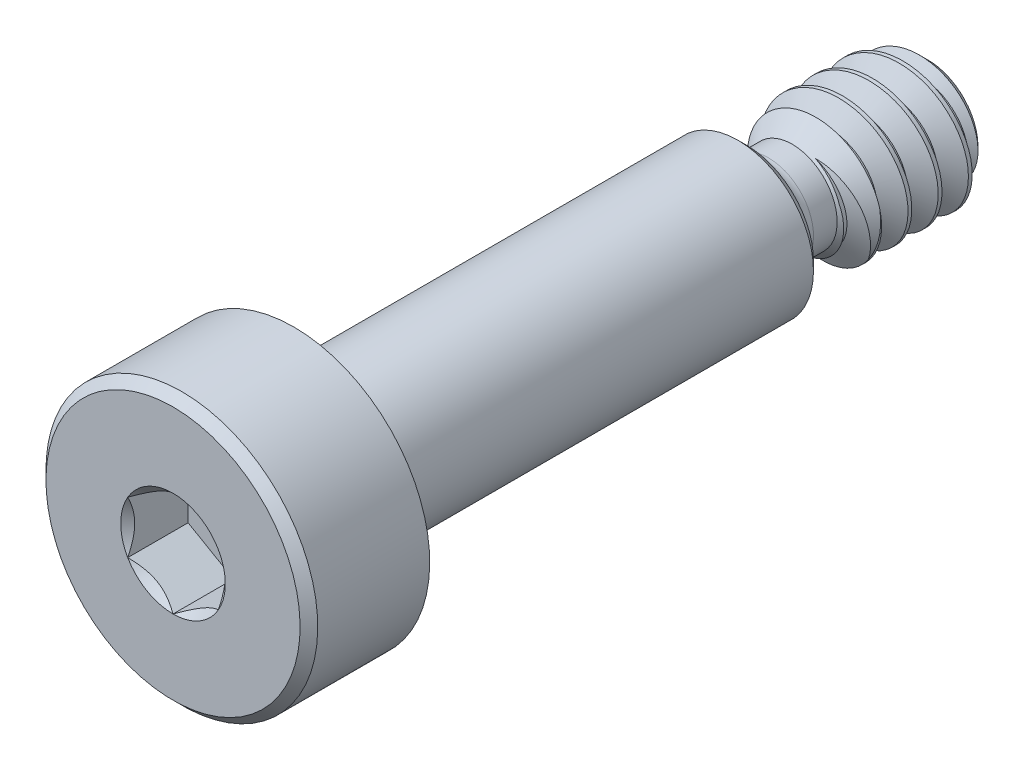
ISO-10303-21;
HEADER;
FILE_DESCRIPTION(('STEP AP214'),'2;1');
FILE_NAME('part.step','',(''),(''),'','','');
FILE_SCHEMA(('AUTOMOTIVE_DESIGN { 1 0 10303 214 1 1 1 1 }'));
ENDSEC;
DATA;
#1=APPLICATION_CONTEXT('core data for automotive mechanical design processes');
#2=APPLICATION_PROTOCOL_DEFINITION('international standard','automotive_design',2000,#1);
#3=PRODUCT_CONTEXT('',#1,'mechanical');
#4=PRODUCT('Part','Part','',(#3));
#5=PRODUCT_RELATED_PRODUCT_CATEGORY('part','',(#4));
#6=PRODUCT_DEFINITION_FORMATION('','',#4);
#7=PRODUCT_DEFINITION_CONTEXT('part definition',#1,'design');
#8=PRODUCT_DEFINITION('design','',#6,#7);
#9=PRODUCT_DEFINITION_SHAPE('','',#8);
#10=(LENGTH_UNIT() NAMED_UNIT(*) SI_UNIT(.MILLI.,.METRE.));
#11=(NAMED_UNIT(*) PLANE_ANGLE_UNIT() SI_UNIT($,.RADIAN.));
#12=(NAMED_UNIT(*) SI_UNIT($,.STERADIAN.) SOLID_ANGLE_UNIT());
#13=UNCERTAINTY_MEASURE_WITH_UNIT(LENGTH_MEASURE(1.E-05),#10,'distance_accuracy_value','');
#14=(GEOMETRIC_REPRESENTATION_CONTEXT(3) GLOBAL_UNCERTAINTY_ASSIGNED_CONTEXT((#13)) GLOBAL_UNIT_ASSIGNED_CONTEXT((#10,
#11,#12)) REPRESENTATION_CONTEXT('',''));
#15=CARTESIAN_POINT('',(0.,0.,0.));
#16=DIRECTION('',(0.,0.,1.));
#17=DIRECTION('',(1.,0.,0.));
#18=AXIS2_PLACEMENT_3D('',#15,#16,#17);
#19=CARTESIAN_POINT('',(0.,0.,-16.27505));
#20=DIRECTION('',(0.,0.,-1.));
#21=DIRECTION('',(0.,1.,0.));
#22=AXIS2_PLACEMENT_3D('',#19,#20,#21);
#23=CONICAL_SURFACE('',#22,1.1811,0.785398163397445);
#24=CARTESIAN_POINT('',(0.,0.,-16.27505));
#25=DIRECTION('',(0.,0.,-1.));
#26=DIRECTION('',(0.,1.,0.));
#27=AXIS2_PLACEMENT_3D('',#24,#25,#26);
#28=CIRCLE('',#27,1.1811);
#29=CARTESIAN_POINT('',(0.,1.1811,-16.27505));
#30=VERTEX_POINT('',#29);
#31=EDGE_CURVE('E380',#30,#30,#28,.T.);
#32=ORIENTED_EDGE('',*,*,#31,.T.);
#33=EDGE_LOOP('',(#32));
#34=FACE_BOUND('',#33,.T.);
#35=CARTESIAN_POINT('',(1.42834607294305,-1.01559551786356,-16.8465500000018));
#36=CARTESIAN_POINT('',(1.44891318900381,-0.972917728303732,-16.8385838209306));
#37=CARTESIAN_POINT('',(1.46764227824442,-0.929411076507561,-16.8305021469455));
#38=CARTESIAN_POINT('',(1.50131954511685,-0.840988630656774,-16.8141375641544));
#39=CARTESIAN_POINT('',(1.51626725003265,-0.796072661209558,-16.8058546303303));
#40=CARTESIAN_POINT('',(1.55534416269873,-0.659354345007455,-16.7807064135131));
#41=CARTESIAN_POINT('',(1.57359482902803,-0.565814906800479,-16.7635850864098));
#42=CARTESIAN_POINT('',(1.58876613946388,-0.424431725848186,-16.7377673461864));
#43=CARTESIAN_POINT('',(1.59178924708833,-0.377126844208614,-16.7291391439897));
#44=CARTESIAN_POINT('',(1.59377896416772,-0.282400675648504,-16.7118857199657));
#45=CARTESIAN_POINT('',(1.59274448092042,-0.234979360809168,-16.7032604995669));
#46=CARTESIAN_POINT('',(1.58659877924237,-0.140471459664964,-16.686074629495));
#47=CARTESIAN_POINT('',(1.58149424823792,-0.0933844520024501,-16.677513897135));
#48=CARTESIAN_POINT('',(1.57088046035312,-0.02318863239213,-16.6648293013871));
#49=CARTESIAN_POINT('',(1.56684987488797,0.000136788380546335,-16.6606273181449));
#50=CARTESIAN_POINT('',(1.55765808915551,0.0465456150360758,-16.6521293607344));
#51=CARTESIAN_POINT('',(1.55249696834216,0.0696290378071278,-16.6478333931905));
#52=CARTESIAN_POINT('',(1.5355212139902,0.137614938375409,-16.6349506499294));
#53=CARTESIAN_POINT('',(1.5220887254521,0.182100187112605,-16.6262196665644));
#54=CARTESIAN_POINT('',(1.49101305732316,0.269485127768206,-16.6084346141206));
#55=CARTESIAN_POINT('',(1.47336893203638,0.312384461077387,-16.5993804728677));
#56=CARTESIAN_POINT('',(1.41428775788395,0.438175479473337,-16.571785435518));
#57=CARTESIAN_POINT('',(1.36668520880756,0.518226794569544,-16.5527993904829));
#58=CARTESIAN_POINT('',(1.28774500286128,0.625583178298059,-16.5250458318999));
#59=CARTESIAN_POINT('',(1.26217231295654,0.657376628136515,-16.5164936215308));
#60=CARTESIAN_POINT('',(1.20838335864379,0.718648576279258,-16.4993191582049));
#61=CARTESIAN_POINT('',(1.1801670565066,0.748127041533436,-16.4906969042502));
#62=CARTESIAN_POINT('',(1.12134761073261,0.804489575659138,-16.4734574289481));
#63=CARTESIAN_POINT('',(1.09074864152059,0.831378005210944,-16.4648402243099));
#64=CARTESIAN_POINT('',(1.04320248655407,0.869661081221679,-16.45195811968));
#65=CARTESIAN_POINT('',(1.02707774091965,0.882081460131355,-16.4476710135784));
#66=CARTESIAN_POINT('',(0.994303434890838,0.906219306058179,-16.4391179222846));
#67=CARTESIAN_POINT('',(0.977653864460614,0.917936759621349,-16.4348519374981));
#68=CARTESIAN_POINT('',(0.945383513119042,0.939628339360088,-16.4267379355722));
#69=CARTESIAN_POINT('',(0.929805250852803,0.949664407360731,-16.4228868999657));
#70=CARTESIAN_POINT('',(0.898215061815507,0.968981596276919,-16.4150811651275));
#71=CARTESIAN_POINT('',(0.882203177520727,0.978262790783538,-16.4111264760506));
#72=CARTESIAN_POINT('',(0.833588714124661,1.00496851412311,-16.3991434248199));
#73=CARTESIAN_POINT('',(0.800389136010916,1.0212674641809,-16.3909915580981));
#74=CARTESIAN_POINT('',(0.732579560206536,1.05074675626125,-16.3743560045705));
#75=CARTESIAN_POINT('',(0.697965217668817,1.06391648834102,-16.3658712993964));
#76=CARTESIAN_POINT('',(0.627675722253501,1.08698385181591,-16.3486264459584));
#77=CARTESIAN_POINT('',(0.591999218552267,1.09687710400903,-16.3398659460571));
#78=CARTESIAN_POINT('',(0.555960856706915,1.1050728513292,-16.3309942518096));
#79=B_SPLINE_CURVE_WITH_KNOTS('',3,(#35,#36,#37,#38,#39,#40,#41,#42,#43,#44,#45,#46,#47,#48,#49,
#50,#51,#52,#53,#54,#55,#56,#57,#58,#59,#60,#61,#62,#63,#64,#65,#66,#67,#68,#69,#70,#71,#72,#73,
#74,#75,#76,#77,#78),.UNSPECIFIED.,.F.,.F.,(4,2,2,2,2,2,2,2,2,2,2,2,2,2,2,2,2,2,2,2,2,4),(0.,
0.14401522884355,0.288048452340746,0.576893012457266,0.721304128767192,0.865754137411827,
1.00996729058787,1.08206926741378,1.15416617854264,1.29576281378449,1.43739127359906,
1.72044195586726,1.84540411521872,1.97036805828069,2.09511778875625,2.15750303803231,
2.2198894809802,2.276653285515,2.33341154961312,2.44686110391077,2.56069000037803,
2.6746704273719),.UNSPECIFIED.);
#80=CARTESIAN_POINT('',(1.4283460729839,-1.01559551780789,-16.8465499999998));
#81=VERTEX_POINT('',#80);
#82=CARTESIAN_POINT('',(0.555960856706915,1.10507285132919,-16.3309942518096));
#83=VERTEX_POINT('',#82);
#84=EDGE_CURVE('E289',#81,#83,#79,.T.);
#85=ORIENTED_EDGE('',*,*,#84,.F.);
#86=CARTESIAN_POINT('',(0.,0.,-16.84655));
#87=DIRECTION('',(0.,0.,-1.));
#88=DIRECTION('',(0.,1.,0.));
#89=AXIS2_PLACEMENT_3D('',#86,#87,#88);
#90=CIRCLE('',#89,1.7526);
#91=CARTESIAN_POINT('',(1.72812767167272,0.291858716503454,-16.8465499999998));
#92=VERTEX_POINT('',#91);
#93=EDGE_CURVE('E135',#81,#92,#90,.F.);
#94=ORIENTED_EDGE('',*,*,#93,.T.);
#95=CARTESIAN_POINT('',(1.17452819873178,0.388280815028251,-16.3309942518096));
#96=CARTESIAN_POINT('',(1.1875611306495,0.356173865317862,-16.3332873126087));
#97=CARTESIAN_POINT('',(1.19922574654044,0.323512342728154,-16.3355636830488));
#98=CARTESIAN_POINT('',(1.21975381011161,0.257329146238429,-16.3400740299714));
#99=CARTESIAN_POINT('',(1.22861816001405,0.223807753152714,-16.3423080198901));
#100=CARTESIAN_POINT('',(1.24347569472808,0.156196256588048,-16.3467219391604));
#101=CARTESIAN_POINT('',(1.2494742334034,0.122107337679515,-16.3489019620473));
#102=CARTESIAN_POINT('',(1.25855259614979,0.0535372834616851,-16.3531678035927));
#103=CARTESIAN_POINT('',(1.26163225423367,0.0190561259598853,-16.3552536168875));
#104=CARTESIAN_POINT('',(1.26497847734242,-0.0500653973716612,-16.3594473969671));
#105=CARTESIAN_POINT('',(1.26524298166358,-0.0847058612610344,-16.3615553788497));
#106=CARTESIAN_POINT('',(1.26300246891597,-0.153886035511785,-16.3658231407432));
#107=CARTESIAN_POINT('',(1.26049741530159,-0.188425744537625,-16.3679829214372));
#108=CARTESIAN_POINT('',(1.24881884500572,-0.29159736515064,-16.3745025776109));
#109=CARTESIAN_POINT('',(1.23548295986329,-0.35980369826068,-16.3789040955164));
#110=CARTESIAN_POINT('',(1.19711683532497,-0.496548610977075,-16.3879235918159));
#111=CARTESIAN_POINT('',(1.17152853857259,-0.564929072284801,-16.3925412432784));
#112=CARTESIAN_POINT('',(1.10919078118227,-0.696436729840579,-16.4016442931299));
#113=CARTESIAN_POINT('',(1.07244400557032,-0.75956518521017,-16.4061297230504));
#114=CARTESIAN_POINT('',(1.00982298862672,-0.848872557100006,-16.4126635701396));
#115=CARTESIAN_POINT('',(0.987701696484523,-0.877741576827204,-16.4148089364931));
#116=CARTESIAN_POINT('',(0.941106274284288,-0.933521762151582,-16.4190266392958));
#117=CARTESIAN_POINT('',(0.916631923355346,-0.960432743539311,-16.4210989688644));
#118=CARTESIAN_POINT('',(0.840079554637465,-1.03810243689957,-16.427415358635));
#119=CARTESIAN_POINT('',(0.784857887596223,-1.085818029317,-16.4317601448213));
#120=CARTESIAN_POINT('',(0.665649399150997,-1.17308840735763,-16.4406555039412));
#121=CARTESIAN_POINT('',(0.601442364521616,-1.21234108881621,-16.445208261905));
#122=CARTESIAN_POINT('',(0.467451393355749,-1.27967883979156,-16.4542774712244));
#123=CARTESIAN_POINT('',(0.397670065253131,-1.30776909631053,-16.4587939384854));
#124=CARTESIAN_POINT('',(0.253172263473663,-1.35242045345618,-16.4677558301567));
#125=CARTESIAN_POINT('',(0.178391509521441,-1.36877474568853,-16.4721986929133));
#126=CARTESIAN_POINT('',(0.027110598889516,-1.38865925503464,-16.480782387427));
#127=CARTESIAN_POINT('',(-0.0493904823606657,-1.39218240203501,-16.484923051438));
#128=CARTESIAN_POINT('',(-0.202775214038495,-1.38692208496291,-16.4934981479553));
#129=CARTESIAN_POINT('',(-0.279653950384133,-1.378004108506,-16.4979352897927));
#130=CARTESIAN_POINT('',(-0.430916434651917,-1.34778338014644,-16.5068473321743));
#131=CARTESIAN_POINT('',(-0.505300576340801,-1.32648259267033,-16.5113222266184));
#132=CARTESIAN_POINT('',(-0.652183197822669,-1.2710971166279,-16.5203749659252));
#133=CARTESIAN_POINT('',(-0.724525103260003,-1.23659195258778,-16.5249509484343));
#134=CARTESIAN_POINT('',(-0.827854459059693,-1.17613158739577,-16.531667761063));
#135=CARTESIAN_POINT('',(-0.861448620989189,-1.15451515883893,-16.5338832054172));
#136=CARTESIAN_POINT('',(-0.926707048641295,-1.10852004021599,-16.5382548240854));
#137=CARTESIAN_POINT('',(-0.958371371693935,-1.08414143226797,-16.5404110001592));
#138=CARTESIAN_POINT('',(-1.01947773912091,-1.03283893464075,-16.5446415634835));
#139=CARTESIAN_POINT('',(-1.04892325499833,-1.00591917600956,-16.5467160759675));
#140=CARTESIAN_POINT('',(-1.10555941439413,-0.94980876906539,-16.5509377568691));
#141=CARTESIAN_POINT('',(-1.13274991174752,-0.920617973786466,-16.5530849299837));
#142=CARTESIAN_POINT('',(-1.18469260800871,-0.860122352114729,-16.5574125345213));
#143=CARTESIAN_POINT('',(-1.20944395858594,-0.828816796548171,-16.5595929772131));
#144=CARTESIAN_POINT('',(-1.25633485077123,-0.764322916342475,-16.5639771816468));
#145=CARTESIAN_POINT('',(-1.27847449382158,-0.731134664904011,-16.5661809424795));
#146=CARTESIAN_POINT('',(-1.3424397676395,-0.626290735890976,-16.5729830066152));
#147=CARTESIAN_POINT('',(-1.37971476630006,-0.551786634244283,-16.5775979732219));
#148=CARTESIAN_POINT('',(-1.44123447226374,-0.397609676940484,-16.5867273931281));
#149=CARTESIAN_POINT('',(-1.4654839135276,-0.317938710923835,-16.5912418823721));
#150=CARTESIAN_POINT('',(-1.49165926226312,-0.196136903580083,-16.5978717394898));
#151=CARTESIAN_POINT('',(-1.49868921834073,-0.155049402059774,-16.6000632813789));
#152=CARTESIAN_POINT('',(-1.50924258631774,-0.0724118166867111,-16.6043566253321));
#153=CARTESIAN_POINT('',(-1.51276585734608,-0.0308617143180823,-16.6064584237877));
#154=CARTESIAN_POINT('',(-1.5163890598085,0.0524042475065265,-16.6106730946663));
#155=CARTESIAN_POINT('',(-1.51648731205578,0.0941201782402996,-16.6127859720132));
#156=CARTESIAN_POINT('',(-1.51332602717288,0.177412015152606,-16.6170704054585));
#157=CARTESIAN_POINT('',(-1.51006640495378,0.218987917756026,-16.6192419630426));
#158=CARTESIAN_POINT('',(-1.49503208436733,0.344854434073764,-16.6258910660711));
#159=CARTESIAN_POINT('',(-1.4779262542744,0.428573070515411,-16.6304167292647));
#160=CARTESIAN_POINT('',(-1.43018819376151,0.59196290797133,-16.639466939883));
#161=CARTESIAN_POINT('',(-1.3995611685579,0.671635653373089,-16.6439914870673));
#162=CARTESIAN_POINT('',(-1.32478947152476,0.826522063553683,-16.6530177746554));
#163=CARTESIAN_POINT('',(-1.2803736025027,0.901606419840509,-16.6575170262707));
#164=CARTESIAN_POINT('',(-1.20481104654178,1.00778712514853,-16.6640811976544));
#165=CARTESIAN_POINT('',(-1.17811476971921,1.04212531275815,-16.666239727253));
#166=CARTESIAN_POINT('',(-1.12192138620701,1.10843512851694,-16.6704817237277));
#167=CARTESIAN_POINT('',(-1.09242404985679,1.1404065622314,-16.6725651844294));
#168=CARTESIAN_POINT('',(-0.999946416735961,1.23282893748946,-16.6789339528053));
#169=CARTESIAN_POINT('',(-0.933156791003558,1.2895433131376,-16.6833240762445));
#170=CARTESIAN_POINT('',(-0.791284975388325,1.39133942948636,-16.6921818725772));
#171=CARTESIAN_POINT('',(-0.716202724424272,1.43642108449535,-16.6966495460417));
#172=CARTESIAN_POINT('',(-0.556885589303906,1.51520247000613,-16.7057217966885));
#173=CARTESIAN_POINT('',(-0.47241867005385,1.54843462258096,-16.7103255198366));
#174=CARTESIAN_POINT('',(-0.299099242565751,1.60023087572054,-16.7193848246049));
#175=CARTESIAN_POINT('',(-0.210247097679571,1.61879618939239,-16.7238404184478));
#176=CARTESIAN_POINT('',(-0.0307913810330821,1.6406915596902,-16.73244755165));
#177=CARTESIAN_POINT('',(0.0598101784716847,1.64403818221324,-16.736599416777));
#178=CARTESIAN_POINT('',(0.240377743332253,1.63611457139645,-16.7451607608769));
#179=CARTESIAN_POINT('',(0.33034346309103,1.62483814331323,-16.7495703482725));
#180=CARTESIAN_POINT('',(0.509975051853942,1.58730613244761,-16.7585703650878));
#181=CARTESIAN_POINT('',(0.599547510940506,1.56060276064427,-16.7631621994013));
#182=CARTESIAN_POINT('',(0.772995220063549,1.49263163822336,-16.7722912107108));
#183=CARTESIAN_POINT('',(0.856872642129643,1.45136947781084,-16.7768284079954));
#184=CARTESIAN_POINT('',(0.976935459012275,1.37928520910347,-16.783512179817));
#185=CARTESIAN_POINT('',(1.01616851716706,1.35341226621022,-16.7857299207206));
#186=CARTESIAN_POINT('',(1.09232865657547,1.29844475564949,-16.7901054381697));
#187=CARTESIAN_POINT('',(1.12925575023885,1.26935020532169,-16.792263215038));
#188=CARTESIAN_POINT('',(1.20054553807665,1.20813723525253,-16.7965069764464));
#189=CARTESIAN_POINT('',(1.23490674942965,1.17601709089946,-16.7985929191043));
#190=CARTESIAN_POINT('',(1.30091928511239,1.10910916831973,-16.8028412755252));
#191=CARTESIAN_POINT('',(1.33257049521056,1.0743212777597,-16.8050036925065));
#192=CARTESIAN_POINT('',(1.39337542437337,1.00175696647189,-16.8093932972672));
#193=CARTESIAN_POINT('',(1.42248621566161,0.963944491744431,-16.8116209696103));
#194=CARTESIAN_POINT('',(1.47748671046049,0.886064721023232,-16.8161012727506));
#195=CARTESIAN_POINT('',(1.50337624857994,0.845997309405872,-16.8183539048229));
#196=CARTESIAN_POINT('',(1.57588642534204,0.722872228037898,-16.8251191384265));
#197=CARTESIAN_POINT('',(1.61747564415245,0.636739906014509,-16.8296482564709));
#198=CARTESIAN_POINT('',(1.66770721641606,0.50624450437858,-16.8362275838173));
#199=CARTESIAN_POINT('',(1.68211625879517,0.46399481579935,-16.8383167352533));
#200=CARTESIAN_POINT('',(1.70761260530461,0.378578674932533,-16.8424605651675));
#201=CARTESIAN_POINT('',(1.71870532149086,0.335413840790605,-16.844515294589));
#202=CARTESIAN_POINT('',(1.72812767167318,0.291858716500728,-16.84655));
#203=B_SPLINE_CURVE_WITH_KNOTS('',3,(#95,#96,#97,#98,#99,#100,#101,#102,#103,#104,#105,#106,
#107,#108,#109,#110,#111,#112,#113,#114,#115,#116,#117,#118,#119,#120,#121,#122,#123,#124,#125,
#126,#127,#128,#129,#130,#131,#132,#133,#134,#135,#136,#137,#138,#139,#140,#141,#142,#143,#144,
#145,#146,#147,#148,#149,#150,#151,#152,#153,#154,#155,#156,#157,#158,#159,#160,#161,#162,#163,
#164,#165,#166,#167,#168,#169,#170,#171,#172,#173,#174,#175,#176,#177,#178,#179,#180,#181,#182,
#183,#184,#185,#186,#187,#188,#189,#190,#191,#192,#193,#194,#195,#196,#197,#198,#199,#200,#201,
#202),.UNSPECIFIED.,.F.,.F.,(4,2,2,2,2,2,2,2,2,2,2,2,2,2,2,2,2,2,2,2,2,2,2,2,2,2,2,2,2,2,2,2,2,
2,2,2,2,2,2,2,2,2,2,2,2,2,2,2,2,2,2,2,2,4),(0.,0.10414723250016,0.208260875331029,
0.312179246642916,0.416103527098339,0.52010387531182,0.624105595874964,0.832043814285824,
1.05051310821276,1.26892987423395,1.37811696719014,1.48731431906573,1.70563563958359,
1.93078893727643,2.15583748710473,2.38476041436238,2.61380946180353,2.84535425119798,
3.07686231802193,3.31645538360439,3.4363677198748,3.55627649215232,3.67599358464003,
3.79571843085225,3.9154847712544,4.0352464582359,4.28429890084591,4.53326076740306,
4.65836118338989,4.78346662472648,4.90863340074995,5.03380334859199,5.28922659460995,
5.54455159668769,5.80525581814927,5.93576681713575,6.06628852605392,6.32822680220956,
6.59016700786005,6.86152636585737,7.13286327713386,7.40390476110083,7.67506110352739,
7.95451455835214,8.23386082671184,8.37486888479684,8.51587618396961,8.65696435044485,
8.79805846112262,8.94120089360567,9.08435067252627,9.37006259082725,9.50402180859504,
9.63776120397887),.UNSPECIFIED.);
#204=CARTESIAN_POINT('',(1.17452819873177,0.388280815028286,-16.3309942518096));
#205=VERTEX_POINT('',#204);
#206=EDGE_CURVE('E280',#205,#92,#203,.T.);
#207=ORIENTED_EDGE('',*,*,#206,.F.);
#208=CARTESIAN_POINT('',(0.555960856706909,1.10507285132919,-16.3309942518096));
#209=CARTESIAN_POINT('',(0.585621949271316,1.09015009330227,-16.3309942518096));
#210=CARTESIAN_POINT('',(0.614669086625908,1.07403945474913,-16.3309942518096));
#211=CARTESIAN_POINT('',(0.671413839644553,1.03951315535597,-16.3309942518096));
#212=CARTESIAN_POINT('',(0.699109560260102,1.0210943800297,-16.3309942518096));
#213=CARTESIAN_POINT('',(0.780485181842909,0.962100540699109,-16.3309942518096));
#214=CARTESIAN_POINT('',(0.831763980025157,0.918134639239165,-16.3309942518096));
#215=CARTESIAN_POINT('',(0.926530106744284,0.8224158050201,-16.3309942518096));
#216=CARTESIAN_POINT('',(0.970008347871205,0.77065391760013,-16.3309942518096));
#217=CARTESIAN_POINT('',(1.04450445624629,0.665622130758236,-16.3309942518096));
#218=CARTESIAN_POINT('',(1.07628469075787,0.612891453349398,-16.3309942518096));
#219=CARTESIAN_POINT('',(1.13168006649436,0.503354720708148,-16.3309942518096));
#220=CARTESIAN_POINT('',(1.15530138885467,0.44655179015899,-16.3309942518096));
#221=CARTESIAN_POINT('',(1.17452819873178,0.388280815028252,-16.3309942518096));
#222=B_SPLINE_CURVE_WITH_KNOTS('',3,(#208,#209,#210,#211,#212,#213,#214,#215,#216,#217,#218,
#219,#220,#221),.UNSPECIFIED.,.F.,.F.,(4,2,2,2,2,2,4),(0.,0.0995544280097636,0.199244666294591,
0.400913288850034,0.602815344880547,0.786842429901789,0.970729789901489),.UNSPECIFIED.);
#223=EDGE_CURVE('E294',#83,#205,#222,.T.);
#224=ORIENTED_EDGE('',*,*,#223,.F.);
#225=EDGE_LOOP('',(#85,#94,#207,#224));
#226=FACE_BOUND('',#225,.T.);
#227=ADVANCED_FACE('F39',(#34,#226),#23,.T.);
#228=CARTESIAN_POINT('',(0.,-1.7526,-19.84375));
#229=DIRECTION('',(0.,0.,-1.));
#230=DIRECTION('',(0.,1.,0.));
#231=AXIS2_PLACEMENT_3D('',#228,#229,#230);
#232=PLANE('',#231);
#233=CARTESIAN_POINT('',(0.,0.,-19.84375));
#234=DIRECTION('',(0.,0.,-1.));
#235=DIRECTION('',(0.,1.,0.));
#236=AXIS2_PLACEMENT_3D('',#233,#234,#235);
#237=CIRCLE('',#236,1.31445000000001);
#238=CARTESIAN_POINT('',(-1.19443132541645,-0.548737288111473,-19.84375));
#239=VERTEX_POINT('',#238);
#240=CARTESIAN_POINT('',(0.456574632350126,-1.23260634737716,-19.84375));
#241=VERTEX_POINT('',#240);
#242=EDGE_CURVE('E151',#239,#241,#237,.T.);
#243=ORIENTED_EDGE('',*,*,#242,.T.);
#244=CARTESIAN_POINT('',(1.33022340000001,-0.650716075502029,-19.84375));
#245=CARTESIAN_POINT('',(1.30662715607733,-0.684838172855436,-19.84375));
#246=CARTESIAN_POINT('',(1.28158841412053,-0.717957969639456,-19.84375));
#247=CARTESIAN_POINT('',(1.22880289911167,-0.781994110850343,-19.84375));
#248=CARTESIAN_POINT('',(1.20105469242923,-0.812909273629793,-19.84375));
#249=CARTESIAN_POINT('',(1.1429751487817,-0.872379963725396,-19.84375));
#250=CARTESIAN_POINT('',(1.11263710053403,-0.900928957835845,-19.84375));
#251=CARTESIAN_POINT('',(1.06540930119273,-0.941742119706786,-19.84375));
#252=CARTESIAN_POINT('',(1.04937854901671,-0.95501244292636,-19.84375));
#253=CARTESIAN_POINT('',(1.01678482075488,-0.98088192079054,-19.84375));
#254=CARTESIAN_POINT('',(1.0002218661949,-0.993481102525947,-19.84375));
#255=CARTESIAN_POINT('',(0.949626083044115,-1.03012494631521,-19.84375));
#256=CARTESIAN_POINT('',(0.914721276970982,-1.05298522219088,-19.84375));
#257=CARTESIAN_POINT('',(0.842909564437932,-1.0952661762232,-19.84375));
#258=CARTESIAN_POINT('',(0.806003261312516,-1.11468788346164,-19.84375));
#259=CARTESIAN_POINT('',(0.730583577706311,-1.14989627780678,-19.84375));
#260=CARTESIAN_POINT('',(0.692073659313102,-1.16569036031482,-19.84375));
#261=CARTESIAN_POINT('',(0.6136893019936,-1.19355441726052,-19.84375));
#262=CARTESIAN_POINT('',(0.573813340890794,-1.20562007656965,-19.84375));
#263=CARTESIAN_POINT('',(0.461943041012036,-1.23370030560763,-19.84375));
#264=CARTESIAN_POINT('',(0.388874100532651,-1.24559476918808,-19.84375));
#265=CARTESIAN_POINT('',(0.241804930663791,-1.25684604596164,-19.84375));
#266=CARTESIAN_POINT('',(0.167805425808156,-1.25621207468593,-19.84375));
#267=CARTESIAN_POINT('',(0.0786623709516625,-1.24788713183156,-19.84375));
#268=CARTESIAN_POINT('',(0.0628603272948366,-1.2461185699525,-19.84375));
#269=CARTESIAN_POINT('',(0.0313580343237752,-1.24200911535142,-19.84375));
#270=CARTESIAN_POINT('',(0.0156576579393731,-1.23966919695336,-19.84375));
#271=CARTESIAN_POINT('',(0.,-1.23704425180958,-19.84375));
#272=B_SPLINE_CURVE_WITH_KNOTS('',3,(#244,#245,#246,#247,#248,#249,#250,#251,#252,#253,#254,
#255,#256,#257,#258,#259,#260,#261,#262,#263,#264,#265,#266,#267,#268,#269,#270,#271),
.UNSPECIFIED.,.F.,.F.,(4,2,2,2,2,2,2,2,2,2,2,2,2,4),(0.,0.124414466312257,0.248895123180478,
0.373708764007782,0.436125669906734,0.498540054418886,0.623507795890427,0.748438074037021,
0.873111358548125,0.997928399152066,1.21891457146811,1.43973819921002,1.48743480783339,
1.53505064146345),.UNSPECIFIED.);
#273=CARTESIAN_POINT('',(0.,-1.23704425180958,-19.84375));
#274=VERTEX_POINT('',#273);
#275=EDGE_CURVE('E144',#241,#274,#272,.T.);
#276=ORIENTED_EDGE('',*,*,#275,.T.);
#277=CARTESIAN_POINT('',(0.,-1.23704425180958,-19.84375));
#278=CARTESIAN_POINT('',(-0.0332034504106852,-1.23704398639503,-19.84375));
#279=CARTESIAN_POINT('',(-0.0663923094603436,-1.23570663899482,-19.84375));
#280=CARTESIAN_POINT('',(-0.132600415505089,-1.23036631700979,-19.84375));
#281=CARTESIAN_POINT('',(-0.165619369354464,-1.22635970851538,-19.84375));
#282=CARTESIAN_POINT('',(-0.264827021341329,-1.2102318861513,-19.84375));
#283=CARTESIAN_POINT('',(-0.330394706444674,-1.19400245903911,-19.84375));
#284=CARTESIAN_POINT('',(-0.458069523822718,-1.15108562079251,-19.84375));
#285=CARTESIAN_POINT('',(-0.520172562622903,-1.12438612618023,-19.84375));
#286=CARTESIAN_POINT('',(-0.633925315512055,-1.06403997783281,-19.84375));
#287=CARTESIAN_POINT('',(-0.686013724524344,-1.03121764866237,-19.84375));
#288=CARTESIAN_POINT('',(-0.784728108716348,-0.958262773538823,-19.84375));
#289=CARTESIAN_POINT('',(-0.831358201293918,-0.918135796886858,-19.84375));
#290=CARTESIAN_POINT('',(-0.874722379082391,-0.874722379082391,-19.84375));
#291=B_SPLINE_CURVE_WITH_KNOTS('',3,(#277,#278,#279,#280,#281,#282,#283,#284,#285,#286,#287,
#288,#289,#290),.UNSPECIFIED.,.F.,.F.,(4,2,2,2,2,2,4),(0.,0.0995544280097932,0.19924466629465,
0.400913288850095,0.602815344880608,0.786842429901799,0.970729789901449),.UNSPECIFIED.);
#292=CARTESIAN_POINT('',(-0.874722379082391,-0.874722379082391,-19.84375));
#293=VERTEX_POINT('',#292);
#294=EDGE_CURVE('E11',#274,#293,#291,.T.);
#295=ORIENTED_EDGE('',*,*,#294,.T.);
#296=CARTESIAN_POINT('',(-0.874722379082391,-0.874722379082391,-19.84375));
#297=CARTESIAN_POINT('',(-0.904956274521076,-0.853171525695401,-19.84375));
#298=CARTESIAN_POINT('',(-0.934255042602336,-0.83034412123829,-19.84375));
#299=CARTESIAN_POINT('',(-0.990807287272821,-0.78227409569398,-19.84375));
#300=CARTESIAN_POINT('',(-1.01806043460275,-0.757031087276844,-19.84375));
#301=CARTESIAN_POINT('',(-1.09519280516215,-0.67919019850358,-19.84375));
#302=CARTESIAN_POINT('',(-1.14194285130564,-0.623406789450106,-19.84375));
#303=CARTESIAN_POINT('',(-1.21310884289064,-0.522488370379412,-19.84375));
#304=CARTESIAN_POINT('',(-1.2400396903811,-0.479088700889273,-19.84375));
#305=CARTESIAN_POINT('',(-1.28907083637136,-0.388685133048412,-19.84375));
#306=CARTESIAN_POINT('',(-1.31108149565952,-0.341632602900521,-19.84375));
#307=CARTESIAN_POINT('',(-1.33022339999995,-0.293407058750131,-19.84375));
#308=B_SPLINE_CURVE_WITH_KNOTS('',3,(#296,#297,#298,#299,#300,#301,#302,#303,#304,#305,#306,
#307),.UNSPECIFIED.,.F.,.F.,(4,2,2,2,2,4),(0.,0.111310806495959,0.222639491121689,
0.439837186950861,0.592746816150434,0.748248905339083),.UNSPECIFIED.);
#309=EDGE_CURVE('E331',#293,#239,#308,.T.);
#310=ORIENTED_EDGE('',*,*,#309,.T.);
#311=EDGE_LOOP('',(#243,#276,#295,#310));
#312=FACE_BOUND('',#311,.T.);
#313=ADVANCED_FACE('F263',(#312),#232,.T.);
#314=CARTESIAN_POINT('',(0.,0.,-19.84375));
#315=DIRECTION('',(0.,0.,-1.));
#316=DIRECTION('',(0.,1.,0.));
#317=AXIS2_PLACEMENT_3D('',#314,#315,#316);
#318=CYLINDRICAL_SURFACE('',#317,1.7526);
#319=CARTESIAN_POINT('',(0.,1.7526,-19.84375));
#320=CARTESIAN_POINT('',(-0.725950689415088,1.7526,-19.794140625));
#321=CARTESIAN_POINT('',(-1.23927534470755,1.23927534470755,-19.74453125));
#322=CARTESIAN_POINT('',(-1.7526,0.725950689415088,-19.694921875));
#323=CARTESIAN_POINT('',(-1.7526,0.,-19.6453125));
#324=CARTESIAN_POINT('',(-1.7526,-0.725950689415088,-19.595703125));
#325=CARTESIAN_POINT('',(-1.23927534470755,-1.23927534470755,-19.54609375));
#326=CARTESIAN_POINT('',(-0.725950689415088,-1.7526,-19.496484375));
#327=CARTESIAN_POINT('',(0.,-1.7526,-19.446875));
#328=CARTESIAN_POINT('',(0.725950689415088,-1.7526,-19.397265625));
#329=CARTESIAN_POINT('',(1.23927534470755,-1.23927534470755,-19.34765625));
#330=CARTESIAN_POINT('',(1.7526,-0.725950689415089,-19.298046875));
#331=CARTESIAN_POINT('',(1.7526,0.,-19.2484375));
#332=CARTESIAN_POINT('',(1.7526,0.725950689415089,-19.198828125));
#333=CARTESIAN_POINT('',(1.23927534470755,1.23927534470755,-19.14921875));
#334=CARTESIAN_POINT('',(0.725950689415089,1.7526,-19.099609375));
#335=CARTESIAN_POINT('',(0.,1.7526,-19.05));
#336=CARTESIAN_POINT('',(-0.725950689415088,1.7526,-19.000390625));
#337=CARTESIAN_POINT('',(-1.23927534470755,1.23927534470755,-18.95078125));
#338=CARTESIAN_POINT('',(-1.7526,0.725950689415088,-18.901171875));
#339=CARTESIAN_POINT('',(-1.7526,0.,-18.8515625));
#340=CARTESIAN_POINT('',(-1.7526,-0.725950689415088,-18.801953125));
#341=CARTESIAN_POINT('',(-1.23927534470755,-1.23927534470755,-18.75234375));
#342=CARTESIAN_POINT('',(-0.725950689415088,-1.7526,-18.702734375));
#343=CARTESIAN_POINT('',(0.,-1.7526,-18.653125));
#344=CARTESIAN_POINT('',(0.725950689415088,-1.7526,-18.603515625));
#345=CARTESIAN_POINT('',(1.23927534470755,-1.23927534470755,-18.55390625));
#346=CARTESIAN_POINT('',(1.7526,-0.725950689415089,-18.504296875));
#347=CARTESIAN_POINT('',(1.7526,0.,-18.4546875));
#348=CARTESIAN_POINT('',(1.7526,0.725950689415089,-18.405078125));
#349=CARTESIAN_POINT('',(1.23927534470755,1.23927534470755,-18.35546875));
#350=CARTESIAN_POINT('',(0.725950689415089,1.7526,-18.305859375));
#351=CARTESIAN_POINT('',(0.,1.7526,-18.25625));
#352=CARTESIAN_POINT('',(-0.725950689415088,1.7526,-18.206640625));
#353=CARTESIAN_POINT('',(-1.23927534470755,1.23927534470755,-18.15703125));
#354=CARTESIAN_POINT('',(-1.7526,0.725950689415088,-18.107421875));
#355=CARTESIAN_POINT('',(-1.7526,0.,-18.0578125));
#356=CARTESIAN_POINT('',(-1.7526,-0.725950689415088,-18.008203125));
#357=CARTESIAN_POINT('',(-1.23927534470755,-1.23927534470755,-17.95859375));
#358=CARTESIAN_POINT('',(-0.725950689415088,-1.7526,-17.908984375));
#359=CARTESIAN_POINT('',(0.,-1.7526,-17.859375));
#360=CARTESIAN_POINT('',(0.725950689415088,-1.7526,-17.809765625));
#361=CARTESIAN_POINT('',(1.23927534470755,-1.23927534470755,-17.76015625));
#362=CARTESIAN_POINT('',(1.7526,-0.725950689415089,-17.710546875));
#363=CARTESIAN_POINT('',(1.7526,0.,-17.6609375));
#364=CARTESIAN_POINT('',(1.7526,0.725950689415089,-17.611328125));
#365=CARTESIAN_POINT('',(1.23927534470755,1.23927534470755,-17.56171875));
#366=CARTESIAN_POINT('',(0.725950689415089,1.7526,-17.512109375));
#367=CARTESIAN_POINT('',(0.,1.7526,-17.4625));
#368=CARTESIAN_POINT('',(-0.725950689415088,1.7526,-17.412890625));
#369=CARTESIAN_POINT('',(-1.23927534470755,1.23927534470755,-17.36328125));
#370=CARTESIAN_POINT('',(-1.7526,0.725950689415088,-17.313671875));
#371=CARTESIAN_POINT('',(-1.7526,0.,-17.2640625));
#372=CARTESIAN_POINT('',(-1.7526,-0.725950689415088,-17.214453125));
#373=CARTESIAN_POINT('',(-1.23927534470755,-1.23927534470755,-17.16484375));
#374=CARTESIAN_POINT('',(-0.725950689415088,-1.7526,-17.115234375));
#375=CARTESIAN_POINT('',(0.,-1.7526,-17.065625));
#376=CARTESIAN_POINT('',(0.725950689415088,-1.7526,-17.016015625));
#377=CARTESIAN_POINT('',(1.23927534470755,-1.23927534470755,-16.96640625));
#378=CARTESIAN_POINT('',(1.7526,-0.725950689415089,-16.916796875));
#379=CARTESIAN_POINT('',(1.7526,0.,-16.8671875));
#380=CARTESIAN_POINT('',(1.7526,0.725950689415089,-16.817578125));
#381=CARTESIAN_POINT('',(1.23927534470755,1.23927534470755,-16.76796875));
#382=CARTESIAN_POINT('',(0.725950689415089,1.7526,-16.718359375));
#383=CARTESIAN_POINT('',(0.,1.7526,-16.66875));
#384=CARTESIAN_POINT('',(-0.725950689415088,1.7526,-16.619140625));
#385=CARTESIAN_POINT('',(-1.23927534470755,1.23927534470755,-16.56953125));
#386=CARTESIAN_POINT('',(-1.7526,0.725950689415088,-16.519921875));
#387=CARTESIAN_POINT('',(-1.7526,0.,-16.4703125));
#388=CARTESIAN_POINT('',(-1.7526,-0.725950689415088,-16.420703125));
#389=CARTESIAN_POINT('',(-1.23927534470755,-1.23927534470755,-16.37109375));
#390=CARTESIAN_POINT('',(-0.725950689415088,-1.7526,-16.321484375));
#391=CARTESIAN_POINT('',(0.,-1.7526,-16.271875));
#392=CARTESIAN_POINT('',(0.725950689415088,-1.7526,-16.222265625));
#393=CARTESIAN_POINT('',(1.23927534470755,-1.23927534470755,-16.17265625));
#394=CARTESIAN_POINT('',(1.7526,-0.725950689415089,-16.123046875));
#395=CARTESIAN_POINT('',(1.7526,0.,-16.0734375));
#396=CARTESIAN_POINT('',(1.7526,0.725950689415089,-16.023828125));
#397=CARTESIAN_POINT('',(1.23927534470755,1.23927534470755,-15.97421875));
#398=CARTESIAN_POINT('',(0.725950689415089,1.7526,-15.924609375));
#399=CARTESIAN_POINT('',(0.,1.7526,-15.875));
#400=CARTESIAN_POINT('',(-0.725950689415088,1.7526,-15.825390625));
#401=CARTESIAN_POINT('',(-1.23927534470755,1.23927534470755,-15.77578125));
#402=CARTESIAN_POINT('',(-1.7526,0.725950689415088,-15.726171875));
#403=CARTESIAN_POINT('',(-1.7526,0.,-15.6765625));
#404=CARTESIAN_POINT('',(-1.7526,-0.725950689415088,-15.626953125));
#405=CARTESIAN_POINT('',(-1.23927534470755,-1.23927534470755,-15.57734375));
#406=CARTESIAN_POINT('',(-0.725950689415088,-1.7526,-15.527734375));
#407=CARTESIAN_POINT('',(0.,-1.7526,-15.478125));
#408=CARTESIAN_POINT('',(0.725950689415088,-1.7526,-15.428515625));
#409=CARTESIAN_POINT('',(1.23927534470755,-1.23927534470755,-15.37890625));
#410=CARTESIAN_POINT('',(1.7526,-0.725950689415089,-15.329296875));
#411=CARTESIAN_POINT('',(1.7526,0.,-15.2796875));
#412=CARTESIAN_POINT('',(1.7526,0.725950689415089,-15.230078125));
#413=CARTESIAN_POINT('',(1.23927534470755,1.23927534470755,-15.18046875));
#414=CARTESIAN_POINT('',(0.725950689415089,1.7526,-15.130859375));
#415=CARTESIAN_POINT('',(0.,1.7526,-15.08125));
#416=CARTESIAN_POINT('',(-0.725950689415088,1.7526,-15.031640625));
#417=CARTESIAN_POINT('',(-1.23927534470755,1.23927534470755,-14.98203125));
#418=CARTESIAN_POINT('',(-1.7526,0.725950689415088,-14.932421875));
#419=CARTESIAN_POINT('',(-1.7526,0.,-14.8828125));
#420=CARTESIAN_POINT('',(-1.7526,-0.725950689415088,-14.833203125));
#421=CARTESIAN_POINT('',(-1.23927534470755,-1.23927534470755,-14.78359375));
#422=CARTESIAN_POINT('',(-0.725950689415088,-1.7526,-14.733984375));
#423=CARTESIAN_POINT('',(0.,-1.7526,-14.684375));
#424=CARTESIAN_POINT('',(0.725950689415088,-1.7526,-14.634765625));
#425=CARTESIAN_POINT('',(1.23927534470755,-1.23927534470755,-14.58515625));
#426=CARTESIAN_POINT('',(1.7526,-0.725950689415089,-14.535546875));
#427=CARTESIAN_POINT('',(1.7526,0.,-14.4859375));
#428=CARTESIAN_POINT('',(1.7526,0.725950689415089,-14.436328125));
#429=CARTESIAN_POINT('',(1.23927534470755,1.23927534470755,-14.38671875));
#430=CARTESIAN_POINT('',(0.725950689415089,1.7526,-14.337109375));
#431=CARTESIAN_POINT('',(0.,1.7526,-14.2875));
#432=(BOUNDED_CURVE() B_SPLINE_CURVE(2,(#319,#320,#321,#322,#323,#324,#325,#326,#327,#328,#329,
#330,#331,#332,#333,#334,#335,#336,#337,#338,#339,#340,#341,#342,#343,#344,#345,#346,#347,#348,
#349,#350,#351,#352,#353,#354,#355,#356,#357,#358,#359,#360,#361,#362,#363,#364,#365,#366,#367,
#368,#369,#370,#371,#372,#373,#374,#375,#376,#377,#378,#379,#380,#381,#382,#383,#384,#385,#386,
#387,#388,#389,#390,#391,#392,#393,#394,#395,#396,#397,#398,#399,#400,#401,#402,#403,#404,#405,
#406,#407,#408,#409,#410,#411,#412,#413,#414,#415,#416,#417,#418,#419,#420,#421,#422,#423,#424,
#425,#426,#427,#428,#429,#430,#431),.UNSPECIFIED.,.F.,.F.) B_SPLINE_CURVE_WITH_KNOTS((3,2,2,2,2,
2,2,2,2,2,2,2,2,2,2,2,2,2,2,2,2,2,2,2,2,2,2,2,2,2,2,2,2,2,2,2,2,2,2,2,2,2,2,2,2,2,2,2,2,2,2,2,2,
2,2,2,3),(0.,0.0178571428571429,0.0357142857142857,0.0535714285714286,0.0714285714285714,
0.0892857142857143,0.107142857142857,0.125,0.142857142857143,0.160714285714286,
0.178571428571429,0.196428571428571,0.214285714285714,0.232142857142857,0.25,0.267857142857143,
0.285714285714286,0.303571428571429,0.321428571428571,0.339285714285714,0.357142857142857,0.375,
0.392857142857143,0.410714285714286,0.428571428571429,0.446428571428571,0.464285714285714,
0.482142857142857,0.5,0.517857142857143,0.535714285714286,0.553571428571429,0.571428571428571,
0.589285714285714,0.607142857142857,0.625,0.642857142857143,0.660714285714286,0.678571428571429,
0.696428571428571,0.714285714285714,0.732142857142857,0.75,0.767857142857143,0.785714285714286,
0.803571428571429,0.821428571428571,0.839285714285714,0.857142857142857,0.875,0.892857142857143,
0.910714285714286,0.928571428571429,0.946428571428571,0.964285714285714,0.982142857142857,1.),
.UNSPECIFIED.) CURVE() GEOMETRIC_REPRESENTATION_ITEM() RATIONAL_B_SPLINE_CURVE((1.,
0.923879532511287,1.,0.923879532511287,1.,0.923879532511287,1.,0.923879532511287,1.,
0.923879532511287,1.,0.923879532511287,1.,0.923879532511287,1.,0.923879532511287,1.,
0.923879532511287,1.,0.923879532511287,1.,0.923879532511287,1.,0.923879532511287,1.,
0.923879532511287,1.,0.923879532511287,1.,0.923879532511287,1.,0.923879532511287,1.,
0.923879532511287,1.,0.923879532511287,1.,0.923879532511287,1.,0.923879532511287,1.,
0.923879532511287,1.,0.923879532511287,1.,0.923879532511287,1.,0.923879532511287,1.,
0.923879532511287,1.,0.923879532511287,1.,0.923879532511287,1.,0.923879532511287,1.,
0.923879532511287,1.,0.923879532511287,1.,0.923879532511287,1.,0.923879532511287,1.,
0.923879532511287,1.,0.923879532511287,1.,0.923879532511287,1.,0.923879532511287,1.,
0.923879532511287,1.,0.923879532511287,1.,0.923879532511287,1.,0.923879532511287,1.,
0.923879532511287,1.,0.923879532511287,1.,0.923879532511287,1.,0.923879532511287,1.,
0.923879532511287,1.,0.923879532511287,1.,0.923879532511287,1.,0.923879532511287,1.,
0.923879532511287,1.,0.923879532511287,1.,0.923879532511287,1.,0.923879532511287,1.,
0.923879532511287,1.,0.923879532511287,1.,0.923879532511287,1.,0.923879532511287,1.)) REPRESENTATION_ITEM(''));
#433=CARTESIAN_POINT('',(0.565204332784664,-1.65896076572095,-19.4056));
#434=VERTEX_POINT('',#433);
#435=EDGE_CURVE('E60',#434,#92,#432,.T.);
#436=ORIENTED_EDGE('',*,*,#435,.T.);
#437=ORIENTED_EDGE('',*,*,#93,.F.);
#438=CARTESIAN_POINT('',(0.,1.7526,-20.53828125));
#439=CARTESIAN_POINT('',(-0.725950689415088,1.7526,-20.488671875));
#440=CARTESIAN_POINT('',(-1.23927534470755,1.23927534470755,-20.4390625));
#441=CARTESIAN_POINT('',(-1.7526,0.725950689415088,-20.389453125));
#442=CARTESIAN_POINT('',(-1.7526,0.,-20.33984375));
#443=CARTESIAN_POINT('',(-1.7526,-0.725950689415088,-20.290234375));
#444=CARTESIAN_POINT('',(-1.23927534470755,-1.23927534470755,-20.240625));
#445=CARTESIAN_POINT('',(-0.725950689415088,-1.7526,-20.191015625));
#446=CARTESIAN_POINT('',(0.,-1.7526,-20.14140625));
#447=CARTESIAN_POINT('',(0.725950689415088,-1.7526,-20.091796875));
#448=CARTESIAN_POINT('',(1.23927534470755,-1.23927534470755,-20.0421875));
#449=CARTESIAN_POINT('',(1.7526,-0.725950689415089,-19.992578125));
#450=CARTESIAN_POINT('',(1.7526,0.,-19.94296875));
#451=CARTESIAN_POINT('',(1.7526,0.725950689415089,-19.893359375));
#452=CARTESIAN_POINT('',(1.23927534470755,1.23927534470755,-19.84375));
#453=CARTESIAN_POINT('',(0.725950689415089,1.7526,-19.794140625));
#454=CARTESIAN_POINT('',(0.,1.7526,-19.74453125));
#455=CARTESIAN_POINT('',(-0.725950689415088,1.7526,-19.694921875));
#456=CARTESIAN_POINT('',(-1.23927534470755,1.23927534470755,-19.6453125));
#457=CARTESIAN_POINT('',(-1.7526,0.725950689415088,-19.595703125));
#458=CARTESIAN_POINT('',(-1.7526,0.,-19.54609375));
#459=CARTESIAN_POINT('',(-1.7526,-0.725950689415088,-19.496484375));
#460=CARTESIAN_POINT('',(-1.23927534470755,-1.23927534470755,-19.446875));
#461=CARTESIAN_POINT('',(-0.725950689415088,-1.7526,-19.397265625));
#462=CARTESIAN_POINT('',(0.,-1.7526,-19.34765625));
#463=CARTESIAN_POINT('',(0.725950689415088,-1.7526,-19.298046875));
#464=CARTESIAN_POINT('',(1.23927534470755,-1.23927534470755,-19.2484375));
#465=CARTESIAN_POINT('',(1.7526,-0.725950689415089,-19.198828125));
#466=CARTESIAN_POINT('',(1.7526,0.,-19.14921875));
#467=CARTESIAN_POINT('',(1.7526,0.725950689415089,-19.099609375));
#468=CARTESIAN_POINT('',(1.23927534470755,1.23927534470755,-19.05));
#469=CARTESIAN_POINT('',(0.725950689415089,1.7526,-19.000390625));
#470=CARTESIAN_POINT('',(0.,1.7526,-18.95078125));
#471=CARTESIAN_POINT('',(-0.725950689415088,1.7526,-18.901171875));
#472=CARTESIAN_POINT('',(-1.23927534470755,1.23927534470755,-18.8515625));
#473=CARTESIAN_POINT('',(-1.7526,0.725950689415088,-18.801953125));
#474=CARTESIAN_POINT('',(-1.7526,0.,-18.75234375));
#475=CARTESIAN_POINT('',(-1.7526,-0.725950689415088,-18.702734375));
#476=CARTESIAN_POINT('',(-1.23927534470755,-1.23927534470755,-18.653125));
#477=CARTESIAN_POINT('',(-0.725950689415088,-1.7526,-18.603515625));
#478=CARTESIAN_POINT('',(0.,-1.7526,-18.55390625));
#479=CARTESIAN_POINT('',(0.725950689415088,-1.7526,-18.504296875));
#480=CARTESIAN_POINT('',(1.23927534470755,-1.23927534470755,-18.4546875));
#481=CARTESIAN_POINT('',(1.7526,-0.725950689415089,-18.405078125));
#482=CARTESIAN_POINT('',(1.7526,0.,-18.35546875));
#483=CARTESIAN_POINT('',(1.7526,0.725950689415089,-18.305859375));
#484=CARTESIAN_POINT('',(1.23927534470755,1.23927534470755,-18.25625));
#485=CARTESIAN_POINT('',(0.725950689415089,1.7526,-18.206640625));
#486=CARTESIAN_POINT('',(0.,1.7526,-18.15703125));
#487=CARTESIAN_POINT('',(-0.725950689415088,1.7526,-18.107421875));
#488=CARTESIAN_POINT('',(-1.23927534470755,1.23927534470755,-18.0578125));
#489=CARTESIAN_POINT('',(-1.7526,0.725950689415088,-18.008203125));
#490=CARTESIAN_POINT('',(-1.7526,0.,-17.95859375));
#491=CARTESIAN_POINT('',(-1.7526,-0.725950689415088,-17.908984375));
#492=CARTESIAN_POINT('',(-1.23927534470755,-1.23927534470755,-17.859375));
#493=CARTESIAN_POINT('',(-0.725950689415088,-1.7526,-17.809765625));
#494=CARTESIAN_POINT('',(0.,-1.7526,-17.76015625));
#495=CARTESIAN_POINT('',(0.725950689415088,-1.7526,-17.710546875));
#496=CARTESIAN_POINT('',(1.23927534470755,-1.23927534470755,-17.6609375));
#497=CARTESIAN_POINT('',(1.7526,-0.725950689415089,-17.611328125));
#498=CARTESIAN_POINT('',(1.7526,0.,-17.56171875));
#499=CARTESIAN_POINT('',(1.7526,0.725950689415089,-17.512109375));
#500=CARTESIAN_POINT('',(1.23927534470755,1.23927534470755,-17.4625));
#501=CARTESIAN_POINT('',(0.725950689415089,1.7526,-17.412890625));
#502=CARTESIAN_POINT('',(0.,1.7526,-17.36328125));
#503=CARTESIAN_POINT('',(-0.725950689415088,1.7526,-17.313671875));
#504=CARTESIAN_POINT('',(-1.23927534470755,1.23927534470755,-17.2640625));
#505=CARTESIAN_POINT('',(-1.7526,0.725950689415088,-17.214453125));
#506=CARTESIAN_POINT('',(-1.7526,0.,-17.16484375));
#507=CARTESIAN_POINT('',(-1.7526,-0.725950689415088,-17.115234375));
#508=CARTESIAN_POINT('',(-1.23927534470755,-1.23927534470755,-17.065625));
#509=CARTESIAN_POINT('',(-0.725950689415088,-1.7526,-17.016015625));
#510=CARTESIAN_POINT('',(0.,-1.7526,-16.96640625));
#511=CARTESIAN_POINT('',(0.725950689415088,-1.7526,-16.916796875));
#512=CARTESIAN_POINT('',(1.23927534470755,-1.23927534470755,-16.8671875));
#513=CARTESIAN_POINT('',(1.7526,-0.725950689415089,-16.817578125));
#514=CARTESIAN_POINT('',(1.7526,0.,-16.76796875));
#515=CARTESIAN_POINT('',(1.7526,0.725950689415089,-16.718359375));
#516=CARTESIAN_POINT('',(1.23927534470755,1.23927534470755,-16.66875));
#517=CARTESIAN_POINT('',(0.725950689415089,1.7526,-16.619140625));
#518=CARTESIAN_POINT('',(0.,1.7526,-16.56953125));
#519=CARTESIAN_POINT('',(-0.725950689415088,1.7526,-16.519921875));
#520=CARTESIAN_POINT('',(-1.23927534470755,1.23927534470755,-16.4703125));
#521=CARTESIAN_POINT('',(-1.7526,0.725950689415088,-16.420703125));
#522=CARTESIAN_POINT('',(-1.7526,0.,-16.37109375));
#523=CARTESIAN_POINT('',(-1.7526,-0.725950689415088,-16.321484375));
#524=CARTESIAN_POINT('',(-1.23927534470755,-1.23927534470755,-16.271875));
#525=CARTESIAN_POINT('',(-0.725950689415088,-1.7526,-16.222265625));
#526=CARTESIAN_POINT('',(0.,-1.7526,-16.17265625));
#527=CARTESIAN_POINT('',(0.725950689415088,-1.7526,-16.123046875));
#528=CARTESIAN_POINT('',(1.23927534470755,-1.23927534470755,-16.0734375));
#529=CARTESIAN_POINT('',(1.7526,-0.725950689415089,-16.023828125));
#530=CARTESIAN_POINT('',(1.7526,0.,-15.97421875));
#531=CARTESIAN_POINT('',(1.7526,0.725950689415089,-15.924609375));
#532=CARTESIAN_POINT('',(1.23927534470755,1.23927534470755,-15.875));
#533=CARTESIAN_POINT('',(0.725950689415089,1.7526,-15.825390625));
#534=CARTESIAN_POINT('',(0.,1.7526,-15.77578125));
#535=CARTESIAN_POINT('',(-0.725950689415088,1.7526,-15.726171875));
#536=CARTESIAN_POINT('',(-1.23927534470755,1.23927534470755,-15.6765625));
#537=CARTESIAN_POINT('',(-1.7526,0.725950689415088,-15.626953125));
#538=CARTESIAN_POINT('',(-1.7526,0.,-15.57734375));
#539=CARTESIAN_POINT('',(-1.7526,-0.725950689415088,-15.527734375));
#540=CARTESIAN_POINT('',(-1.23927534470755,-1.23927534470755,-15.478125));
#541=CARTESIAN_POINT('',(-0.725950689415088,-1.7526,-15.428515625));
#542=CARTESIAN_POINT('',(0.,-1.7526,-15.37890625));
#543=CARTESIAN_POINT('',(0.725950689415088,-1.7526,-15.329296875));
#544=CARTESIAN_POINT('',(1.23927534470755,-1.23927534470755,-15.2796875));
#545=CARTESIAN_POINT('',(1.7526,-0.725950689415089,-15.230078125));
#546=CARTESIAN_POINT('',(1.7526,0.,-15.18046875));
#547=CARTESIAN_POINT('',(1.7526,0.725950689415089,-15.130859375));
#548=CARTESIAN_POINT('',(1.23927534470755,1.23927534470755,-15.08125));
#549=CARTESIAN_POINT('',(0.725950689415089,1.7526,-15.031640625));
#550=CARTESIAN_POINT('',(0.,1.7526,-14.98203125));
#551=(BOUNDED_CURVE() B_SPLINE_CURVE(2,(#438,#439,#440,#441,#442,#443,#444,#445,#446,#447,#448,
#449,#450,#451,#452,#453,#454,#455,#456,#457,#458,#459,#460,#461,#462,#463,#464,#465,#466,#467,
#468,#469,#470,#471,#472,#473,#474,#475,#476,#477,#478,#479,#480,#481,#482,#483,#484,#485,#486,
#487,#488,#489,#490,#491,#492,#493,#494,#495,#496,#497,#498,#499,#500,#501,#502,#503,#504,#505,
#506,#507,#508,#509,#510,#511,#512,#513,#514,#515,#516,#517,#518,#519,#520,#521,#522,#523,#524,
#525,#526,#527,#528,#529,#530,#531,#532,#533,#534,#535,#536,#537,#538,#539,#540,#541,#542,#543,
#544,#545,#546,#547,#548,#549,#550),.UNSPECIFIED.,.F.,.F.) B_SPLINE_CURVE_WITH_KNOTS((3,2,2,2,2,
2,2,2,2,2,2,2,2,2,2,2,2,2,2,2,2,2,2,2,2,2,2,2,2,2,2,2,2,2,2,2,2,2,2,2,2,2,2,2,2,2,2,2,2,2,2,2,2,
2,2,2,3),(0.,0.0178571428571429,0.0357142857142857,0.0535714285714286,0.0714285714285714,
0.0892857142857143,0.107142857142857,0.125,0.142857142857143,0.160714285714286,
0.178571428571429,0.196428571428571,0.214285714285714,0.232142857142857,0.25,0.267857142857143,
0.285714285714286,0.303571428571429,0.321428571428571,0.339285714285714,0.357142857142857,0.375,
0.392857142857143,0.410714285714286,0.428571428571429,0.446428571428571,0.464285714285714,
0.482142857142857,0.5,0.517857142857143,0.535714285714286,0.553571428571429,0.571428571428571,
0.589285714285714,0.607142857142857,0.625,0.642857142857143,0.660714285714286,0.678571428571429,
0.696428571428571,0.714285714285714,0.732142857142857,0.75,0.767857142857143,0.785714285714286,
0.803571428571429,0.821428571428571,0.839285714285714,0.857142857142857,0.875,0.892857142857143,
0.910714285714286,0.928571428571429,0.946428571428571,0.964285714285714,0.982142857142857,1.),
.UNSPECIFIED.) CURVE() GEOMETRIC_REPRESENTATION_ITEM() RATIONAL_B_SPLINE_CURVE((1.,
0.923879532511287,1.,0.923879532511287,1.,0.923879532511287,1.,0.923879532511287,1.,
0.923879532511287,1.,0.923879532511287,1.,0.923879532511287,1.,0.923879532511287,1.,
0.923879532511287,1.,0.923879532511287,1.,0.923879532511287,1.,0.923879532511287,1.,
0.923879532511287,1.,0.923879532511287,1.,0.923879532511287,1.,0.923879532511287,1.,
0.923879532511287,1.,0.923879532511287,1.,0.923879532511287,1.,0.923879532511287,1.,
0.923879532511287,1.,0.923879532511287,1.,0.923879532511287,1.,0.923879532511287,1.,
0.923879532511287,1.,0.923879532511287,1.,0.923879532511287,1.,0.923879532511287,1.,
0.923879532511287,1.,0.923879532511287,1.,0.923879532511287,1.,0.923879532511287,1.,
0.923879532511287,1.,0.923879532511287,1.,0.923879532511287,1.,0.923879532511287,1.,
0.923879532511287,1.,0.923879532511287,1.,0.923879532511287,1.,0.923879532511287,1.,
0.923879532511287,1.,0.923879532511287,1.,0.923879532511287,1.,0.923879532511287,1.,
0.923879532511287,1.,0.923879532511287,1.,0.923879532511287,1.,0.923879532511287,1.,
0.923879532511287,1.,0.923879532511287,1.,0.923879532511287,1.,0.923879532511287,1.,
0.923879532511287,1.,0.923879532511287,1.,0.923879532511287,1.,0.923879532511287,1.)) REPRESENTATION_ITEM(''));
#552=CARTESIAN_POINT('',(-0.773402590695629,-1.57272222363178,-19.4056));
#553=VERTEX_POINT('',#552);
#554=EDGE_CURVE('E129',#553,#81,#551,.T.);
#555=ORIENTED_EDGE('',*,*,#554,.F.);
#556=CARTESIAN_POINT('',(0.,0.,-19.4056));
#557=DIRECTION('',(0.,0.,-1.));
#558=DIRECTION('',(0.,1.,0.));
#559=AXIS2_PLACEMENT_3D('',#556,#557,#558);
#560=CIRCLE('',#559,1.7526);
#561=EDGE_CURVE('E133',#553,#434,#560,.F.);
#562=ORIENTED_EDGE('',*,*,#561,.T.);
#563=EDGE_LOOP('',(#436,#437,#555,#562));
#564=FACE_BOUND('',#563,.T.);
#565=ADVANCED_FACE('F131',(#564),#318,.T.);
#566=CARTESIAN_POINT('',(0.,0.,-19.84375));
#567=DIRECTION('',(0.,0.,1.));
#568=DIRECTION('',(0.,-1.,0.));
#569=AXIS2_PLACEMENT_3D('',#566,#567,#568);
#570=CONICAL_SURFACE('',#569,1.31445000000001,0.785398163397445);
#571=ORIENTED_EDGE('',*,*,#561,.F.);
#572=CARTESIAN_POINT('',(-0.77340259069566,-1.57272222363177,-19.4056));
#573=CARTESIAN_POINT('',(-0.816676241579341,-1.5488715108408,-19.4079119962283));
#574=CARTESIAN_POINT('',(-0.858940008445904,-1.52318783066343,-19.410218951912));
#575=CARTESIAN_POINT('',(-0.941161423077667,-1.46834773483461,-19.4148130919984));
#576=CARTESIAN_POINT('',(-0.981118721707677,-1.43919079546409,-19.4171002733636));
#577=CARTESIAN_POINT('',(-1.05843535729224,-1.3775985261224,-19.4216449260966));
#578=CARTESIAN_POINT('',(-1.09579417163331,-1.34516253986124,-19.4239023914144));
#579=CARTESIAN_POINT('',(-1.16766412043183,-1.27727424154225,-19.4283356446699));
#580=CARTESIAN_POINT('',(-1.2021754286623,-1.24182211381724,-19.4305114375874));
#581=CARTESIAN_POINT('',(-1.26801572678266,-1.16804143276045,-19.4349051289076));
#582=CARTESIAN_POINT('',(-1.29934332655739,-1.12971163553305,-19.4371230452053));
#583=CARTESIAN_POINT('',(-1.35850927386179,-1.05046935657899,-19.4416368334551));
#584=CARTESIAN_POINT('',(-1.38634760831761,-1.00955686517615,-19.4439327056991));
#585=CARTESIAN_POINT('',(-1.4642734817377,-0.883467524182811,-19.450891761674));
#586=CARTESIAN_POINT('',(-1.50888439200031,-0.794812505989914,-19.4556338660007));
#587=CARTESIAN_POINT('',(-1.58064699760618,-0.614428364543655,-19.4650110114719));
#588=CARTESIAN_POINT('',(-1.60836452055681,-0.522921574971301,-19.4696438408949));
#589=CARTESIAN_POINT('',(-1.64803126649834,-0.336498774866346,-19.4788611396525));
#590=CARTESIAN_POINT('',(-1.65997357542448,-0.241581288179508,-19.4834455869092));
#591=CARTESIAN_POINT('',(-1.66779378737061,-0.0509630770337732,-19.4923529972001));
#592=CARTESIAN_POINT('',(-1.6636560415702,0.0447383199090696,-19.4966757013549));
#593=CARTESIAN_POINT('',(-1.63868068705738,0.233894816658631,-19.5056536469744));
#594=CARTESIAN_POINT('',(-1.61785316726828,0.327351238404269,-19.5103086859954));
#595=CARTESIAN_POINT('',(-1.56104069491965,0.506617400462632,-19.5196246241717));
#596=CARTESIAN_POINT('',(-1.52549614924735,0.592567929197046,-19.5242817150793));
#597=CARTESIAN_POINT('',(-1.44027175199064,0.757268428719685,-19.533615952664));
#598=CARTESIAN_POINT('',(-1.39058516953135,0.836014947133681,-19.5382931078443));
#599=CARTESIAN_POINT('',(-1.30691011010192,0.946517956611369,-19.5451913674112));
#600=CARTESIAN_POINT('',(-1.27764462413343,0.981941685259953,-19.5474613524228));
#601=CARTESIAN_POINT('',(-1.21622735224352,1.05021196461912,-19.5519453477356));
#602=CARTESIAN_POINT('',(-1.18407557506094,1.08305852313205,-19.5541593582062));
#603=CARTESIAN_POINT('',(-1.11710585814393,1.14588044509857,-19.558554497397));
#604=CARTESIAN_POINT('',(-1.08228936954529,1.17585735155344,-19.5607356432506));
#605=CARTESIAN_POINT('',(-1.01016099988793,1.23261213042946,-19.5651982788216));
#606=CARTESIAN_POINT('',(-0.972849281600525,1.25939021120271,-19.5674797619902));
#607=CARTESIAN_POINT('',(-0.858913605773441,1.33380103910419,-19.5743251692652));
#608=CARTESIAN_POINT('',(-0.779084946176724,1.37663531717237,-19.5789679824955));
#609=CARTESIAN_POINT('',(-0.613212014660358,1.44793314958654,-19.5883563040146));
#610=CARTESIAN_POINT('',(-0.527165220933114,1.47639083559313,-19.593101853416));
#611=CARTESIAN_POINT('',(-0.396458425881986,1.50743484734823,-19.6001276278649));
#612=CARTESIAN_POINT('',(-0.353103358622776,1.51581157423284,-19.6024292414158));
#613=CARTESIAN_POINT('',(-0.265826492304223,1.52888131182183,-19.6070061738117));
#614=CARTESIAN_POINT('',(-0.221904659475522,1.53357410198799,-19.6092814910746));
#615=CARTESIAN_POINT('',(-0.133837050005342,1.53923614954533,-19.6137845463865));
#616=CARTESIAN_POINT('',(-0.089691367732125,1.54020686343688,-19.6160123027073));
#617=CARTESIAN_POINT('',(-0.00148532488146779,1.53841874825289,-19.6204122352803));
#618=CARTESIAN_POINT('',(0.042575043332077,1.53566027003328,-19.6225844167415));
#619=CARTESIAN_POINT('',(0.173683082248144,1.52160441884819,-19.62921880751));
#620=CARTESIAN_POINT('',(0.260181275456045,1.50456247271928,-19.6338226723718));
#621=CARTESIAN_POINT('',(0.428838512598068,1.45569692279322,-19.6431885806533));
#622=CARTESIAN_POINT('',(0.510997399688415,1.42387278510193,-19.6479506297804));
#623=CARTESIAN_POINT('',(0.665753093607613,1.34777074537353,-19.6573465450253));
#624=CARTESIAN_POINT('',(0.738584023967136,1.30396807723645,-19.6619790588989));
#625=CARTESIAN_POINT('',(0.87586833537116,1.20469825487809,-19.6711570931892));
#626=CARTESIAN_POINT('',(0.940321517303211,1.14923082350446,-19.6757026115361));
#627=CARTESIAN_POINT('',(1.02935236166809,1.0585220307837,-19.6823159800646));
#628=CARTESIAN_POINT('',(1.05778563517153,1.02698977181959,-19.6844889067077));
#629=CARTESIAN_POINT('',(1.11175300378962,0.961541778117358,-19.6889269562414));
#630=CARTESIAN_POINT('',(1.13728734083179,0.927626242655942,-19.6911920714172));
#631=CARTESIAN_POINT('',(1.20921559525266,0.822742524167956,-19.6980775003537));
#632=CARTESIAN_POINT('',(1.25101651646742,0.748553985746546,-19.702793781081));
#633=CARTESIAN_POINT('',(1.31960275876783,0.596904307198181,-19.7121701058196));
#634=CARTESIAN_POINT('',(1.34689285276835,0.519670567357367,-19.7168256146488));
#635=CARTESIAN_POINT('',(1.37774647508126,0.4012574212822,-19.7237918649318));
#636=CARTESIAN_POINT('',(1.38635293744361,0.361334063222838,-19.7261125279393));
#637=CARTESIAN_POINT('',(1.40015330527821,0.280884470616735,-19.7307312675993));
#638=CARTESIAN_POINT('',(1.40534675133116,0.240358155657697,-19.7330293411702));
#639=CARTESIAN_POINT('',(1.41225220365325,0.159201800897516,-19.7375821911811));
#640=CARTESIAN_POINT('',(1.41398028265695,0.118573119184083,-19.7398371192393));
#641=CARTESIAN_POINT('',(1.41402378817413,0.0373200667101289,-19.7442652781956));
#642=CARTESIAN_POINT('',(1.41234031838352,-0.00330430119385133,-19.7464385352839));
#643=CARTESIAN_POINT('',(1.40540012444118,-0.0842106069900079,-19.7508623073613));
#644=CARTESIAN_POINT('',(1.40014669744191,-0.124492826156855,-19.7531127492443));
#645=CARTESIAN_POINT('',(1.38610584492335,-0.204464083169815,-19.7576828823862));
#646=CARTESIAN_POINT('',(1.37731478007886,-0.244152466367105,-19.760002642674));
#647=CARTESIAN_POINT('',(1.34627543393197,-0.3597754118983,-19.7669155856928));
#648=CARTESIAN_POINT('',(1.31916576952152,-0.434458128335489,-19.7715821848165));
#649=CARTESIAN_POINT('',(1.25253098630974,-0.57805262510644,-19.7809795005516));
#650=CARTESIAN_POINT('',(1.21300680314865,-0.646964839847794,-19.7857102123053));
#651=CARTESIAN_POINT('',(1.14576859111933,-0.743856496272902,-19.7926970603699));
#652=CARTESIAN_POINT('',(1.12226969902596,-0.774830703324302,-19.7949882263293));
#653=CARTESIAN_POINT('',(1.07275207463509,-0.834660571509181,-19.7995405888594));
#654=CARTESIAN_POINT('',(1.04673563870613,-0.863518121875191,-19.8018018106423));
#655=CARTESIAN_POINT('',(0.992381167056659,-0.918951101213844,-19.8062418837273));
#656=CARTESIAN_POINT('',(0.964043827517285,-0.945527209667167,-19.8084207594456));
#657=CARTESIAN_POINT('',(0.905158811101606,-0.99608981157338,-19.8128363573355));
#658=CARTESIAN_POINT('',(0.874610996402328,-1.02007614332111,-19.8150730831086));
#659=CARTESIAN_POINT('',(0.784490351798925,-1.08457787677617,-19.8215690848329));
#660=CARTESIAN_POINT('',(0.722420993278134,-1.12170300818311,-19.8259234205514));
#661=CARTESIAN_POINT('',(0.625422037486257,-1.16940216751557,-19.8325497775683));
#662=CARTESIAN_POINT('',(0.592386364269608,-1.18398662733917,-19.8347778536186));
#663=CARTESIAN_POINT('',(0.525241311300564,-1.21038717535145,-19.839252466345));
#664=CARTESIAN_POINT('',(0.491132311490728,-1.22220423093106,-19.8414989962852));
#665=CARTESIAN_POINT('',(0.456574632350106,-1.23260634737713,-19.84375));
#666=B_SPLINE_CURVE_WITH_KNOTS('',3,(#572,#573,#574,#575,#576,#577,#578,#579,#580,#581,#582,
#583,#584,#585,#586,#587,#588,#589,#590,#591,#592,#593,#594,#595,#596,#597,#598,#599,#600,#601,
#602,#603,#604,#605,#606,#607,#608,#609,#610,#611,#612,#613,#614,#615,#616,#617,#618,#619,#620,
#621,#622,#623,#624,#625,#626,#627,#628,#629,#630,#631,#632,#633,#634,#635,#636,#637,#638,#639,
#640,#641,#642,#643,#644,#645,#646,#647,#648,#649,#650,#651,#652,#653,#654,#655,#656,#657,#658,
#659,#660,#661,#662,#663,#664,#665),.UNSPECIFIED.,.F.,.F.,(4,2,2,2,2,2,2,2,2,2,2,2,2,2,2,2,2,2,
2,2,2,2,2,2,2,2,2,2,2,2,2,2,2,2,2,2,2,2,2,2,2,2,2,2,2,2,4),(0.,0.148352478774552,
0.296727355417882,0.445131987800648,0.593527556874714,0.741987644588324,0.890448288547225,
1.18686851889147,1.47271921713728,1.75869515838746,2.04494947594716,2.33103088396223,
2.60910779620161,2.88731728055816,3.02519881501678,3.16307993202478,3.30088648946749,
3.43868406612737,3.70939729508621,3.98022093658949,4.112741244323,4.24526948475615,
4.37774585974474,4.51020977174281,4.77358308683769,5.03696591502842,5.29112375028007,
5.54528762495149,5.67269273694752,5.80008720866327,6.05453056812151,6.29942222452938,
6.42201820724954,6.54463068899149,6.66667315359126,6.78867614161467,6.91056660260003,
7.03258277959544,7.27009834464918,7.50759601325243,7.62431989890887,7.74093830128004,
7.85752184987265,7.97411267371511,8.19033157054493,8.29877331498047,8.40717709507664),.UNSPECIFIED.);
#667=EDGE_CURVE('E53',#553,#241,#666,.T.);
#668=ORIENTED_EDGE('',*,*,#667,.T.);
#669=ORIENTED_EDGE('',*,*,#242,.F.);
#670=CARTESIAN_POINT('',(-1.19443132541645,-0.548737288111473,-19.84375));
#671=CARTESIAN_POINT('',(-1.18707086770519,-0.584773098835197,-19.8353979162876));
#672=CARTESIAN_POINT('',(-1.17813868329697,-0.6205073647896,-19.8271294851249));
#673=CARTESIAN_POINT('',(-1.15721134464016,-0.691112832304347,-19.81079944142));
#674=CARTESIAN_POINT('',(-1.14521642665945,-0.725984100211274,-19.8027378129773));
#675=CARTESIAN_POINT('',(-1.11832016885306,-0.794412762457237,-19.7869050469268));
#676=CARTESIAN_POINT('',(-1.10343586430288,-0.827976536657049,-19.7791325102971));
#677=CARTESIAN_POINT('',(-1.07083877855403,-0.893760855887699,-19.7638490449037));
#678=CARTESIAN_POINT('',(-1.05312640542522,-0.925981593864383,-19.7563380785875));
#679=CARTESIAN_POINT('',(-1.01499971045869,-0.988745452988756,-19.7416713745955));
#680=CARTESIAN_POINT('',(-0.994592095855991,-1.01929248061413,-19.7345148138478));
#681=CARTESIAN_POINT('',(-0.951651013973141,-1.07882307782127,-19.7200761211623));
#682=CARTESIAN_POINT('',(-0.929117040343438,-1.10780627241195,-19.7127939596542));
#683=CARTESIAN_POINT('',(-0.881936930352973,-1.16410357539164,-19.6981816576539));
#684=CARTESIAN_POINT('',(-0.857286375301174,-1.19141397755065,-19.6908514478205));
#685=CARTESIAN_POINT('',(-0.80606787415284,-1.24415162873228,-19.6761880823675));
#686=CARTESIAN_POINT('',(-0.779500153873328,-1.26957909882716,-19.6688549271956));
#687=CARTESIAN_POINT('',(-0.688818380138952,-1.3502091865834,-19.6447019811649));
#688=CARTESIAN_POINT('',(-0.62079558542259,-1.40114471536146,-19.6279432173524));
#689=CARTESIAN_POINT('',(-0.47717124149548,-1.49088861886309,-19.5950140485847));
#690=CARTESIAN_POINT('',(-0.401578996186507,-1.52971164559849,-19.5788429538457));
#691=CARTESIAN_POINT('',(-0.283278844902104,-1.57845029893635,-19.5550967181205));
#692=CARTESIAN_POINT('',(-0.242574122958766,-1.59321649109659,-19.5471863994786));
#693=CARTESIAN_POINT('',(-0.159998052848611,-1.6192492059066,-19.5316218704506));
#694=CARTESIAN_POINT('',(-0.118126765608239,-1.63051591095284,-19.5239676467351));
#695=CARTESIAN_POINT('',(-0.0546574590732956,-1.64471154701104,-19.512719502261));
#696=CARTESIAN_POINT('',(-0.0333739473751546,-1.64899494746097,-19.5090062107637));
#697=CARTESIAN_POINT('',(0.00936133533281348,-1.6566794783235,-19.5016321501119));
#698=CARTESIAN_POINT('',(0.0308131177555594,-1.6600805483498,-19.4979713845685));
#699=CARTESIAN_POINT('',(0.0953230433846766,-1.6691012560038,-19.4869268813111));
#700=CARTESIAN_POINT('',(0.138542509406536,-1.67353984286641,-19.4794797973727));
#701=CARTESIAN_POINT('',(0.213912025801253,-1.67843594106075,-19.4664836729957));
#702=CARTESIAN_POINT('',(0.246018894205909,-1.67962842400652,-19.4609444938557));
#703=CARTESIAN_POINT('',(0.31023788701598,-1.68024329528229,-19.4498484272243));
#704=CARTESIAN_POINT('',(0.342350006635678,-1.67966623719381,-19.4442915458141));
#705=CARTESIAN_POINT('',(0.406355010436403,-1.67674747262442,-19.433202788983));
#706=CARTESIAN_POINT('',(0.438248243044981,-1.67441338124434,-19.4276709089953));
#707=CARTESIAN_POINT('',(0.501873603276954,-1.66799686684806,-19.416620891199));
#708=CARTESIAN_POINT('',(0.533605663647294,-1.66391376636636,-19.4111027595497));
#709=CARTESIAN_POINT('',(0.565204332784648,-1.65896076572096,-19.4056));
#710=B_SPLINE_CURVE_WITH_KNOTS('',3,(#670,#671,#672,#673,#674,#675,#676,#677,#678,#679,#680,
#681,#682,#683,#684,#685,#686,#687,#688,#689,#690,#691,#692,#693,#694,#695,#696,#697,#698,#699,
#700,#701,#702,#703,#704,#705,#706,#707,#708,#709),.UNSPECIFIED.,.F.,.F.,(4,2,2,2,2,2,2,2,2,2,2,
2,2,2,2,2,2,2,2,4),(0.,0.113115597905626,0.226222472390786,0.338681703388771,0.451124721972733,
0.563293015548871,0.675488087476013,0.787923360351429,0.900345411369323,1.15892341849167,
1.41718741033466,1.5491104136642,1.68102653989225,1.74708663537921,1.81315125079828,
1.94525955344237,2.0430243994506,2.14075866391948,2.23807176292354,2.33542258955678),.UNSPECIFIED.);
#711=EDGE_CURVE('E148',#239,#434,#710,.T.);
#712=ORIENTED_EDGE('',*,*,#711,.T.);
#713=EDGE_LOOP('',(#571,#668,#669,#712));
#714=FACE_BOUND('',#713,.T.);
#715=ADVANCED_FACE('F149',(#714),#570,.T.);
#716=CARTESIAN_POINT('',(0.,0.,0.));
#717=DIRECTION('',(0.,0.,1.));
#718=DIRECTION('',(0.,-1.,0.));
#719=AXIS2_PLACEMENT_3D('',#716,#717,#718);
#720=PLANE('',#719);
#721=CARTESIAN_POINT('',(0.,0.,0.));
#722=DIRECTION('',(0.,0.,1.));
#723=DIRECTION('',(1.,0.,0.));
#724=AXIS2_PLACEMENT_3D('',#721,#722,#723);
#725=CIRCLE('',#724,1.3748153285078);
#726=CARTESIAN_POINT('',(0.,-1.3748153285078,0.));
#727=VERTEX_POINT('',#726);
#728=CARTESIAN_POINT('',(1.190625,-0.6874076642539,0.));
#729=VERTEX_POINT('',#728);
#730=EDGE_CURVE('E67',#727,#729,#725,.T.);
#731=ORIENTED_EDGE('',*,*,#730,.F.);
#732=CARTESIAN_POINT('',(-1.190625,-0.687407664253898,0.));
#733=VERTEX_POINT('',#732);
#734=EDGE_CURVE('E608',#733,#727,#725,.T.);
#735=ORIENTED_EDGE('',*,*,#734,.F.);
#736=CARTESIAN_POINT('',(-1.190625,0.687407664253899,0.));
#737=VERTEX_POINT('',#736);
#738=EDGE_CURVE('E611',#737,#733,#725,.T.);
#739=ORIENTED_EDGE('',*,*,#738,.F.);
#740=CARTESIAN_POINT('',(0.,1.3748153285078,0.));
#741=VERTEX_POINT('',#740);
#742=EDGE_CURVE('E609',#741,#737,#725,.T.);
#743=ORIENTED_EDGE('',*,*,#742,.F.);
#744=CARTESIAN_POINT('',(1.190625,0.687407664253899,0.));
#745=VERTEX_POINT('',#744);
#746=EDGE_CURVE('E304',#745,#741,#725,.T.);
#747=ORIENTED_EDGE('',*,*,#746,.F.);
#748=EDGE_CURVE('E303',#729,#745,#725,.T.);
#749=ORIENTED_EDGE('',*,*,#748,.F.);
#750=EDGE_LOOP('',(#731,#735,#739,#743,#747,#749));
#751=FACE_BOUND('',#750,.T.);
#752=CARTESIAN_POINT('',(0.,0.,0.));
#753=DIRECTION('',(0.,0.,1.));
#754=DIRECTION('',(0.,-1.,0.));
#755=AXIS2_PLACEMENT_3D('',#752,#753,#754);
#756=CIRCLE('',#755,3.339703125);
#757=CARTESIAN_POINT('',(0.,3.339703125,0.));
#758=VERTEX_POINT('',#757);
#759=EDGE_CURVE('E165',#758,#758,#756,.T.);
#760=ORIENTED_EDGE('',*,*,#759,.T.);
#761=EDGE_LOOP('',(#760));
#762=FACE_BOUND('',#761,.T.);
#763=ADVANCED_FACE('F346',(#751,#762),#720,.T.);
#764=CARTESIAN_POINT('',(0.,0.,-19.84375));
#765=DIRECTION('',(0.,0.,-1.));
#766=DIRECTION('',(0.,1.,0.));
#767=AXIS2_PLACEMENT_3D('',#764,#765,#766);
#768=CYLINDRICAL_SURFACE('',#767,1.984375);
#769=CARTESIAN_POINT('',(0.,0.,-14.8490782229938));
#770=DIRECTION('',(0.,0.,1.));
#771=DIRECTION('',(0.,-1.,0.));
#772=AXIS2_PLACEMENT_3D('',#769,#770,#771);
#773=CIRCLE('',#772,1.984375);
#774=CARTESIAN_POINT('',(0.,-1.984375,-14.8490782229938));
#775=VERTEX_POINT('',#774);
#776=EDGE_CURVE('E154',#775,#775,#773,.T.);
#777=ORIENTED_EDGE('',*,*,#776,.T.);
#778=EDGE_LOOP('',(#777));
#779=FACE_BOUND('',#778,.T.);
#780=CARTESIAN_POINT('',(0.,0.,-3.175));
#781=DIRECTION('',(0.,0.,-1.));
#782=DIRECTION('',(0.,1.,0.));
#783=AXIS2_PLACEMENT_3D('',#780,#781,#782);
#784=CIRCLE('',#783,1.984375);
#785=CARTESIAN_POINT('',(0.,1.984375,-3.175));
#786=VERTEX_POINT('',#785);
#787=EDGE_CURVE('E156',#786,#786,#784,.T.);
#788=ORIENTED_EDGE('',*,*,#787,.T.);
#789=EDGE_LOOP('',(#788));
#790=FACE_BOUND('',#789,.T.);
#791=ADVANCED_FACE('F350',(#779,#790),#768,.T.);
#792=CARTESIAN_POINT('',(0.,-3.571875,-3.175));
#793=DIRECTION('',(0.,0.,-1.));
#794=DIRECTION('',(0.,1.,0.));
#795=AXIS2_PLACEMENT_3D('',#792,#793,#794);
#796=PLANE('',#795);
#797=CARTESIAN_POINT('',(0.,0.,-3.175));
#798=DIRECTION('',(0.,0.,-1.));
#799=DIRECTION('',(0.,1.,0.));
#800=AXIS2_PLACEMENT_3D('',#797,#798,#799);
#801=CIRCLE('',#800,3.571875);
#802=CARTESIAN_POINT('',(0.,3.571875,-3.175));
#803=VERTEX_POINT('',#802);
#804=EDGE_CURVE('E382',#803,#803,#801,.T.);
#805=ORIENTED_EDGE('',*,*,#804,.T.);
#806=EDGE_LOOP('',(#805));
#807=FACE_BOUND('',#806,.T.);
#808=ORIENTED_EDGE('',*,*,#787,.F.);
#809=EDGE_LOOP('',(#808));
#810=FACE_BOUND('',#809,.T.);
#811=ADVANCED_FACE('F393',(#807,#810),#796,.T.);
#812=CARTESIAN_POINT('',(0.,0.,-19.84375));
#813=DIRECTION('',(0.,0.,-1.));
#814=DIRECTION('',(0.,1.,0.));
#815=AXIS2_PLACEMENT_3D('',#812,#813,#814);
#816=CYLINDRICAL_SURFACE('',#815,3.571875);
#817=CARTESIAN_POINT('',(0.,0.,-0.232171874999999));
#818=DIRECTION('',(0.,0.,1.));
#819=DIRECTION('',(0.,-1.,0.));
#820=AXIS2_PLACEMENT_3D('',#817,#818,#819);
#821=CIRCLE('',#820,3.571875);
#822=CARTESIAN_POINT('',(0.,3.571875,-0.232171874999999));
#823=VERTEX_POINT('',#822);
#824=EDGE_CURVE('E162',#823,#823,#821,.F.);
#825=ORIENTED_EDGE('',*,*,#824,.T.);
#826=EDGE_LOOP('',(#825));
#827=FACE_BOUND('',#826,.T.);
#828=ORIENTED_EDGE('',*,*,#804,.F.);
#829=EDGE_LOOP('',(#828));
#830=FACE_BOUND('',#829,.T.);
#831=ADVANCED_FACE('F375',(#827,#830),#816,.T.);
#832=CARTESIAN_POINT('',(0.,0.,-15.65275));
#833=DIRECTION('',(0.,0.,-1.));
#834=DIRECTION('',(0.,1.,0.));
#835=AXIS2_PLACEMENT_3D('',#832,#833,#834);
#836=TOROIDAL_SURFACE('',#835,1.7526,0.571500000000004);
#837=CARTESIAN_POINT('',(0.,0.,-15.0812500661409));
#838=DIRECTION('',(0.,0.,-1.));
#839=DIRECTION('',(0.,1.,0.));
#840=AXIS2_PLACEMENT_3D('',#837,#838,#839);
#841=CIRCLE('',#840,1.75231777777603);
#842=CARTESIAN_POINT('',(0.,1.75231777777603,-15.0812500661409));
#843=VERTEX_POINT('',#842);
#844=EDGE_CURVE('E150',#843,#843,#841,.T.);
#845=ORIENTED_EDGE('',*,*,#844,.T.);
#846=EDGE_LOOP('',(#845));
#847=FACE_BOUND('',#846,.T.);
#848=CARTESIAN_POINT('',(0.,0.,-15.65275));
#849=DIRECTION('',(0.,0.,-1.));
#850=DIRECTION('',(0.,1.,0.));
#851=AXIS2_PLACEMENT_3D('',#848,#849,#850);
#852=CIRCLE('',#851,1.1811);
#853=CARTESIAN_POINT('',(0.,1.1811,-15.65275));
#854=VERTEX_POINT('',#853);
#855=EDGE_CURVE('E378',#854,#854,#852,.T.);
#856=ORIENTED_EDGE('',*,*,#855,.F.);
#857=EDGE_LOOP('',(#856));
#858=FACE_BOUND('',#857,.T.);
#859=ADVANCED_FACE('F367',(#847,#858),#836,.F.);
#860=CARTESIAN_POINT('',(0.,0.,-19.84375));
#861=DIRECTION('',(0.,0.,-1.));
#862=DIRECTION('',(0.,1.,0.));
#863=AXIS2_PLACEMENT_3D('',#860,#861,#862);
#864=CYLINDRICAL_SURFACE('',#863,1.1811);
#865=ORIENTED_EDGE('',*,*,#31,.F.);
#866=EDGE_LOOP('',(#865));
#867=FACE_BOUND('',#866,.T.);
#868=ORIENTED_EDGE('',*,*,#855,.T.);
#869=EDGE_LOOP('',(#868));
#870=FACE_BOUND('',#869,.T.);
#871=ADVANCED_FACE('F275',(#867,#870),#864,.T.);
#872=CARTESIAN_POINT('',(0.,0.,-15.0812500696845));
#873=DIRECTION('',(0.,0.,1.));
#874=DIRECTION('',(0.,-1.,0.));
#875=AXIS2_PLACEMENT_3D('',#872,#873,#874);
#876=CONICAL_SURFACE('',#875,1.75231777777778,0.785151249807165);
#877=ORIENTED_EDGE('',*,*,#776,.F.);
#878=EDGE_LOOP('',(#877));
#879=FACE_BOUND('',#878,.T.);
#880=ORIENTED_EDGE('',*,*,#844,.F.);
#881=EDGE_LOOP('',(#880));
#882=FACE_BOUND('',#881,.T.);
#883=ADVANCED_FACE('F354',(#879,#882),#876,.T.);
#884=CARTESIAN_POINT('',(0.,0.,-0.232171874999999));
#885=DIRECTION('',(0.,0.,-1.));
#886=DIRECTION('',(0.,1.,0.));
#887=AXIS2_PLACEMENT_3D('',#884,#885,#886);
#888=CONICAL_SURFACE('',#887,3.571875,0.785398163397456);
#889=CARTESIAN_POINT('',(0.,3.339703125,0.));
#890=CARTESIAN_POINT('',(0.,3.34212158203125,-0.00241845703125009));
#891=CARTESIAN_POINT('',(0.,3.3445400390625,-0.00483691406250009));
#892=CARTESIAN_POINT('',(0.,3.349376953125,-0.00967382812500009));
#893=CARTESIAN_POINT('',(0.,3.35179541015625,-0.0120922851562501));
#894=CARTESIAN_POINT('',(0.,3.35663232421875,-0.01692919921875));
#895=CARTESIAN_POINT('',(0.,3.35905078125,-0.01934765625));
#896=CARTESIAN_POINT('',(0.,3.3638876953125,-0.0241845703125));
#897=CARTESIAN_POINT('',(0.,3.36630615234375,-0.02660302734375));
#898=CARTESIAN_POINT('',(0.,3.37114306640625,-0.03143994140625));
#899=CARTESIAN_POINT('',(0.,3.3735615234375,-0.0338583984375));
#900=CARTESIAN_POINT('',(0.,3.3783984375,-0.0386953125));
#901=CARTESIAN_POINT('',(0.,3.38081689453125,-0.04111376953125));
#902=CARTESIAN_POINT('',(0.,3.38565380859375,-0.0459506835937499));
#903=CARTESIAN_POINT('',(0.,3.388072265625,-0.0483691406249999));
#904=CARTESIAN_POINT('',(0.,3.3929091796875,-0.0532060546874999));
#905=CARTESIAN_POINT('',(0.,3.39532763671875,-0.0556245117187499));
#906=CARTESIAN_POINT('',(0.,3.40016455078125,-0.0604614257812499));
#907=CARTESIAN_POINT('',(0.,3.4025830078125,-0.0628798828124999));
#908=CARTESIAN_POINT('',(0.,3.407419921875,-0.0677167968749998));
#909=CARTESIAN_POINT('',(0.,3.40983837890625,-0.0701352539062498));
#910=CARTESIAN_POINT('',(0.,3.41467529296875,-0.0749721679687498));
#911=CARTESIAN_POINT('',(0.,3.41709375,-0.0773906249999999));
#912=CARTESIAN_POINT('',(0.,3.4219306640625,-0.0822275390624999));
#913=CARTESIAN_POINT('',(0.,3.42434912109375,-0.0846459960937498));
#914=CARTESIAN_POINT('',(0.,3.42918603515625,-0.0894829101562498));
#915=CARTESIAN_POINT('',(0.,3.4316044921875,-0.0919013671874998));
#916=CARTESIAN_POINT('',(0.,3.43644140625,-0.0967382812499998));
#917=CARTESIAN_POINT('',(0.,3.43885986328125,-0.0991567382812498));
#918=CARTESIAN_POINT('',(0.,3.44369677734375,-0.10399365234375));
#919=CARTESIAN_POINT('',(0.,3.446115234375,-0.106412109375));
#920=CARTESIAN_POINT('',(0.,3.4509521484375,-0.1112490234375));
#921=CARTESIAN_POINT('',(0.,3.45337060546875,-0.11366748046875));
#922=CARTESIAN_POINT('',(0.,3.45820751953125,-0.11850439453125));
#923=CARTESIAN_POINT('',(0.,3.4606259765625,-0.1209228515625));
#924=CARTESIAN_POINT('',(0.,3.465462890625,-0.125759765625));
#925=CARTESIAN_POINT('',(0.,3.46788134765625,-0.12817822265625));
#926=CARTESIAN_POINT('',(0.,3.47271826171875,-0.13301513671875));
#927=CARTESIAN_POINT('',(0.,3.47513671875,-0.13543359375));
#928=CARTESIAN_POINT('',(0.,3.4799736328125,-0.1402705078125));
#929=CARTESIAN_POINT('',(0.,3.48239208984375,-0.14268896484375));
#930=CARTESIAN_POINT('',(0.,3.48722900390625,-0.14752587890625));
#931=CARTESIAN_POINT('',(0.,3.4896474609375,-0.1499443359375));
#932=CARTESIAN_POINT('',(0.,3.494484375,-0.15478125));
#933=CARTESIAN_POINT('',(0.,3.49690283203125,-0.157199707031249));
#934=CARTESIAN_POINT('',(0.,3.50173974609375,-0.162036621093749));
#935=CARTESIAN_POINT('',(0.,3.504158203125,-0.164455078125));
#936=CARTESIAN_POINT('',(0.,3.5089951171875,-0.1692919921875));
#937=CARTESIAN_POINT('',(0.,3.51141357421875,-0.171710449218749));
#938=CARTESIAN_POINT('',(0.,3.51625048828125,-0.176547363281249));
#939=CARTESIAN_POINT('',(0.,3.5186689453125,-0.178965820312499));
#940=CARTESIAN_POINT('',(0.,3.523505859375,-0.183802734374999));
#941=CARTESIAN_POINT('',(0.,3.52592431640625,-0.186221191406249));
#942=CARTESIAN_POINT('',(0.,3.53076123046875,-0.191058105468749));
#943=CARTESIAN_POINT('',(0.,3.5331796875,-0.193476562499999));
#944=CARTESIAN_POINT('',(0.,3.5380166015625,-0.198313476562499));
#945=CARTESIAN_POINT('',(0.,3.54043505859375,-0.200731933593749));
#946=CARTESIAN_POINT('',(0.,3.54527197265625,-0.205568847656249));
#947=CARTESIAN_POINT('',(0.,3.5476904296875,-0.207987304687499));
#948=CARTESIAN_POINT('',(0.,3.55252734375,-0.212824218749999));
#949=CARTESIAN_POINT('',(0.,3.55494580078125,-0.215242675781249));
#950=CARTESIAN_POINT('',(0.,3.55978271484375,-0.220079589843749));
#951=CARTESIAN_POINT('',(0.,3.562201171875,-0.222498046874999));
#952=CARTESIAN_POINT('',(0.,3.5670380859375,-0.227334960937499));
#953=CARTESIAN_POINT('',(0.,3.56945654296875,-0.229753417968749));
#954=CARTESIAN_POINT('',(0.,3.571875,-0.232171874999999));
#955=B_SPLINE_CURVE_WITH_KNOTS('',3,(#889,#890,#891,#892,#893,#894,#895,#896,#897,#898,#899,
#900,#901,#902,#903,#904,#905,#906,#907,#908,#909,#910,#911,#912,#913,#914,#915,#916,#917,#918,
#919,#920,#921,#922,#923,#924,#925,#926,#927,#928,#929,#930,#931,#932,#933,#934,#935,#936,#937,
#938,#939,#940,#941,#942,#943,#944,#945,#946,#947,#948,#949,#950,#951,#952,#953,#954),
.UNSPECIFIED.,.F.,.F.,(4,2,2,2,2,2,2,2,2,2,2,2,2,2,2,2,2,2,2,2,2,2,2,2,2,2,2,2,2,2,2,2,4),(0.,
0.0102606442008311,0.0205212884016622,0.0307819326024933,0.041042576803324,0.0513032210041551,
0.0615638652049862,0.0718245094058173,0.0820851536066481,0.0923457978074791,0.10260644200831,
0.112867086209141,0.123127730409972,0.133388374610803,0.143649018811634,0.153909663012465,
0.164170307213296,0.174430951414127,0.184691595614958,0.194952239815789,0.20521288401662,
0.215473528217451,0.225734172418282,0.235994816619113,0.246255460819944,0.256516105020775,
0.266776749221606,0.277037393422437,0.287298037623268,0.297558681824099,0.30781932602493,
0.318079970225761,0.328340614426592),.UNSPECIFIED.);
#956=EDGE_CURVE('BSEAM41',#758,#823,#955,.T.);
#957=ORIENTED_EDGE('',*,*,#759,.F.);
#958=ORIENTED_EDGE('',*,*,#824,.F.);
#959=ORIENTED_EDGE('',*,*,#956,.T.);
#960=ORIENTED_EDGE('',*,*,#956,.F.);
#961=EDGE_LOOP('',(#957,#959,#958,#960));
#962=FACE_BOUND('',#961,.T.);
#963=ADVANCED_FACE('F41',(#962),#888,.T.);
#964=CARTESIAN_POINT('',(0.,0.,0.));
#965=DIRECTION('',(0.,0.,1.));
#966=DIRECTION('',(1.,0.,0.));
#967=AXIS2_PLACEMENT_3D('',#964,#965,#966);
#968=CONICAL_SURFACE('',#967,1.3748153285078,0.78539816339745);
#969=ORIENTED_EDGE('',*,*,#746,.T.);
#970=CARTESIAN_POINT('',(1.190825,0.687292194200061,0.00011548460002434));
#971=CARTESIAN_POINT('',(1.14989058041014,0.710925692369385,-0.0235012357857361));
#972=CARTESIAN_POINT('',(1.10827161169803,0.734954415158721,-0.0457312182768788));
#973=CARTESIAN_POINT('',(1.02340555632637,0.78395185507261,-0.0864343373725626));
#974=CARTESIAN_POINT('',(0.980150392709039,0.808925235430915,-0.104884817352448));
#975=CARTESIAN_POINT('',(0.892928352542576,0.859282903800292,-0.136491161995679));
#976=CARTESIAN_POINT('',(0.848983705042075,0.884654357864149,-0.149726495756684));
#977=CARTESIAN_POINT('',(0.760126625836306,0.935956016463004,-0.170118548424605));
#978=CARTESIAN_POINT('',(0.715216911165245,0.96188465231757,-0.177290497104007));
#979=CARTESIAN_POINT('',(0.637820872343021,1.00656927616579,-0.183761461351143));
#980=CARTESIAN_POINT('',(0.605434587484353,1.025267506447,-0.18471967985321));
#981=CARTESIAN_POINT('',(0.54071892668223,1.06263111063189,-0.183107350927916));
#982=CARTESIAN_POINT('',(0.508389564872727,1.08129647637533,-0.18053602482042));
#983=CARTESIAN_POINT('',(0.444042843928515,1.11844707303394,-0.172013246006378));
#984=CARTESIAN_POINT('',(0.412025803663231,1.13693211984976,-0.166058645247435));
#985=CARTESIAN_POINT('',(0.348526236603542,1.17359361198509,-0.151090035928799));
#986=CARTESIAN_POINT('',(0.317043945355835,1.19176992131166,-0.142074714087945));
#987=CARTESIAN_POINT('',(0.236410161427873,1.23832385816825,-0.115317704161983));
#988=CARTESIAN_POINT('',(0.187767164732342,1.26640790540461,-0.0955631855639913));
#989=CARTESIAN_POINT('',(0.0923855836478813,1.32147648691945,-0.0510632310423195));
#990=CARTESIAN_POINT('',(0.045641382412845,1.34846426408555,-0.026334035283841));
#991=CARTESIAN_POINT('',(-0.000199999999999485,1.37493079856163,0.000115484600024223));
#992=B_SPLINE_CURVE_WITH_KNOTS('',3,(#970,#971,#972,#973,#974,#975,#976,#977,#978,#979,#980,
#981,#982,#983,#984,#985,#986,#987,#988,#989,#990,#991),.UNSPECIFIED.,.F.,.F.,(4,2,2,2,2,2,2,2,
2,2,4),(0.,0.15862567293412,0.318176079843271,0.475191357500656,0.631811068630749,
0.743878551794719,0.85597076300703,0.968167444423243,1.08041232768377,1.25873351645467,
1.43648174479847),.UNSPECIFIED.);
#993=EDGE_CURVE('E168',#745,#741,#992,.T.);
#994=ORIENTED_EDGE('',*,*,#993,.F.);
#995=EDGE_LOOP('',(#969,#994));
#996=FACE_BOUND('',#995,.T.);
#997=ADVANCED_FACE('F195',(#996),#968,.F.);
#998=ORIENTED_EDGE('',*,*,#742,.T.);
#999=CARTESIAN_POINT('',(0.000200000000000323,1.37493079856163,0.000115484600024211));
#1000=CARTESIAN_POINT('',(-0.040734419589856,1.35129730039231,-0.0235012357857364));
#1001=CARTESIAN_POINT('',(-0.0823533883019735,1.32726857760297,-0.045731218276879));
#1002=CARTESIAN_POINT('',(-0.167219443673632,1.27827113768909,-0.0864343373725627));
#1003=CARTESIAN_POINT('',(-0.21047460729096,1.25329775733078,-0.104884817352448));
#1004=CARTESIAN_POINT('',(-0.297696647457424,1.2029400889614,-0.136491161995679));
#1005=CARTESIAN_POINT('',(-0.341641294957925,1.17756863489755,-0.149726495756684));
#1006=CARTESIAN_POINT('',(-0.430498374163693,1.12626697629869,-0.170118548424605));
#1007=CARTESIAN_POINT('',(-0.475408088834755,1.10033834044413,-0.177290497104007));
#1008=CARTESIAN_POINT('',(-0.552804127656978,1.0556537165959,-0.183761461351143));
#1009=CARTESIAN_POINT('',(-0.585190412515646,1.0369554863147,-0.18471967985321));
#1010=CARTESIAN_POINT('',(-0.649906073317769,0.99959188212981,-0.183107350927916));
#1011=CARTESIAN_POINT('',(-0.682235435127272,0.980926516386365,-0.180536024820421));
#1012=CARTESIAN_POINT('',(-0.746582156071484,0.943775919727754,-0.172013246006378));
#1013=CARTESIAN_POINT('',(-0.778599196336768,0.925290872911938,-0.166058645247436));
#1014=CARTESIAN_POINT('',(-0.842098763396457,0.888629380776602,-0.1510900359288));
#1015=CARTESIAN_POINT('',(-0.873581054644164,0.870453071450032,-0.142074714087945));
#1016=CARTESIAN_POINT('',(-0.954214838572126,0.823899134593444,-0.115317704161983));
#1017=CARTESIAN_POINT('',(-1.00285783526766,0.79581508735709,-0.0955631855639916));
#1018=CARTESIAN_POINT('',(-1.09823941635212,0.740746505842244,-0.0510632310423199));
#1019=CARTESIAN_POINT('',(-1.14498361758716,0.713758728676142,-0.0263340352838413));
#1020=CARTESIAN_POINT('',(-1.190825,0.687292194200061,0.000115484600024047));
#1021=B_SPLINE_CURVE_WITH_KNOTS('',3,(#999,#1000,#1001,#1002,#1003,#1004,#1005,#1006,#1007,
#1008,#1009,#1010,#1011,#1012,#1013,#1014,#1015,#1016,#1017,#1018,#1019,#1020),.UNSPECIFIED.,
.F.,.F.,(4,2,2,2,2,2,2,2,2,2,4),(0.,0.15862567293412,0.318176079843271,0.475191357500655,
0.631811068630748,0.743878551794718,0.855970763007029,0.968167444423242,1.08041232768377,
1.25873351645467,1.43648174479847),.UNSPECIFIED.);
#1022=EDGE_CURVE('E206',#741,#737,#1021,.T.);
#1023=ORIENTED_EDGE('',*,*,#1022,.F.);
#1024=EDGE_LOOP('',(#998,#1023));
#1025=FACE_BOUND('',#1024,.T.);
#1026=ADVANCED_FACE('F456',(#1025),#968,.F.);
#1027=ORIENTED_EDGE('',*,*,#738,.T.);
#1028=CARTESIAN_POINT('',(-1.190625,-1.3709714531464,0.440990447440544));
#1029=CARTESIAN_POINT('',(-1.190625,-1.33758920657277,0.415789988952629));
#1030=CARTESIAN_POINT('',(-1.190625,-1.30402095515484,0.390836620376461));
#1031=CARTESIAN_POINT('',(-1.190625,-1.23643692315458,0.341526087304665));
#1032=CARTESIAN_POINT('',(-1.190625,-1.20242103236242,0.317169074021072));
#1033=CARTESIAN_POINT('',(-1.190625,-1.09909081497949,0.244798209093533));
#1034=CARTESIAN_POINT('',(-1.190625,-1.02900143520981,0.197872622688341));
#1035=CARTESIAN_POINT('',(-1.190625,-0.88202673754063,0.105752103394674));
#1036=CARTESIAN_POINT('',(-1.190625,-0.804981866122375,0.0608088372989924));
#1037=CARTESIAN_POINT('',(-1.190625,-0.647043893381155,-0.0214019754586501));
#1038=CARTESIAN_POINT('',(-1.190625,-0.566164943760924,-0.0586953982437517));
#1039=CARTESIAN_POINT('',(-1.190625,-0.444764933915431,-0.104320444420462));
#1040=CARTESIAN_POINT('',(-1.190625,-0.406041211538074,-0.117415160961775));
#1041=CARTESIAN_POINT('',(-1.190625,-0.327658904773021,-0.140495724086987));
#1042=CARTESIAN_POINT('',(-1.190625,-0.288000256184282,-0.15048135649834));
#1043=CARTESIAN_POINT('',(-1.190625,-0.208647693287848,-0.166658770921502));
#1044=CARTESIAN_POINT('',(-1.190625,-0.16896724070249,-0.172915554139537));
#1045=CARTESIAN_POINT('',(-1.190625,-0.0891819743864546,-0.1815131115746));
#1046=CARTESIAN_POINT('',(-1.190625,-0.0490772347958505,-0.183854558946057));
#1047=CARTESIAN_POINT('',(-1.190625,0.0297075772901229,-0.184447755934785));
#1048=CARTESIAN_POINT('',(-1.190625,0.0683866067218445,-0.182844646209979));
#1049=CARTESIAN_POINT('',(-1.190625,0.145416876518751,-0.175956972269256));
#1050=CARTESIAN_POINT('',(-1.190625,0.183768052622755,-0.170671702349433));
#1051=CARTESIAN_POINT('',(-1.190625,0.260508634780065,-0.156618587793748));
#1052=CARTESIAN_POINT('',(-1.190625,0.298887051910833,-0.147791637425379));
#1053=CARTESIAN_POINT('',(-1.190625,0.374805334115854,-0.127124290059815));
#1054=CARTESIAN_POINT('',(-1.190625,0.412345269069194,-0.115284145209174));
#1055=CARTESIAN_POINT('',(-1.190625,0.530535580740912,-0.0735526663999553));
#1056=CARTESIAN_POINT('',(-1.190625,0.609503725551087,-0.0389086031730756));
#1057=CARTESIAN_POINT('',(-1.190625,0.763730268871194,0.038118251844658));
#1058=CARTESIAN_POINT('',(-1.190625,0.838974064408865,0.0805288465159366));
#1059=CARTESIAN_POINT('',(-1.190625,0.982775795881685,0.168025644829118));
#1060=CARTESIAN_POINT('',(-1.190625,1.05148016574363,0.212874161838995));
#1061=CARTESIAN_POINT('',(-1.190625,1.15270222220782,0.282205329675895));
#1062=CARTESIAN_POINT('',(-1.190625,1.18600604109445,0.305560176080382));
#1063=CARTESIAN_POINT('',(-1.190625,1.25215860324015,0.352887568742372));
#1064=CARTESIAN_POINT('',(-1.190625,1.28500746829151,0.376859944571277));
#1065=CARTESIAN_POINT('',(-1.190625,1.31766689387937,0.401088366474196));
#1066=B_SPLINE_CURVE_WITH_KNOTS('',3,(#1028,#1029,#1030,#1031,#1032,#1033,#1034,#1035,#1036,
#1037,#1038,#1039,#1040,#1041,#1042,#1043,#1044,#1045,#1046,#1047,#1048,#1049,#1050,#1051,#1052,
#1053,#1054,#1055,#1056,#1057,#1058,#1059,#1060,#1061,#1062,#1063,#1064,#1065),.UNSPECIFIED.,
.F.,.F.,(4,2,2,2,2,2,2,2,2,2,2,2,2,2,2,2,2,2,4),(0.,0.125475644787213,0.25098278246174,
0.503912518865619,0.771279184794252,1.03772598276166,1.16025581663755,1.28279408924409,
1.40312855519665,1.52344233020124,1.63939577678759,1.75537145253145,1.87336894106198,
1.99135655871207,2.24929724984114,2.50818004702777,2.75419821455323,2.87622362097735,
2.99821570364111),.UNSPECIFIED.);
#1067=EDGE_CURVE('E214',#737,#733,#1066,.F.);
#1068=ORIENTED_EDGE('',*,*,#1067,.F.);
#1069=EDGE_LOOP('',(#1027,#1068));
#1070=FACE_BOUND('',#1069,.T.);
#1071=ADVANCED_FACE('F448',(#1070),#968,.F.);
#1072=ORIENTED_EDGE('',*,*,#734,.T.);
#1073=CARTESIAN_POINT('',(-1.190825,-0.68729219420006,0.000115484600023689));
#1074=CARTESIAN_POINT('',(-1.14989058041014,-0.710925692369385,-0.0235012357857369));
#1075=CARTESIAN_POINT('',(-1.10827161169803,-0.734954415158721,-0.0457312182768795));
#1076=CARTESIAN_POINT('',(-1.02340555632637,-0.783951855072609,-0.0864343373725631));
#1077=CARTESIAN_POINT('',(-0.980150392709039,-0.808925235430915,-0.104884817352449));
#1078=CARTESIAN_POINT('',(-0.892928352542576,-0.859282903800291,-0.136491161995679));
#1079=CARTESIAN_POINT('',(-0.848983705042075,-0.884654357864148,-0.149726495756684));
#1080=CARTESIAN_POINT('',(-0.760126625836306,-0.935956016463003,-0.170118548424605));
#1081=CARTESIAN_POINT('',(-0.715216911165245,-0.961884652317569,-0.177290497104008));
#1082=CARTESIAN_POINT('',(-0.637820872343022,-1.00656927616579,-0.183761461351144));
#1083=CARTESIAN_POINT('',(-0.605434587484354,-1.02526750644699,-0.184719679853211));
#1084=CARTESIAN_POINT('',(-0.54071892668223,-1.06263111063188,-0.183107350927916));
#1085=CARTESIAN_POINT('',(-0.508389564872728,-1.08129647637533,-0.180536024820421));
#1086=CARTESIAN_POINT('',(-0.444042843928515,-1.11844707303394,-0.172013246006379));
#1087=CARTESIAN_POINT('',(-0.412025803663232,-1.13693211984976,-0.166058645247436));
#1088=CARTESIAN_POINT('',(-0.348526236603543,-1.17359361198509,-0.1510900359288));
#1089=CARTESIAN_POINT('',(-0.317043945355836,-1.19176992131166,-0.142074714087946));
#1090=CARTESIAN_POINT('',(-0.236410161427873,-1.23832385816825,-0.115317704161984));
#1091=CARTESIAN_POINT('',(-0.187767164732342,-1.26640790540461,-0.0955631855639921));
#1092=CARTESIAN_POINT('',(-0.0923855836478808,-1.32147648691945,-0.05106323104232));
#1093=CARTESIAN_POINT('',(-0.0456413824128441,-1.34846426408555,-0.0263340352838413));
#1094=CARTESIAN_POINT('',(0.000200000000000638,-1.37493079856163,0.000115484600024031));
#1095=B_SPLINE_CURVE_WITH_KNOTS('',3,(#1073,#1074,#1075,#1076,#1077,#1078,#1079,#1080,#1081,
#1082,#1083,#1084,#1085,#1086,#1087,#1088,#1089,#1090,#1091,#1092,#1093,#1094),.UNSPECIFIED.,
.F.,.F.,(4,2,2,2,2,2,2,2,2,2,4),(0.,0.15862567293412,0.318176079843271,0.475191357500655,
0.631811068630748,0.743878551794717,0.855970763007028,0.968167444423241,1.08041232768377,
1.25873351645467,1.43648174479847),.UNSPECIFIED.);
#1096=EDGE_CURVE('E221',#733,#727,#1095,.T.);
#1097=ORIENTED_EDGE('',*,*,#1096,.F.);
#1098=EDGE_LOOP('',(#1072,#1097));
#1099=FACE_BOUND('',#1098,.T.);
#1100=ADVANCED_FACE('F440',(#1099),#968,.F.);
#1101=ORIENTED_EDGE('',*,*,#730,.T.);
#1102=CARTESIAN_POINT('',(-0.000199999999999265,-1.37493079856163,0.000115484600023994));
#1103=CARTESIAN_POINT('',(0.0407344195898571,-1.35129730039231,-0.0235012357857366));
#1104=CARTESIAN_POINT('',(0.0823533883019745,-1.32726857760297,-0.0457312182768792));
#1105=CARTESIAN_POINT('',(0.167219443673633,-1.27827113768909,-0.0864343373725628));
#1106=CARTESIAN_POINT('',(0.210474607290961,-1.25329775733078,-0.104884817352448));
#1107=CARTESIAN_POINT('',(0.297696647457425,-1.2029400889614,-0.136491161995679));
#1108=CARTESIAN_POINT('',(0.341641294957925,-1.17756863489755,-0.149726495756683));
#1109=CARTESIAN_POINT('',(0.430498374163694,-1.12626697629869,-0.170118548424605));
#1110=CARTESIAN_POINT('',(0.475408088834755,-1.10033834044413,-0.177290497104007));
#1111=CARTESIAN_POINT('',(0.552804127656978,-1.0556537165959,-0.183761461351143));
#1112=CARTESIAN_POINT('',(0.585190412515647,-1.0369554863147,-0.18471967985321));
#1113=CARTESIAN_POINT('',(0.64990607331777,-0.99959188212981,-0.183107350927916));
#1114=CARTESIAN_POINT('',(0.682235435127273,-0.980926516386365,-0.18053602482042));
#1115=CARTESIAN_POINT('',(0.746582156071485,-0.943775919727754,-0.172013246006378));
#1116=CARTESIAN_POINT('',(0.778599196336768,-0.925290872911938,-0.166058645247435));
#1117=CARTESIAN_POINT('',(0.842098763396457,-0.888629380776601,-0.151090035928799));
#1118=CARTESIAN_POINT('',(0.873581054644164,-0.870453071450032,-0.142074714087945));
#1119=CARTESIAN_POINT('',(0.954214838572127,-0.823899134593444,-0.115317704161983));
#1120=CARTESIAN_POINT('',(1.00285783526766,-0.795815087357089,-0.0955631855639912));
#1121=CARTESIAN_POINT('',(1.09823941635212,-0.740746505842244,-0.0510632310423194));
#1122=CARTESIAN_POINT('',(1.14498361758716,-0.713758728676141,-0.0263340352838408));
#1123=CARTESIAN_POINT('',(1.190825,-0.687292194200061,0.000115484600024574));
#1124=B_SPLINE_CURVE_WITH_KNOTS('',3,(#1102,#1103,#1104,#1105,#1106,#1107,#1108,#1109,#1110,
#1111,#1112,#1113,#1114,#1115,#1116,#1117,#1118,#1119,#1120,#1121,#1122,#1123),.UNSPECIFIED.,
.F.,.F.,(4,2,2,2,2,2,2,2,2,2,4),(0.,0.15862567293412,0.318176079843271,0.475191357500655,
0.631811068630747,0.743878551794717,0.855970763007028,0.968167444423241,1.08041232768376,
1.25873351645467,1.43648174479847),.UNSPECIFIED.);
#1125=EDGE_CURVE('E228',#727,#729,#1124,.T.);
#1126=ORIENTED_EDGE('',*,*,#1125,.F.);
#1127=EDGE_LOOP('',(#1101,#1126));
#1128=FACE_BOUND('',#1127,.T.);
#1129=ADVANCED_FACE('F193',(#1128),#968,.F.);
#1130=ORIENTED_EDGE('',*,*,#748,.T.);
#1131=CARTESIAN_POINT('',(1.190625,-1.37097145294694,0.440990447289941));
#1132=CARTESIAN_POINT('',(1.190625,-1.3375892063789,0.415789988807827));
#1133=CARTESIAN_POINT('',(1.190625,-1.30402095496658,0.390836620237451));
#1134=CARTESIAN_POINT('',(1.190625,-1.23643692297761,0.341526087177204));
#1135=CARTESIAN_POINT('',(1.190625,-1.20242103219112,0.31716907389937));
#1136=CARTESIAN_POINT('',(1.190625,-1.09909081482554,0.244798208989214));
#1137=CARTESIAN_POINT('',(1.190625,-1.02900143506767,0.197872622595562));
#1138=CARTESIAN_POINT('',(1.190625,-0.882026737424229,0.105752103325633));
#1139=CARTESIAN_POINT('',(1.190625,-0.80498186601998,0.0608088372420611));
#1140=CARTESIAN_POINT('',(1.190625,-0.647043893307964,-0.0214019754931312));
#1141=CARTESIAN_POINT('',(1.190625,-0.56616494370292,-0.0586953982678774));
#1142=CARTESIAN_POINT('',(1.190625,-0.444764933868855,-0.104320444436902));
#1143=CARTESIAN_POINT('',(1.190625,-0.406041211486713,-0.117415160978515));
#1144=CARTESIAN_POINT('',(1.190625,-0.327658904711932,-0.140495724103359));
#1145=CARTESIAN_POINT('',(1.190625,-0.288000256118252,-0.150481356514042));
#1146=CARTESIAN_POINT('',(1.190625,-0.208647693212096,-0.166658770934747));
#1147=CARTESIAN_POINT('',(1.190625,-0.168967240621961,-0.172915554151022));
#1148=CARTESIAN_POINT('',(1.190625,-0.089181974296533,-0.181513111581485));
#1149=CARTESIAN_POINT('',(1.190625,-0.0490772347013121,-0.183854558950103));
#1150=CARTESIAN_POINT('',(1.190625,0.0297075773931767,-0.184447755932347));
#1151=CARTESIAN_POINT('',(1.190625,0.0683866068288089,-0.18284464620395));
#1152=CARTESIAN_POINT('',(1.190625,0.14541687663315,-0.175956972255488));
#1153=CARTESIAN_POINT('',(1.190625,0.183768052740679,-0.170671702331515));
#1154=CARTESIAN_POINT('',(1.190625,0.260508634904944,-0.156618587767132));
#1155=CARTESIAN_POINT('',(1.190625,0.298887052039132,-0.14779163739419));
#1156=CARTESIAN_POINT('',(1.190625,0.374805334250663,-0.127124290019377));
#1157=CARTESIAN_POINT('',(1.190625,0.412345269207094,-0.115284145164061));
#1158=CARTESIAN_POINT('',(1.190625,0.530535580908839,-0.0735526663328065));
#1159=CARTESIAN_POINT('',(1.190625,0.609503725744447,-0.0389086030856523));
#1160=CARTESIAN_POINT('',(1.190625,0.763730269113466,0.0381182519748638));
#1161=CARTESIAN_POINT('',(1.190625,0.838974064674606,0.0805288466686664));
#1162=CARTESIAN_POINT('',(1.190625,0.982775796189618,0.16802564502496));
#1163=CARTESIAN_POINT('',(1.190625,1.05148016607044,0.212874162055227));
#1164=CARTESIAN_POINT('',(1.190625,1.15270222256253,0.282205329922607));
#1165=CARTESIAN_POINT('',(1.190625,1.18600604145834,0.305560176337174));
#1166=CARTESIAN_POINT('',(1.190625,1.25215860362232,0.352887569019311));
#1167=CARTESIAN_POINT('',(1.190625,1.28500746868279,0.376859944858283));
#1168=CARTESIAN_POINT('',(1.190625,1.31766689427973,0.401088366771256));
#1169=B_SPLINE_CURVE_WITH_KNOTS('',3,(#1131,#1132,#1133,#1134,#1135,#1136,#1137,#1138,#1139,
#1140,#1141,#1142,#1143,#1144,#1145,#1146,#1147,#1148,#1149,#1150,#1151,#1152,#1153,#1154,#1155,
#1156,#1157,#1158,#1159,#1160,#1161,#1162,#1163,#1164,#1165,#1166,#1167,#1168),.UNSPECIFIED.,
.F.,.F.,(4,2,2,2,2,2,2,2,2,2,2,2,2,2,2,2,2,2,4),(0.,0.125475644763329,0.250982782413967,
0.503912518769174,0.771279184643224,1.03772598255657,1.16025581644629,1.28279408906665,
1.40312855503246,1.5234423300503,1.63939577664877,1.75537145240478,1.87336894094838,
1.99135655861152,2.24929724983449,2.50818004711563,2.75419821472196,2.87622362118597,
2.99821570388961),.UNSPECIFIED.);
#1170=EDGE_CURVE('E234',#729,#745,#1169,.T.);
#1171=ORIENTED_EDGE('',*,*,#1170,.F.);
#1172=EDGE_LOOP('',(#1130,#1171));
#1173=FACE_BOUND('',#1172,.T.);
#1174=ADVANCED_FACE('F187',(#1173),#968,.F.);
#1175=CARTESIAN_POINT('',(0.,0.,-1.5875));
#1176=DIRECTION('',(0.,0.,1.));
#1177=DIRECTION('',(1.,0.,0.));
#1178=AXIS2_PLACEMENT_3D('',#1175,#1176,#1177);
#1179=PLANE('',#1178);
#1180=DIRECTION('',(0.,1.,0.));
#1181=VECTOR('',#1180,1.);
#1182=CARTESIAN_POINT('',(1.190625,-0.687407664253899,-1.5875));
#1183=LINE('',#1182,#1181);
#1184=CARTESIAN_POINT('',(1.190625,-0.687407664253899,-1.5875));
#1185=VERTEX_POINT('',#1184);
#1186=CARTESIAN_POINT('',(1.190625,0.687407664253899,-1.5875));
#1187=VERTEX_POINT('',#1186);
#1188=EDGE_CURVE('E597',#1185,#1187,#1183,.T.);
#1189=ORIENTED_EDGE('',*,*,#1188,.T.);
#1190=DIRECTION('',(-0.866025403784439,0.5,0.));
#1191=VECTOR('',#1190,1.);
#1192=CARTESIAN_POINT('',(1.190625,0.687407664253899,-1.5875));
#1193=LINE('',#1192,#1191);
#1194=CARTESIAN_POINT('',(0.,1.3748153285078,-1.5875));
#1195=VERTEX_POINT('',#1194);
#1196=EDGE_CURVE('E642',#1187,#1195,#1193,.T.);
#1197=ORIENTED_EDGE('',*,*,#1196,.T.);
#1198=DIRECTION('',(-0.866025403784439,-0.5,0.));
#1199=VECTOR('',#1198,1.);
#1200=CARTESIAN_POINT('',(0.,1.3748153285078,-1.5875));
#1201=LINE('',#1200,#1199);
#1202=CARTESIAN_POINT('',(-1.190625,0.687407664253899,-1.5875));
#1203=VERTEX_POINT('',#1202);
#1204=EDGE_CURVE('E639',#1195,#1203,#1201,.T.);
#1205=ORIENTED_EDGE('',*,*,#1204,.T.);
#1206=DIRECTION('',(0.,-1.,0.));
#1207=VECTOR('',#1206,1.);
#1208=CARTESIAN_POINT('',(-1.190625,0.687407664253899,-1.5875));
#1209=LINE('',#1208,#1207);
#1210=CARTESIAN_POINT('',(-1.190625,-0.687407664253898,-1.5875));
#1211=VERTEX_POINT('',#1210);
#1212=EDGE_CURVE('E634',#1203,#1211,#1209,.T.);
#1213=ORIENTED_EDGE('',*,*,#1212,.T.);
#1214=DIRECTION('',(0.866025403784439,-0.5,0.));
#1215=VECTOR('',#1214,1.);
#1216=CARTESIAN_POINT('',(-1.190625,-0.687407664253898,-1.5875));
#1217=LINE('',#1216,#1215);
#1218=CARTESIAN_POINT('',(0.,-1.3748153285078,-1.5875));
#1219=VERTEX_POINT('',#1218);
#1220=EDGE_CURVE('E633',#1211,#1219,#1217,.T.);
#1221=ORIENTED_EDGE('',*,*,#1220,.T.);
#1222=DIRECTION('',(0.866025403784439,0.5,0.));
#1223=VECTOR('',#1222,1.);
#1224=CARTESIAN_POINT('',(0.,-1.3748153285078,-1.5875));
#1225=LINE('',#1224,#1223);
#1226=EDGE_CURVE('E622',#1219,#1185,#1225,.T.);
#1227=ORIENTED_EDGE('',*,*,#1226,.T.);
#1228=EDGE_LOOP('',(#1189,#1197,#1205,#1213,#1221,#1227));
#1229=FACE_BOUND('',#1228,.T.);
#1230=ADVANCED_FACE('F192',(#1229),#1179,.T.);
#1231=CARTESIAN_POINT('',(1.190625,0.687407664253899,-1.5875));
#1232=DIRECTION('',(0.5,0.866025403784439,0.));
#1233=DIRECTION('',(-0.866025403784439,0.5,0.));
#1234=AXIS2_PLACEMENT_3D('',#1231,#1232,#1233);
#1235=PLANE('',#1234);
#1236=DIRECTION('',(0.,0.,1.));
#1237=VECTOR('',#1236,1.);
#1238=CARTESIAN_POINT('',(1.190625,0.687407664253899,-1.5875));
#1239=LINE('',#1238,#1237);
#1240=EDGE_CURVE('E631',#1187,#745,#1239,.T.);
#1241=ORIENTED_EDGE('',*,*,#1240,.T.);
#1242=ORIENTED_EDGE('',*,*,#993,.T.);
#1243=DIRECTION('',(0.,0.,1.));
#1244=VECTOR('',#1243,1.);
#1245=CARTESIAN_POINT('',(0.,1.3748153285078,-1.5875));
#1246=LINE('',#1245,#1244);
#1247=EDGE_CURVE('E630',#1195,#741,#1246,.T.);
#1248=ORIENTED_EDGE('',*,*,#1247,.F.);
#1249=ORIENTED_EDGE('',*,*,#1196,.F.);
#1250=EDGE_LOOP('',(#1241,#1242,#1248,#1249));
#1251=FACE_BOUND('',#1250,.T.);
#1252=ADVANCED_FACE('F183',(#1251),#1235,.F.);
#1253=CARTESIAN_POINT('',(0.,1.3748153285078,-1.5875));
#1254=DIRECTION('',(-0.5,0.866025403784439,0.));
#1255=DIRECTION('',(-0.866025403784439,-0.5,0.));
#1256=AXIS2_PLACEMENT_3D('',#1253,#1254,#1255);
#1257=PLANE('',#1256);
#1258=ORIENTED_EDGE('',*,*,#1247,.T.);
#1259=ORIENTED_EDGE('',*,*,#1022,.T.);
#1260=DIRECTION('',(0.,0.,1.));
#1261=VECTOR('',#1260,1.);
#1262=CARTESIAN_POINT('',(-1.190625,0.687407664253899,-1.5875));
#1263=LINE('',#1262,#1261);
#1264=EDGE_CURVE('E624',#1203,#737,#1263,.T.);
#1265=ORIENTED_EDGE('',*,*,#1264,.F.);
#1266=ORIENTED_EDGE('',*,*,#1204,.F.);
#1267=EDGE_LOOP('',(#1258,#1259,#1265,#1266));
#1268=FACE_BOUND('',#1267,.T.);
#1269=ADVANCED_FACE('F252',(#1268),#1257,.F.);
#1270=CARTESIAN_POINT('',(-1.190625,0.687407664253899,-1.5875));
#1271=DIRECTION('',(-1.,0.,0.));
#1272=DIRECTION('',(0.,-1.,0.));
#1273=AXIS2_PLACEMENT_3D('',#1270,#1271,#1272);
#1274=PLANE('',#1273);
#1275=ORIENTED_EDGE('',*,*,#1264,.T.);
#1276=ORIENTED_EDGE('',*,*,#1067,.T.);
#1277=DIRECTION('',(0.,0.,1.));
#1278=VECTOR('',#1277,1.);
#1279=CARTESIAN_POINT('',(-1.190625,-0.687407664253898,-1.5875));
#1280=LINE('',#1279,#1278);
#1281=EDGE_CURVE('E620',#1211,#733,#1280,.T.);
#1282=ORIENTED_EDGE('',*,*,#1281,.F.);
#1283=ORIENTED_EDGE('',*,*,#1212,.F.);
#1284=EDGE_LOOP('',(#1275,#1276,#1282,#1283));
#1285=FACE_BOUND('',#1284,.T.);
#1286=ADVANCED_FACE('F248',(#1285),#1274,.F.);
#1287=CARTESIAN_POINT('',(-1.190625,-0.687407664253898,-1.5875));
#1288=DIRECTION('',(-0.5,-0.866025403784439,0.));
#1289=DIRECTION('',(0.866025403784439,-0.5,0.));
#1290=AXIS2_PLACEMENT_3D('',#1287,#1288,#1289);
#1291=PLANE('',#1290);
#1292=ORIENTED_EDGE('',*,*,#1281,.T.);
#1293=ORIENTED_EDGE('',*,*,#1096,.T.);
#1294=DIRECTION('',(0.,0.,1.));
#1295=VECTOR('',#1294,1.);
#1296=CARTESIAN_POINT('',(0.,-1.3748153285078,-1.5875));
#1297=LINE('',#1296,#1295);
#1298=EDGE_CURVE('E600',#1219,#727,#1297,.T.);
#1299=ORIENTED_EDGE('',*,*,#1298,.F.);
#1300=ORIENTED_EDGE('',*,*,#1220,.F.);
#1301=EDGE_LOOP('',(#1292,#1293,#1299,#1300));
#1302=FACE_BOUND('',#1301,.T.);
#1303=ADVANCED_FACE('F244',(#1302),#1291,.F.);
#1304=CARTESIAN_POINT('',(0.,-1.3748153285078,-1.5875));
#1305=DIRECTION('',(0.5,-0.866025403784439,0.));
#1306=DIRECTION('',(0.866025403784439,0.5,0.));
#1307=AXIS2_PLACEMENT_3D('',#1304,#1305,#1306);
#1308=PLANE('',#1307);
#1309=ORIENTED_EDGE('',*,*,#1298,.T.);
#1310=ORIENTED_EDGE('',*,*,#1125,.T.);
#1311=DIRECTION('',(0.,0.,1.));
#1312=VECTOR('',#1311,1.);
#1313=CARTESIAN_POINT('',(1.190625,-0.687407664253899,-1.5875));
#1314=LINE('',#1313,#1312);
#1315=EDGE_CURVE('E383',#1185,#729,#1314,.T.);
#1316=ORIENTED_EDGE('',*,*,#1315,.F.);
#1317=ORIENTED_EDGE('',*,*,#1226,.F.);
#1318=EDGE_LOOP('',(#1309,#1310,#1316,#1317));
#1319=FACE_BOUND('',#1318,.T.);
#1320=ADVANCED_FACE('F240',(#1319),#1308,.F.);
#1321=CARTESIAN_POINT('',(1.190625,-0.687407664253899,-1.5875));
#1322=DIRECTION('',(1.,0.,0.));
#1323=DIRECTION('',(0.,0.,-1.));
#1324=AXIS2_PLACEMENT_3D('',#1321,#1322,#1323);
#1325=PLANE('',#1324);
#1326=ORIENTED_EDGE('',*,*,#1315,.T.);
#1327=ORIENTED_EDGE('',*,*,#1170,.T.);
#1328=ORIENTED_EDGE('',*,*,#1240,.F.);
#1329=ORIENTED_EDGE('',*,*,#1188,.F.);
#1330=EDGE_LOOP('',(#1326,#1327,#1328,#1329));
#1331=FACE_BOUND('',#1330,.T.);
#1332=ADVANCED_FACE('F243',(#1331),#1325,.F.);
#1333=CARTESIAN_POINT('',(0.,1.23704425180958,-20.14140625));
#1334=CARTESIAN_POINT('',(-0.512400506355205,1.23704425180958,-20.091796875));
#1335=CARTESIAN_POINT('',(-0.874722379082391,0.874722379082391,-20.0421875));
#1336=CARTESIAN_POINT('',(-1.23704425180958,0.512400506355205,-19.992578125));
#1337=CARTESIAN_POINT('',(-1.23704425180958,0.,-19.94296875));
#1338=CARTESIAN_POINT('',(-1.23704425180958,-0.512400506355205,-19.893359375));
#1339=CARTESIAN_POINT('',(-0.874722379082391,-0.874722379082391,-19.84375));
#1340=CARTESIAN_POINT('',(-0.512400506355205,-1.23704425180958,-19.794140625));
#1341=CARTESIAN_POINT('',(0.,-1.23704425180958,-19.74453125));
#1342=CARTESIAN_POINT('',(0.512400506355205,-1.23704425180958,-19.694921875));
#1343=CARTESIAN_POINT('',(0.874722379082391,-0.874722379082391,-19.6453125));
#1344=CARTESIAN_POINT('',(1.23704425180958,-0.512400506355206,-19.595703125));
#1345=CARTESIAN_POINT('',(1.23704425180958,0.,-19.54609375));
#1346=CARTESIAN_POINT('',(1.23704425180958,0.512400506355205,-19.496484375));
#1347=CARTESIAN_POINT('',(0.874722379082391,0.874722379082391,-19.446875));
#1348=CARTESIAN_POINT('',(0.512400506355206,1.23704425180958,-19.397265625));
#1349=CARTESIAN_POINT('',(0.,1.23704425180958,-19.34765625));
#1350=CARTESIAN_POINT('',(-0.512400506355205,1.23704425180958,-19.298046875));
#1351=CARTESIAN_POINT('',(-0.874722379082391,0.874722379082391,-19.2484375));
#1352=CARTESIAN_POINT('',(-1.23704425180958,0.512400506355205,-19.198828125));
#1353=CARTESIAN_POINT('',(-1.23704425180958,0.,-19.14921875));
#1354=CARTESIAN_POINT('',(-1.23704425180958,-0.512400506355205,-19.099609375));
#1355=CARTESIAN_POINT('',(-0.874722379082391,-0.874722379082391,-19.05));
#1356=CARTESIAN_POINT('',(-0.512400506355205,-1.23704425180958,-19.000390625));
#1357=CARTESIAN_POINT('',(0.,-1.23704425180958,-18.95078125));
#1358=CARTESIAN_POINT('',(0.512400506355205,-1.23704425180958,-18.901171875));
#1359=CARTESIAN_POINT('',(0.874722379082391,-0.874722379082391,-18.8515625));
#1360=CARTESIAN_POINT('',(1.23704425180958,-0.512400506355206,-18.801953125));
#1361=CARTESIAN_POINT('',(1.23704425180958,0.,-18.75234375));
#1362=CARTESIAN_POINT('',(1.23704425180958,0.512400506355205,-18.702734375));
#1363=CARTESIAN_POINT('',(0.874722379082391,0.874722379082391,-18.653125));
#1364=CARTESIAN_POINT('',(0.512400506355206,1.23704425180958,-18.603515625));
#1365=CARTESIAN_POINT('',(0.,1.23704425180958,-18.55390625));
#1366=CARTESIAN_POINT('',(-0.512400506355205,1.23704425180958,-18.504296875));
#1367=CARTESIAN_POINT('',(-0.874722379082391,0.874722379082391,-18.4546875));
#1368=CARTESIAN_POINT('',(-1.23704425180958,0.512400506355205,-18.405078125));
#1369=CARTESIAN_POINT('',(-1.23704425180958,0.,-18.35546875));
#1370=CARTESIAN_POINT('',(-1.23704425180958,-0.512400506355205,-18.305859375));
#1371=CARTESIAN_POINT('',(-0.874722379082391,-0.874722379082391,-18.25625));
#1372=CARTESIAN_POINT('',(-0.512400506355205,-1.23704425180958,-18.206640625));
#1373=CARTESIAN_POINT('',(0.,-1.23704425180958,-18.15703125));
#1374=CARTESIAN_POINT('',(0.512400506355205,-1.23704425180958,-18.107421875));
#1375=CARTESIAN_POINT('',(0.874722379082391,-0.874722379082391,-18.0578125));
#1376=CARTESIAN_POINT('',(1.23704425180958,-0.512400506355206,-18.008203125));
#1377=CARTESIAN_POINT('',(1.23704425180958,0.,-17.95859375));
#1378=CARTESIAN_POINT('',(1.23704425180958,0.512400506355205,-17.908984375));
#1379=CARTESIAN_POINT('',(0.874722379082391,0.874722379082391,-17.859375));
#1380=CARTESIAN_POINT('',(0.512400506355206,1.23704425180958,-17.809765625));
#1381=CARTESIAN_POINT('',(0.,1.23704425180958,-17.76015625));
#1382=CARTESIAN_POINT('',(-0.512400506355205,1.23704425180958,-17.710546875));
#1383=CARTESIAN_POINT('',(-0.874722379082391,0.874722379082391,-17.6609375));
#1384=CARTESIAN_POINT('',(-1.23704425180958,0.512400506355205,-17.611328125));
#1385=CARTESIAN_POINT('',(-1.23704425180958,0.,-17.56171875));
#1386=CARTESIAN_POINT('',(-1.23704425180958,-0.512400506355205,-17.512109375));
#1387=CARTESIAN_POINT('',(-0.874722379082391,-0.874722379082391,-17.4625));
#1388=CARTESIAN_POINT('',(-0.512400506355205,-1.23704425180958,-17.412890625));
#1389=CARTESIAN_POINT('',(0.,-1.23704425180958,-17.36328125));
#1390=CARTESIAN_POINT('',(0.512400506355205,-1.23704425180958,-17.313671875));
#1391=CARTESIAN_POINT('',(0.874722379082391,-0.874722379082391,-17.2640625));
#1392=CARTESIAN_POINT('',(1.23704425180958,-0.512400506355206,-17.214453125));
#1393=CARTESIAN_POINT('',(1.23704425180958,0.,-17.16484375));
#1394=CARTESIAN_POINT('',(1.23704425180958,0.512400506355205,-17.115234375));
#1395=CARTESIAN_POINT('',(0.874722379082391,0.874722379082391,-17.065625));
#1396=CARTESIAN_POINT('',(0.512400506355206,1.23704425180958,-17.016015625));
#1397=CARTESIAN_POINT('',(0.,1.23704425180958,-16.96640625));
#1398=CARTESIAN_POINT('',(-0.512400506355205,1.23704425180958,-16.916796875));
#1399=CARTESIAN_POINT('',(-0.874722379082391,0.874722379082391,-16.8671875));
#1400=CARTESIAN_POINT('',(-1.23704425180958,0.512400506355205,-16.817578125));
#1401=CARTESIAN_POINT('',(-1.23704425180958,0.,-16.76796875));
#1402=CARTESIAN_POINT('',(-1.23704425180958,-0.512400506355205,-16.718359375));
#1403=CARTESIAN_POINT('',(-0.874722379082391,-0.874722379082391,-16.66875));
#1404=CARTESIAN_POINT('',(-0.512400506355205,-1.23704425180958,-16.619140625));
#1405=CARTESIAN_POINT('',(0.,-1.23704425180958,-16.56953125));
#1406=CARTESIAN_POINT('',(0.512400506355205,-1.23704425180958,-16.519921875));
#1407=CARTESIAN_POINT('',(0.874722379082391,-0.874722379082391,-16.4703125));
#1408=CARTESIAN_POINT('',(1.23704425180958,-0.512400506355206,-16.420703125));
#1409=CARTESIAN_POINT('',(1.23704425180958,0.,-16.37109375));
#1410=CARTESIAN_POINT('',(1.23704425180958,0.512400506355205,-16.321484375));
#1411=CARTESIAN_POINT('',(0.874722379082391,0.874722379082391,-16.271875));
#1412=CARTESIAN_POINT('',(0.512400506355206,1.23704425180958,-16.222265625));
#1413=CARTESIAN_POINT('',(0.,1.23704425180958,-16.17265625));
#1414=CARTESIAN_POINT('',(-0.512400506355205,1.23704425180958,-16.123046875));
#1415=CARTESIAN_POINT('',(-0.874722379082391,0.874722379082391,-16.0734375));
#1416=CARTESIAN_POINT('',(-1.23704425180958,0.512400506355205,-16.023828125));
#1417=CARTESIAN_POINT('',(-1.23704425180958,0.,-15.97421875));
#1418=CARTESIAN_POINT('',(-1.23704425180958,-0.512400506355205,-15.924609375));
#1419=CARTESIAN_POINT('',(-0.874722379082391,-0.874722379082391,-15.875));
#1420=CARTESIAN_POINT('',(-0.512400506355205,-1.23704425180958,-15.825390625));
#1421=CARTESIAN_POINT('',(0.,-1.23704425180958,-15.77578125));
#1422=CARTESIAN_POINT('',(0.512400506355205,-1.23704425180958,-15.726171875));
#1423=CARTESIAN_POINT('',(0.874722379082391,-0.874722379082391,-15.6765625));
#1424=CARTESIAN_POINT('',(1.23704425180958,-0.512400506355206,-15.626953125));
#1425=CARTESIAN_POINT('',(1.23704425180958,0.,-15.57734375));
#1426=CARTESIAN_POINT('',(1.23704425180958,0.512400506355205,-15.527734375));
#1427=CARTESIAN_POINT('',(0.874722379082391,0.874722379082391,-15.478125));
#1428=CARTESIAN_POINT('',(0.512400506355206,1.23704425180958,-15.428515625));
#1429=CARTESIAN_POINT('',(0.,1.23704425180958,-15.37890625));
#1430=CARTESIAN_POINT('',(-0.512400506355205,1.23704425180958,-15.329296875));
#1431=CARTESIAN_POINT('',(-0.874722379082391,0.874722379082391,-15.2796875));
#1432=CARTESIAN_POINT('',(-1.23704425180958,0.512400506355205,-15.230078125));
#1433=CARTESIAN_POINT('',(-1.23704425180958,0.,-15.18046875));
#1434=CARTESIAN_POINT('',(-1.23704425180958,-0.512400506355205,-15.130859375));
#1435=CARTESIAN_POINT('',(-0.874722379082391,-0.874722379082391,-15.08125));
#1436=CARTESIAN_POINT('',(-0.512400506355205,-1.23704425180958,-15.031640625));
#1437=CARTESIAN_POINT('',(0.,-1.23704425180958,-14.98203125));
#1438=CARTESIAN_POINT('',(0.512400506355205,-1.23704425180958,-14.932421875));
#1439=CARTESIAN_POINT('',(0.874722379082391,-0.874722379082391,-14.8828125));
#1440=CARTESIAN_POINT('',(1.23704425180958,-0.512400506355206,-14.833203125));
#1441=CARTESIAN_POINT('',(1.23704425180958,0.,-14.78359375));
#1442=CARTESIAN_POINT('',(1.23704425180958,0.512400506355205,-14.733984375));
#1443=CARTESIAN_POINT('',(0.874722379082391,0.874722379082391,-14.684375));
#1444=CARTESIAN_POINT('',(0.512400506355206,1.23704425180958,-14.634765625));
#1445=CARTESIAN_POINT('',(0.,1.23704425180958,-14.58515625));
#1446=CARTESIAN_POINT('',(0.,1.23704425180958,-20.240625));
#1447=CARTESIAN_POINT('',(-0.512400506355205,1.23704425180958,-20.191015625));
#1448=CARTESIAN_POINT('',(-0.874722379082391,0.874722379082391,-20.14140625));
#1449=CARTESIAN_POINT('',(-1.23704425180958,0.512400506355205,-20.091796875));
#1450=CARTESIAN_POINT('',(-1.23704425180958,0.,-20.0421875));
#1451=CARTESIAN_POINT('',(-1.23704425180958,-0.512400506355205,-19.992578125));
#1452=CARTESIAN_POINT('',(-0.874722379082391,-0.874722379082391,-19.94296875));
#1453=CARTESIAN_POINT('',(-0.512400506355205,-1.23704425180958,-19.893359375));
#1454=CARTESIAN_POINT('',(0.,-1.23704425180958,-19.84375));
#1455=CARTESIAN_POINT('',(0.512400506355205,-1.23704425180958,-19.794140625));
#1456=CARTESIAN_POINT('',(0.874722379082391,-0.874722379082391,-19.74453125));
#1457=CARTESIAN_POINT('',(1.23704425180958,-0.512400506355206,-19.694921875));
#1458=CARTESIAN_POINT('',(1.23704425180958,0.,-19.6453125));
#1459=CARTESIAN_POINT('',(1.23704425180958,0.512400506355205,-19.595703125));
#1460=CARTESIAN_POINT('',(0.874722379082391,0.874722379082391,-19.54609375));
#1461=CARTESIAN_POINT('',(0.512400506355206,1.23704425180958,-19.496484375));
#1462=CARTESIAN_POINT('',(0.,1.23704425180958,-19.446875));
#1463=CARTESIAN_POINT('',(-0.512400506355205,1.23704425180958,-19.397265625));
#1464=CARTESIAN_POINT('',(-0.874722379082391,0.874722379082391,-19.34765625));
#1465=CARTESIAN_POINT('',(-1.23704425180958,0.512400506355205,-19.298046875));
#1466=CARTESIAN_POINT('',(-1.23704425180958,0.,-19.2484375));
#1467=CARTESIAN_POINT('',(-1.23704425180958,-0.512400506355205,-19.198828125));
#1468=CARTESIAN_POINT('',(-0.874722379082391,-0.874722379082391,-19.14921875));
#1469=CARTESIAN_POINT('',(-0.512400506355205,-1.23704425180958,-19.099609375));
#1470=CARTESIAN_POINT('',(0.,-1.23704425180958,-19.05));
#1471=CARTESIAN_POINT('',(0.512400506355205,-1.23704425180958,-19.000390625));
#1472=CARTESIAN_POINT('',(0.874722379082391,-0.874722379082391,-18.95078125));
#1473=CARTESIAN_POINT('',(1.23704425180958,-0.512400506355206,-18.901171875));
#1474=CARTESIAN_POINT('',(1.23704425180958,0.,-18.8515625));
#1475=CARTESIAN_POINT('',(1.23704425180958,0.512400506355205,-18.801953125));
#1476=CARTESIAN_POINT('',(0.874722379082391,0.874722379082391,-18.75234375));
#1477=CARTESIAN_POINT('',(0.512400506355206,1.23704425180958,-18.702734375));
#1478=CARTESIAN_POINT('',(0.,1.23704425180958,-18.653125));
#1479=CARTESIAN_POINT('',(-0.512400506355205,1.23704425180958,-18.603515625));
#1480=CARTESIAN_POINT('',(-0.874722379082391,0.874722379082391,-18.55390625));
#1481=CARTESIAN_POINT('',(-1.23704425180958,0.512400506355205,-18.504296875));
#1482=CARTESIAN_POINT('',(-1.23704425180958,0.,-18.4546875));
#1483=CARTESIAN_POINT('',(-1.23704425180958,-0.512400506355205,-18.405078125));
#1484=CARTESIAN_POINT('',(-0.874722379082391,-0.874722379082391,-18.35546875));
#1485=CARTESIAN_POINT('',(-0.512400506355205,-1.23704425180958,-18.305859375));
#1486=CARTESIAN_POINT('',(0.,-1.23704425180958,-18.25625));
#1487=CARTESIAN_POINT('',(0.512400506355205,-1.23704425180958,-18.206640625));
#1488=CARTESIAN_POINT('',(0.874722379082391,-0.874722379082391,-18.15703125));
#1489=CARTESIAN_POINT('',(1.23704425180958,-0.512400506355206,-18.107421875));
#1490=CARTESIAN_POINT('',(1.23704425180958,0.,-18.0578125));
#1491=CARTESIAN_POINT('',(1.23704425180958,0.512400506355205,-18.008203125));
#1492=CARTESIAN_POINT('',(0.874722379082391,0.874722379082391,-17.95859375));
#1493=CARTESIAN_POINT('',(0.512400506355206,1.23704425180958,-17.908984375));
#1494=CARTESIAN_POINT('',(0.,1.23704425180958,-17.859375));
#1495=CARTESIAN_POINT('',(-0.512400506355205,1.23704425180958,-17.809765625));
#1496=CARTESIAN_POINT('',(-0.874722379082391,0.874722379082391,-17.76015625));
#1497=CARTESIAN_POINT('',(-1.23704425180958,0.512400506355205,-17.710546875));
#1498=CARTESIAN_POINT('',(-1.23704425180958,0.,-17.6609375));
#1499=CARTESIAN_POINT('',(-1.23704425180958,-0.512400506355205,-17.611328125));
#1500=CARTESIAN_POINT('',(-0.874722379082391,-0.874722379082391,-17.56171875));
#1501=CARTESIAN_POINT('',(-0.512400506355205,-1.23704425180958,-17.512109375));
#1502=CARTESIAN_POINT('',(0.,-1.23704425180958,-17.4625));
#1503=CARTESIAN_POINT('',(0.512400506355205,-1.23704425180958,-17.412890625));
#1504=CARTESIAN_POINT('',(0.874722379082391,-0.874722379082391,-17.36328125));
#1505=CARTESIAN_POINT('',(1.23704425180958,-0.512400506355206,-17.313671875));
#1506=CARTESIAN_POINT('',(1.23704425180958,0.,-17.2640625));
#1507=CARTESIAN_POINT('',(1.23704425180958,0.512400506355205,-17.214453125));
#1508=CARTESIAN_POINT('',(0.874722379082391,0.874722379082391,-17.16484375));
#1509=CARTESIAN_POINT('',(0.512400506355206,1.23704425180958,-17.115234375));
#1510=CARTESIAN_POINT('',(0.,1.23704425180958,-17.065625));
#1511=CARTESIAN_POINT('',(-0.512400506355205,1.23704425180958,-17.016015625));
#1512=CARTESIAN_POINT('',(-0.874722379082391,0.874722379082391,-16.96640625));
#1513=CARTESIAN_POINT('',(-1.23704425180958,0.512400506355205,-16.916796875));
#1514=CARTESIAN_POINT('',(-1.23704425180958,0.,-16.8671875));
#1515=CARTESIAN_POINT('',(-1.23704425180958,-0.512400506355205,-16.817578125));
#1516=CARTESIAN_POINT('',(-0.874722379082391,-0.874722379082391,-16.76796875));
#1517=CARTESIAN_POINT('',(-0.512400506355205,-1.23704425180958,-16.718359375));
#1518=CARTESIAN_POINT('',(0.,-1.23704425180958,-16.66875));
#1519=CARTESIAN_POINT('',(0.512400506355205,-1.23704425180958,-16.619140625));
#1520=CARTESIAN_POINT('',(0.874722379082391,-0.874722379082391,-16.56953125));
#1521=CARTESIAN_POINT('',(1.23704425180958,-0.512400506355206,-16.519921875));
#1522=CARTESIAN_POINT('',(1.23704425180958,0.,-16.4703125));
#1523=CARTESIAN_POINT('',(1.23704425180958,0.512400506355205,-16.420703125));
#1524=CARTESIAN_POINT('',(0.874722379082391,0.874722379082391,-16.37109375));
#1525=CARTESIAN_POINT('',(0.512400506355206,1.23704425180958,-16.321484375));
#1526=CARTESIAN_POINT('',(0.,1.23704425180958,-16.271875));
#1527=CARTESIAN_POINT('',(-0.512400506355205,1.23704425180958,-16.222265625));
#1528=CARTESIAN_POINT('',(-0.874722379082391,0.874722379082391,-16.17265625));
#1529=CARTESIAN_POINT('',(-1.23704425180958,0.512400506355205,-16.123046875));
#1530=CARTESIAN_POINT('',(-1.23704425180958,0.,-16.0734375));
#1531=CARTESIAN_POINT('',(-1.23704425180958,-0.512400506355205,-16.023828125));
#1532=CARTESIAN_POINT('',(-0.874722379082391,-0.874722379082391,-15.97421875));
#1533=CARTESIAN_POINT('',(-0.512400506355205,-1.23704425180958,-15.924609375));
#1534=CARTESIAN_POINT('',(0.,-1.23704425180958,-15.875));
#1535=CARTESIAN_POINT('',(0.512400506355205,-1.23704425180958,-15.825390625));
#1536=CARTESIAN_POINT('',(0.874722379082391,-0.874722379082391,-15.77578125));
#1537=CARTESIAN_POINT('',(1.23704425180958,-0.512400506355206,-15.726171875));
#1538=CARTESIAN_POINT('',(1.23704425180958,0.,-15.6765625));
#1539=CARTESIAN_POINT('',(1.23704425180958,0.512400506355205,-15.626953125));
#1540=CARTESIAN_POINT('',(0.874722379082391,0.874722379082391,-15.57734375));
#1541=CARTESIAN_POINT('',(0.512400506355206,1.23704425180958,-15.527734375));
#1542=CARTESIAN_POINT('',(0.,1.23704425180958,-15.478125));
#1543=CARTESIAN_POINT('',(-0.512400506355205,1.23704425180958,-15.428515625));
#1544=CARTESIAN_POINT('',(-0.874722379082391,0.874722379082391,-15.37890625));
#1545=CARTESIAN_POINT('',(-1.23704425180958,0.512400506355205,-15.329296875));
#1546=CARTESIAN_POINT('',(-1.23704425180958,0.,-15.2796875));
#1547=CARTESIAN_POINT('',(-1.23704425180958,-0.512400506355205,-15.230078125));
#1548=CARTESIAN_POINT('',(-0.874722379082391,-0.874722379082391,-15.18046875));
#1549=CARTESIAN_POINT('',(-0.512400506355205,-1.23704425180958,-15.130859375));
#1550=CARTESIAN_POINT('',(0.,-1.23704425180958,-15.08125));
#1551=CARTESIAN_POINT('',(0.512400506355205,-1.23704425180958,-15.031640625));
#1552=CARTESIAN_POINT('',(0.874722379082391,-0.874722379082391,-14.98203125));
#1553=CARTESIAN_POINT('',(1.23704425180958,-0.512400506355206,-14.932421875));
#1554=CARTESIAN_POINT('',(1.23704425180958,0.,-14.8828125));
#1555=CARTESIAN_POINT('',(1.23704425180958,0.512400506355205,-14.833203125));
#1556=CARTESIAN_POINT('',(0.874722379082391,0.874722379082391,-14.78359375));
#1557=CARTESIAN_POINT('',(0.512400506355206,1.23704425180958,-14.733984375));
#1558=CARTESIAN_POINT('',(0.,1.23704425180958,-14.684375));
#1559=(BOUNDED_SURFACE() B_SPLINE_SURFACE(1,2,((#1333,#1334,#1335,#1336,#1337,#1338,#1339,#1340,
#1341,#1342,#1343,#1344,#1345,#1346,#1347,#1348,#1349,#1350,#1351,#1352,#1353,#1354,#1355,#1356,
#1357,#1358,#1359,#1360,#1361,#1362,#1363,#1364,#1365,#1366,#1367,#1368,#1369,#1370,#1371,#1372,
#1373,#1374,#1375,#1376,#1377,#1378,#1379,#1380,#1381,#1382,#1383,#1384,#1385,#1386,#1387,#1388,
#1389,#1390,#1391,#1392,#1393,#1394,#1395,#1396,#1397,#1398,#1399,#1400,#1401,#1402,#1403,#1404,
#1405,#1406,#1407,#1408,#1409,#1410,#1411,#1412,#1413,#1414,#1415,#1416,#1417,#1418,#1419,#1420,
#1421,#1422,#1423,#1424,#1425,#1426,#1427,#1428,#1429,#1430,#1431,#1432,#1433,#1434,#1435,#1436,
#1437,#1438,#1439,#1440,#1441,#1442,#1443,#1444,#1445),(#1446,#1447,#1448,#1449,#1450,#1451,
#1452,#1453,#1454,#1455,#1456,#1457,#1458,#1459,#1460,#1461,#1462,#1463,#1464,#1465,#1466,#1467,
#1468,#1469,#1470,#1471,#1472,#1473,#1474,#1475,#1476,#1477,#1478,#1479,#1480,#1481,#1482,#1483,
#1484,#1485,#1486,#1487,#1488,#1489,#1490,#1491,#1492,#1493,#1494,#1495,#1496,#1497,#1498,#1499,
#1500,#1501,#1502,#1503,#1504,#1505,#1506,#1507,#1508,#1509,#1510,#1511,#1512,#1513,#1514,#1515,
#1516,#1517,#1518,#1519,#1520,#1521,#1522,#1523,#1524,#1525,#1526,#1527,#1528,#1529,#1530,#1531,
#1532,#1533,#1534,#1535,#1536,#1537,#1538,#1539,#1540,#1541,#1542,#1543,#1544,#1545,#1546,#1547,
#1548,#1549,#1550,#1551,#1552,#1553,#1554,#1555,#1556,#1557,#1558)),.UNSPECIFIED.,.F.,.F.,
.F.) B_SPLINE_SURFACE_WITH_KNOTS((2,2),(3,2,2,2,2,2,2,2,2,2,2,2,2,2,2,2,2,2,2,2,2,2,2,2,2,2,2,2,
2,2,2,2,2,2,2,2,2,2,2,2,2,2,2,2,2,2,2,2,2,2,2,2,2,2,2,2,3),(0.,1.),(0.,0.0178571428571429,
0.0357142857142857,0.0535714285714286,0.0714285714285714,0.0892857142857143,0.107142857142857,
0.125,0.142857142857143,0.160714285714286,0.178571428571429,0.196428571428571,0.214285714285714,
0.232142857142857,0.25,0.267857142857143,0.285714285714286,0.303571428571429,0.321428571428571,
0.339285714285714,0.357142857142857,0.375,0.392857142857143,0.410714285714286,0.428571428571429,
0.446428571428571,0.464285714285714,0.482142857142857,0.5,0.517857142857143,0.535714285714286,
0.553571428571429,0.571428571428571,0.589285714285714,0.607142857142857,0.625,0.642857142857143,
0.660714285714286,0.678571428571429,0.696428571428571,0.714285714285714,0.732142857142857,0.75,
0.767857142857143,0.785714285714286,0.803571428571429,0.821428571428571,0.839285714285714,
0.857142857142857,0.875,0.892857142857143,0.910714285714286,0.928571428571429,0.946428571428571,
0.964285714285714,0.982142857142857,1.),
.UNSPECIFIED.) GEOMETRIC_REPRESENTATION_ITEM() RATIONAL_B_SPLINE_SURFACE(((1.,0.923879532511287,
1.,0.923879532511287,1.,0.923879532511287,1.,0.923879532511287,1.,0.923879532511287,1.,
0.923879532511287,1.,0.923879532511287,1.,0.923879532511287,1.,0.923879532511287,1.,
0.923879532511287,1.,0.923879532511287,1.,0.923879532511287,1.,0.923879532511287,1.,
0.923879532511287,1.,0.923879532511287,1.,0.923879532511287,1.,0.923879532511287,1.,
0.923879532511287,1.,0.923879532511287,1.,0.923879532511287,1.,0.923879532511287,1.,
0.923879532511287,1.,0.923879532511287,1.,0.923879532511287,1.,0.923879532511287,1.,
0.923879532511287,1.,0.923879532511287,1.,0.923879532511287,1.,0.923879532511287,1.,
0.923879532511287,1.,0.923879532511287,1.,0.923879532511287,1.,0.923879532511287,1.,
0.923879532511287,1.,0.923879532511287,1.,0.923879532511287,1.,0.923879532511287,1.,
0.923879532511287,1.,0.923879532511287,1.,0.923879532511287,1.,0.923879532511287,1.,
0.923879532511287,1.,0.923879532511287,1.,0.923879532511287,1.,0.923879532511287,1.,
0.923879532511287,1.,0.923879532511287,1.,0.923879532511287,1.,0.923879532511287,1.,
0.923879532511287,1.,0.923879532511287,1.,0.923879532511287,1.,0.923879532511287,1.,
0.923879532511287,1.,0.923879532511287,1.,0.923879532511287,1.),(1.,0.923879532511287,1.,
0.923879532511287,1.,0.923879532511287,1.,0.923879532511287,1.,0.923879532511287,1.,
0.923879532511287,1.,0.923879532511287,1.,0.923879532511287,1.,0.923879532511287,1.,
0.923879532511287,1.,0.923879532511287,1.,0.923879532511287,1.,0.923879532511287,1.,
0.923879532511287,1.,0.923879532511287,1.,0.923879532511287,1.,0.923879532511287,1.,
0.923879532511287,1.,0.923879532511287,1.,0.923879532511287,1.,0.923879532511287,1.,
0.923879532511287,1.,0.923879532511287,1.,0.923879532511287,1.,0.923879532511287,1.,
0.923879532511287,1.,0.923879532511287,1.,0.923879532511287,1.,0.923879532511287,1.,
0.923879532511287,1.,0.923879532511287,1.,0.923879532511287,1.,0.923879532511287,1.,
0.923879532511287,1.,0.923879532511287,1.,0.923879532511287,1.,0.923879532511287,1.,
0.923879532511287,1.,0.923879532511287,1.,0.923879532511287,1.,0.923879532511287,1.,
0.923879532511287,1.,0.923879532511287,1.,0.923879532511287,1.,0.923879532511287,1.,
0.923879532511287,1.,0.923879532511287,1.,0.923879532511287,1.,0.923879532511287,1.,
0.923879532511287,1.,0.923879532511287,1.,0.923879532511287,1.,0.923879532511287,1.,
0.923879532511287,1.,0.923879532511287,1.,0.923879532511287,1.))) REPRESENTATION_ITEM('') SURFACE());
#1560=CARTESIAN_POINT('',(0.,1.23704425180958,-20.14140625));
#1561=CARTESIAN_POINT('',(-0.512400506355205,1.23704425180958,-20.091796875));
#1562=CARTESIAN_POINT('',(-0.874722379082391,0.874722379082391,-20.0421875));
#1563=CARTESIAN_POINT('',(-1.23704425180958,0.512400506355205,-19.992578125));
#1564=CARTESIAN_POINT('',(-1.23704425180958,0.,-19.94296875));
#1565=CARTESIAN_POINT('',(-1.23704425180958,-0.512400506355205,-19.893359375));
#1566=CARTESIAN_POINT('',(-0.874722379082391,-0.874722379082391,-19.84375));
#1567=CARTESIAN_POINT('',(-0.512400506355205,-1.23704425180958,-19.794140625));
#1568=CARTESIAN_POINT('',(0.,-1.23704425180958,-19.74453125));
#1569=CARTESIAN_POINT('',(0.512400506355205,-1.23704425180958,-19.694921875));
#1570=CARTESIAN_POINT('',(0.874722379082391,-0.874722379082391,-19.6453125));
#1571=CARTESIAN_POINT('',(1.23704425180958,-0.512400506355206,-19.595703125));
#1572=CARTESIAN_POINT('',(1.23704425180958,0.,-19.54609375));
#1573=CARTESIAN_POINT('',(1.23704425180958,0.512400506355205,-19.496484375));
#1574=CARTESIAN_POINT('',(0.874722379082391,0.874722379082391,-19.446875));
#1575=CARTESIAN_POINT('',(0.512400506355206,1.23704425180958,-19.397265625));
#1576=CARTESIAN_POINT('',(0.,1.23704425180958,-19.34765625));
#1577=CARTESIAN_POINT('',(-0.512400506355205,1.23704425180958,-19.298046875));
#1578=CARTESIAN_POINT('',(-0.874722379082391,0.874722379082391,-19.2484375));
#1579=CARTESIAN_POINT('',(-1.23704425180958,0.512400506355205,-19.198828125));
#1580=CARTESIAN_POINT('',(-1.23704425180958,0.,-19.14921875));
#1581=CARTESIAN_POINT('',(-1.23704425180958,-0.512400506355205,-19.099609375));
#1582=CARTESIAN_POINT('',(-0.874722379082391,-0.874722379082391,-19.05));
#1583=CARTESIAN_POINT('',(-0.512400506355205,-1.23704425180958,-19.000390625));
#1584=CARTESIAN_POINT('',(0.,-1.23704425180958,-18.95078125));
#1585=CARTESIAN_POINT('',(0.512400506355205,-1.23704425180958,-18.901171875));
#1586=CARTESIAN_POINT('',(0.874722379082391,-0.874722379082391,-18.8515625));
#1587=CARTESIAN_POINT('',(1.23704425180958,-0.512400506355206,-18.801953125));
#1588=CARTESIAN_POINT('',(1.23704425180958,0.,-18.75234375));
#1589=CARTESIAN_POINT('',(1.23704425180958,0.512400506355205,-18.702734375));
#1590=CARTESIAN_POINT('',(0.874722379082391,0.874722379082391,-18.653125));
#1591=CARTESIAN_POINT('',(0.512400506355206,1.23704425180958,-18.603515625));
#1592=CARTESIAN_POINT('',(0.,1.23704425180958,-18.55390625));
#1593=CARTESIAN_POINT('',(-0.512400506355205,1.23704425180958,-18.504296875));
#1594=CARTESIAN_POINT('',(-0.874722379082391,0.874722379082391,-18.4546875));
#1595=CARTESIAN_POINT('',(-1.23704425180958,0.512400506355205,-18.405078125));
#1596=CARTESIAN_POINT('',(-1.23704425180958,0.,-18.35546875));
#1597=CARTESIAN_POINT('',(-1.23704425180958,-0.512400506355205,-18.305859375));
#1598=CARTESIAN_POINT('',(-0.874722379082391,-0.874722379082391,-18.25625));
#1599=CARTESIAN_POINT('',(-0.512400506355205,-1.23704425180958,-18.206640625));
#1600=CARTESIAN_POINT('',(0.,-1.23704425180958,-18.15703125));
#1601=CARTESIAN_POINT('',(0.512400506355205,-1.23704425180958,-18.107421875));
#1602=CARTESIAN_POINT('',(0.874722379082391,-0.874722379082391,-18.0578125));
#1603=CARTESIAN_POINT('',(1.23704425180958,-0.512400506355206,-18.008203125));
#1604=CARTESIAN_POINT('',(1.23704425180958,0.,-17.95859375));
#1605=CARTESIAN_POINT('',(1.23704425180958,0.512400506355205,-17.908984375));
#1606=CARTESIAN_POINT('',(0.874722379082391,0.874722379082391,-17.859375));
#1607=CARTESIAN_POINT('',(0.512400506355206,1.23704425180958,-17.809765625));
#1608=CARTESIAN_POINT('',(0.,1.23704425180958,-17.76015625));
#1609=CARTESIAN_POINT('',(-0.512400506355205,1.23704425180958,-17.710546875));
#1610=CARTESIAN_POINT('',(-0.874722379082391,0.874722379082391,-17.6609375));
#1611=CARTESIAN_POINT('',(-1.23704425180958,0.512400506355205,-17.611328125));
#1612=CARTESIAN_POINT('',(-1.23704425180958,0.,-17.56171875));
#1613=CARTESIAN_POINT('',(-1.23704425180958,-0.512400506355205,-17.512109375));
#1614=CARTESIAN_POINT('',(-0.874722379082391,-0.874722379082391,-17.4625));
#1615=CARTESIAN_POINT('',(-0.512400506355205,-1.23704425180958,-17.412890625));
#1616=CARTESIAN_POINT('',(0.,-1.23704425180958,-17.36328125));
#1617=CARTESIAN_POINT('',(0.512400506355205,-1.23704425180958,-17.313671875));
#1618=CARTESIAN_POINT('',(0.874722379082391,-0.874722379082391,-17.2640625));
#1619=CARTESIAN_POINT('',(1.23704425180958,-0.512400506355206,-17.214453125));
#1620=CARTESIAN_POINT('',(1.23704425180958,0.,-17.16484375));
#1621=CARTESIAN_POINT('',(1.23704425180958,0.512400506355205,-17.115234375));
#1622=CARTESIAN_POINT('',(0.874722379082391,0.874722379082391,-17.065625));
#1623=CARTESIAN_POINT('',(0.512400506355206,1.23704425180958,-17.016015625));
#1624=CARTESIAN_POINT('',(0.,1.23704425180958,-16.96640625));
#1625=CARTESIAN_POINT('',(-0.512400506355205,1.23704425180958,-16.916796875));
#1626=CARTESIAN_POINT('',(-0.874722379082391,0.874722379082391,-16.8671875));
#1627=CARTESIAN_POINT('',(-1.23704425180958,0.512400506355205,-16.817578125));
#1628=CARTESIAN_POINT('',(-1.23704425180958,0.,-16.76796875));
#1629=CARTESIAN_POINT('',(-1.23704425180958,-0.512400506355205,-16.718359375));
#1630=CARTESIAN_POINT('',(-0.874722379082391,-0.874722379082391,-16.66875));
#1631=CARTESIAN_POINT('',(-0.512400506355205,-1.23704425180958,-16.619140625));
#1632=CARTESIAN_POINT('',(0.,-1.23704425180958,-16.56953125));
#1633=CARTESIAN_POINT('',(0.512400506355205,-1.23704425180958,-16.519921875));
#1634=CARTESIAN_POINT('',(0.874722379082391,-0.874722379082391,-16.4703125));
#1635=CARTESIAN_POINT('',(1.23704425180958,-0.512400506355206,-16.420703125));
#1636=CARTESIAN_POINT('',(1.23704425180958,0.,-16.37109375));
#1637=CARTESIAN_POINT('',(1.23704425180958,0.512400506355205,-16.321484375));
#1638=CARTESIAN_POINT('',(0.874722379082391,0.874722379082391,-16.271875));
#1639=CARTESIAN_POINT('',(0.512400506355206,1.23704425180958,-16.222265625));
#1640=CARTESIAN_POINT('',(0.,1.23704425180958,-16.17265625));
#1641=CARTESIAN_POINT('',(-0.512400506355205,1.23704425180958,-16.123046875));
#1642=CARTESIAN_POINT('',(-0.874722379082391,0.874722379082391,-16.0734375));
#1643=CARTESIAN_POINT('',(-1.23704425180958,0.512400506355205,-16.023828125));
#1644=CARTESIAN_POINT('',(-1.23704425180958,0.,-15.97421875));
#1645=CARTESIAN_POINT('',(-1.23704425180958,-0.512400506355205,-15.924609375));
#1646=CARTESIAN_POINT('',(-0.874722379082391,-0.874722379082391,-15.875));
#1647=CARTESIAN_POINT('',(-0.512400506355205,-1.23704425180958,-15.825390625));
#1648=CARTESIAN_POINT('',(0.,-1.23704425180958,-15.77578125));
#1649=CARTESIAN_POINT('',(0.512400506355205,-1.23704425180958,-15.726171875));
#1650=CARTESIAN_POINT('',(0.874722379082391,-0.874722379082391,-15.6765625));
#1651=CARTESIAN_POINT('',(1.23704425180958,-0.512400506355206,-15.626953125));
#1652=CARTESIAN_POINT('',(1.23704425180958,0.,-15.57734375));
#1653=CARTESIAN_POINT('',(1.23704425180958,0.512400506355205,-15.527734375));
#1654=CARTESIAN_POINT('',(0.874722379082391,0.874722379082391,-15.478125));
#1655=CARTESIAN_POINT('',(0.512400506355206,1.23704425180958,-15.428515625));
#1656=CARTESIAN_POINT('',(0.,1.23704425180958,-15.37890625));
#1657=CARTESIAN_POINT('',(-0.512400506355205,1.23704425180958,-15.329296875));
#1658=CARTESIAN_POINT('',(-0.874722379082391,0.874722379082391,-15.2796875));
#1659=CARTESIAN_POINT('',(-1.23704425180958,0.512400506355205,-15.230078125));
#1660=CARTESIAN_POINT('',(-1.23704425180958,0.,-15.18046875));
#1661=CARTESIAN_POINT('',(-1.23704425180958,-0.512400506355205,-15.130859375));
#1662=CARTESIAN_POINT('',(-0.874722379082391,-0.874722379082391,-15.08125));
#1663=CARTESIAN_POINT('',(-0.512400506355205,-1.23704425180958,-15.031640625));
#1664=CARTESIAN_POINT('',(0.,-1.23704425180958,-14.98203125));
#1665=CARTESIAN_POINT('',(0.512400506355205,-1.23704425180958,-14.932421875));
#1666=CARTESIAN_POINT('',(0.874722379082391,-0.874722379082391,-14.8828125));
#1667=CARTESIAN_POINT('',(1.23704425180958,-0.512400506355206,-14.833203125));
#1668=CARTESIAN_POINT('',(1.23704425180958,0.,-14.78359375));
#1669=CARTESIAN_POINT('',(1.23704425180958,0.512400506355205,-14.733984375));
#1670=CARTESIAN_POINT('',(0.874722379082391,0.874722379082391,-14.684375));
#1671=CARTESIAN_POINT('',(0.512400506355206,1.23704425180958,-14.634765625));
#1672=CARTESIAN_POINT('',(0.,1.23704425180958,-14.58515625));
#1673=(BOUNDED_CURVE() B_SPLINE_CURVE(2,(#1560,#1561,#1562,#1563,#1564,#1565,#1566,#1567,#1568,
#1569,#1570,#1571,#1572,#1573,#1574,#1575,#1576,#1577,#1578,#1579,#1580,#1581,#1582,#1583,#1584,
#1585,#1586,#1587,#1588,#1589,#1590,#1591,#1592,#1593,#1594,#1595,#1596,#1597,#1598,#1599,#1600,
#1601,#1602,#1603,#1604,#1605,#1606,#1607,#1608,#1609,#1610,#1611,#1612,#1613,#1614,#1615,#1616,
#1617,#1618,#1619,#1620,#1621,#1622,#1623,#1624,#1625,#1626,#1627,#1628,#1629,#1630,#1631,#1632,
#1633,#1634,#1635,#1636,#1637,#1638,#1639,#1640,#1641,#1642,#1643,#1644,#1645,#1646,#1647,#1648,
#1649,#1650,#1651,#1652,#1653,#1654,#1655,#1656,#1657,#1658,#1659,#1660,#1661,#1662,#1663,#1664,
#1665,#1666,#1667,#1668,#1669,#1670,#1671,#1672),.UNSPECIFIED.,.F.,
.F.) B_SPLINE_CURVE_WITH_KNOTS((3,2,2,2,2,2,2,2,2,2,2,2,2,2,2,2,2,2,2,2,2,2,2,2,2,2,2,2,2,2,2,2,
2,2,2,2,2,2,2,2,2,2,2,2,2,2,2,2,2,2,2,2,2,2,2,2,3),(0.,0.0178571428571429,0.0357142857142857,
0.0535714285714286,0.0714285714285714,0.0892857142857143,0.107142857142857,0.125,
0.142857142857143,0.160714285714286,0.178571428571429,0.196428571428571,0.214285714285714,
0.232142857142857,0.25,0.267857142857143,0.285714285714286,0.303571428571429,0.321428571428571,
0.339285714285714,0.357142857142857,0.375,0.392857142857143,0.410714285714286,0.428571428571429,
0.446428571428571,0.464285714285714,0.482142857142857,0.5,0.517857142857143,0.535714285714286,
0.553571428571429,0.571428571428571,0.589285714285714,0.607142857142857,0.625,0.642857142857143,
0.660714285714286,0.678571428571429,0.696428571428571,0.714285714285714,0.732142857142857,0.75,
0.767857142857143,0.785714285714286,0.803571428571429,0.821428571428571,0.839285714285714,
0.857142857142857,0.875,0.892857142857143,0.910714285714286,0.928571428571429,0.946428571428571,
0.964285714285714,0.982142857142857,1.),
.UNSPECIFIED.) CURVE() GEOMETRIC_REPRESENTATION_ITEM() RATIONAL_B_SPLINE_CURVE((1.,
0.923879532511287,1.,0.923879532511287,1.,0.923879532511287,1.,0.923879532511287,1.,
0.923879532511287,1.,0.923879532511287,1.,0.923879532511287,1.,0.923879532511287,1.,
0.923879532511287,1.,0.923879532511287,1.,0.923879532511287,1.,0.923879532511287,1.,
0.923879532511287,1.,0.923879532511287,1.,0.923879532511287,1.,0.923879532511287,1.,
0.923879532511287,1.,0.923879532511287,1.,0.923879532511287,1.,0.923879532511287,1.,
0.923879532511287,1.,0.923879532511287,1.,0.923879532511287,1.,0.923879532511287,1.,
0.923879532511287,1.,0.923879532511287,1.,0.923879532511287,1.,0.923879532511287,1.,
0.923879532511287,1.,0.923879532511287,1.,0.923879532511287,1.,0.923879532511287,1.,
0.923879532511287,1.,0.923879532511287,1.,0.923879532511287,1.,0.923879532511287,1.,
0.923879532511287,1.,0.923879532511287,1.,0.923879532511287,1.,0.923879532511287,1.,
0.923879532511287,1.,0.923879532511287,1.,0.923879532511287,1.,0.923879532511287,1.,
0.923879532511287,1.,0.923879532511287,1.,0.923879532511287,1.,0.923879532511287,1.,
0.923879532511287,1.,0.923879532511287,1.,0.923879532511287,1.,0.923879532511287,1.,
0.923879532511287,1.,0.923879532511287,1.,0.923879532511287,1.,0.923879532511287,1.)) REPRESENTATION_ITEM(''));
#1674=EDGE_CURVE('E138',#293,#205,#1673,.T.);
#1675=CARTESIAN_POINT('',(0.,1.23704425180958,-20.240625));
#1676=CARTESIAN_POINT('',(-0.512400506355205,1.23704425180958,-20.191015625));
#1677=CARTESIAN_POINT('',(-0.874722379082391,0.874722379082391,-20.14140625));
#1678=CARTESIAN_POINT('',(-1.23704425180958,0.512400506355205,-20.091796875));
#1679=CARTESIAN_POINT('',(-1.23704425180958,0.,-20.0421875));
#1680=CARTESIAN_POINT('',(-1.23704425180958,-0.512400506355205,-19.992578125));
#1681=CARTESIAN_POINT('',(-0.874722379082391,-0.874722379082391,-19.94296875));
#1682=CARTESIAN_POINT('',(-0.512400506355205,-1.23704425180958,-19.893359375));
#1683=CARTESIAN_POINT('',(0.,-1.23704425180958,-19.84375));
#1684=CARTESIAN_POINT('',(0.512400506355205,-1.23704425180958,-19.794140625));
#1685=CARTESIAN_POINT('',(0.874722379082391,-0.874722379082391,-19.74453125));
#1686=CARTESIAN_POINT('',(1.23704425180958,-0.512400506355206,-19.694921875));
#1687=CARTESIAN_POINT('',(1.23704425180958,0.,-19.6453125));
#1688=CARTESIAN_POINT('',(1.23704425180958,0.512400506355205,-19.595703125));
#1689=CARTESIAN_POINT('',(0.874722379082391,0.874722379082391,-19.54609375));
#1690=CARTESIAN_POINT('',(0.512400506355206,1.23704425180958,-19.496484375));
#1691=CARTESIAN_POINT('',(0.,1.23704425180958,-19.446875));
#1692=CARTESIAN_POINT('',(-0.512400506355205,1.23704425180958,-19.397265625));
#1693=CARTESIAN_POINT('',(-0.874722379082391,0.874722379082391,-19.34765625));
#1694=CARTESIAN_POINT('',(-1.23704425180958,0.512400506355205,-19.298046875));
#1695=CARTESIAN_POINT('',(-1.23704425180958,0.,-19.2484375));
#1696=CARTESIAN_POINT('',(-1.23704425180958,-0.512400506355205,-19.198828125));
#1697=CARTESIAN_POINT('',(-0.874722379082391,-0.874722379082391,-19.14921875));
#1698=CARTESIAN_POINT('',(-0.512400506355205,-1.23704425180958,-19.099609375));
#1699=CARTESIAN_POINT('',(0.,-1.23704425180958,-19.05));
#1700=CARTESIAN_POINT('',(0.512400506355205,-1.23704425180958,-19.000390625));
#1701=CARTESIAN_POINT('',(0.874722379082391,-0.874722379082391,-18.95078125));
#1702=CARTESIAN_POINT('',(1.23704425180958,-0.512400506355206,-18.901171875));
#1703=CARTESIAN_POINT('',(1.23704425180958,0.,-18.8515625));
#1704=CARTESIAN_POINT('',(1.23704425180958,0.512400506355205,-18.801953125));
#1705=CARTESIAN_POINT('',(0.874722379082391,0.874722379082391,-18.75234375));
#1706=CARTESIAN_POINT('',(0.512400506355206,1.23704425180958,-18.702734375));
#1707=CARTESIAN_POINT('',(0.,1.23704425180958,-18.653125));
#1708=CARTESIAN_POINT('',(-0.512400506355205,1.23704425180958,-18.603515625));
#1709=CARTESIAN_POINT('',(-0.874722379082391,0.874722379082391,-18.55390625));
#1710=CARTESIAN_POINT('',(-1.23704425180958,0.512400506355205,-18.504296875));
#1711=CARTESIAN_POINT('',(-1.23704425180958,0.,-18.4546875));
#1712=CARTESIAN_POINT('',(-1.23704425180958,-0.512400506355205,-18.405078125));
#1713=CARTESIAN_POINT('',(-0.874722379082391,-0.874722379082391,-18.35546875));
#1714=CARTESIAN_POINT('',(-0.512400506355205,-1.23704425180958,-18.305859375));
#1715=CARTESIAN_POINT('',(0.,-1.23704425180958,-18.25625));
#1716=CARTESIAN_POINT('',(0.512400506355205,-1.23704425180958,-18.206640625));
#1717=CARTESIAN_POINT('',(0.874722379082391,-0.874722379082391,-18.15703125));
#1718=CARTESIAN_POINT('',(1.23704425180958,-0.512400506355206,-18.107421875));
#1719=CARTESIAN_POINT('',(1.23704425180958,0.,-18.0578125));
#1720=CARTESIAN_POINT('',(1.23704425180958,0.512400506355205,-18.008203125));
#1721=CARTESIAN_POINT('',(0.874722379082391,0.874722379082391,-17.95859375));
#1722=CARTESIAN_POINT('',(0.512400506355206,1.23704425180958,-17.908984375));
#1723=CARTESIAN_POINT('',(0.,1.23704425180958,-17.859375));
#1724=CARTESIAN_POINT('',(-0.512400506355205,1.23704425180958,-17.809765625));
#1725=CARTESIAN_POINT('',(-0.874722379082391,0.874722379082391,-17.76015625));
#1726=CARTESIAN_POINT('',(-1.23704425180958,0.512400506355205,-17.710546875));
#1727=CARTESIAN_POINT('',(-1.23704425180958,0.,-17.6609375));
#1728=CARTESIAN_POINT('',(-1.23704425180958,-0.512400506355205,-17.611328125));
#1729=CARTESIAN_POINT('',(-0.874722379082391,-0.874722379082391,-17.56171875));
#1730=CARTESIAN_POINT('',(-0.512400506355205,-1.23704425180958,-17.512109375));
#1731=CARTESIAN_POINT('',(0.,-1.23704425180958,-17.4625));
#1732=CARTESIAN_POINT('',(0.512400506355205,-1.23704425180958,-17.412890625));
#1733=CARTESIAN_POINT('',(0.874722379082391,-0.874722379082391,-17.36328125));
#1734=CARTESIAN_POINT('',(1.23704425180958,-0.512400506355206,-17.313671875));
#1735=CARTESIAN_POINT('',(1.23704425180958,0.,-17.2640625));
#1736=CARTESIAN_POINT('',(1.23704425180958,0.512400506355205,-17.214453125));
#1737=CARTESIAN_POINT('',(0.874722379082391,0.874722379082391,-17.16484375));
#1738=CARTESIAN_POINT('',(0.512400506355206,1.23704425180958,-17.115234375));
#1739=CARTESIAN_POINT('',(0.,1.23704425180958,-17.065625));
#1740=CARTESIAN_POINT('',(-0.512400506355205,1.23704425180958,-17.016015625));
#1741=CARTESIAN_POINT('',(-0.874722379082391,0.874722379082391,-16.96640625));
#1742=CARTESIAN_POINT('',(-1.23704425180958,0.512400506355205,-16.916796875));
#1743=CARTESIAN_POINT('',(-1.23704425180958,0.,-16.8671875));
#1744=CARTESIAN_POINT('',(-1.23704425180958,-0.512400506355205,-16.817578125));
#1745=CARTESIAN_POINT('',(-0.874722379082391,-0.874722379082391,-16.76796875));
#1746=CARTESIAN_POINT('',(-0.512400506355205,-1.23704425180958,-16.718359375));
#1747=CARTESIAN_POINT('',(0.,-1.23704425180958,-16.66875));
#1748=CARTESIAN_POINT('',(0.512400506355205,-1.23704425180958,-16.619140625));
#1749=CARTESIAN_POINT('',(0.874722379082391,-0.874722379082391,-16.56953125));
#1750=CARTESIAN_POINT('',(1.23704425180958,-0.512400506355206,-16.519921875));
#1751=CARTESIAN_POINT('',(1.23704425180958,0.,-16.4703125));
#1752=CARTESIAN_POINT('',(1.23704425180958,0.512400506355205,-16.420703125));
#1753=CARTESIAN_POINT('',(0.874722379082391,0.874722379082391,-16.37109375));
#1754=CARTESIAN_POINT('',(0.512400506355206,1.23704425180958,-16.321484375));
#1755=CARTESIAN_POINT('',(0.,1.23704425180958,-16.271875));
#1756=CARTESIAN_POINT('',(-0.512400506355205,1.23704425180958,-16.222265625));
#1757=CARTESIAN_POINT('',(-0.874722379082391,0.874722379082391,-16.17265625));
#1758=CARTESIAN_POINT('',(-1.23704425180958,0.512400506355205,-16.123046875));
#1759=CARTESIAN_POINT('',(-1.23704425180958,0.,-16.0734375));
#1760=CARTESIAN_POINT('',(-1.23704425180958,-0.512400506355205,-16.023828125));
#1761=CARTESIAN_POINT('',(-0.874722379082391,-0.874722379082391,-15.97421875));
#1762=CARTESIAN_POINT('',(-0.512400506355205,-1.23704425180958,-15.924609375));
#1763=CARTESIAN_POINT('',(0.,-1.23704425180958,-15.875));
#1764=CARTESIAN_POINT('',(0.512400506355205,-1.23704425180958,-15.825390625));
#1765=CARTESIAN_POINT('',(0.874722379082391,-0.874722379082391,-15.77578125));
#1766=CARTESIAN_POINT('',(1.23704425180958,-0.512400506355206,-15.726171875));
#1767=CARTESIAN_POINT('',(1.23704425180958,0.,-15.6765625));
#1768=CARTESIAN_POINT('',(1.23704425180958,0.512400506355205,-15.626953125));
#1769=CARTESIAN_POINT('',(0.874722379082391,0.874722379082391,-15.57734375));
#1770=CARTESIAN_POINT('',(0.512400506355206,1.23704425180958,-15.527734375));
#1771=CARTESIAN_POINT('',(0.,1.23704425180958,-15.478125));
#1772=CARTESIAN_POINT('',(-0.512400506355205,1.23704425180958,-15.428515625));
#1773=CARTESIAN_POINT('',(-0.874722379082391,0.874722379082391,-15.37890625));
#1774=CARTESIAN_POINT('',(-1.23704425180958,0.512400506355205,-15.329296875));
#1775=CARTESIAN_POINT('',(-1.23704425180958,0.,-15.2796875));
#1776=CARTESIAN_POINT('',(-1.23704425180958,-0.512400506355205,-15.230078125));
#1777=CARTESIAN_POINT('',(-0.874722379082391,-0.874722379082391,-15.18046875));
#1778=CARTESIAN_POINT('',(-0.512400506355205,-1.23704425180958,-15.130859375));
#1779=CARTESIAN_POINT('',(0.,-1.23704425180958,-15.08125));
#1780=CARTESIAN_POINT('',(0.512400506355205,-1.23704425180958,-15.031640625));
#1781=CARTESIAN_POINT('',(0.874722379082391,-0.874722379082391,-14.98203125));
#1782=CARTESIAN_POINT('',(1.23704425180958,-0.512400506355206,-14.932421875));
#1783=CARTESIAN_POINT('',(1.23704425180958,0.,-14.8828125));
#1784=CARTESIAN_POINT('',(1.23704425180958,0.512400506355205,-14.833203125));
#1785=CARTESIAN_POINT('',(0.874722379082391,0.874722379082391,-14.78359375));
#1786=CARTESIAN_POINT('',(0.512400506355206,1.23704425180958,-14.733984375));
#1787=CARTESIAN_POINT('',(0.,1.23704425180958,-14.684375));
#1788=(BOUNDED_CURVE() B_SPLINE_CURVE(2,(#1675,#1676,#1677,#1678,#1679,#1680,#1681,#1682,#1683,
#1684,#1685,#1686,#1687,#1688,#1689,#1690,#1691,#1692,#1693,#1694,#1695,#1696,#1697,#1698,#1699,
#1700,#1701,#1702,#1703,#1704,#1705,#1706,#1707,#1708,#1709,#1710,#1711,#1712,#1713,#1714,#1715,
#1716,#1717,#1718,#1719,#1720,#1721,#1722,#1723,#1724,#1725,#1726,#1727,#1728,#1729,#1730,#1731,
#1732,#1733,#1734,#1735,#1736,#1737,#1738,#1739,#1740,#1741,#1742,#1743,#1744,#1745,#1746,#1747,
#1748,#1749,#1750,#1751,#1752,#1753,#1754,#1755,#1756,#1757,#1758,#1759,#1760,#1761,#1762,#1763,
#1764,#1765,#1766,#1767,#1768,#1769,#1770,#1771,#1772,#1773,#1774,#1775,#1776,#1777,#1778,#1779,
#1780,#1781,#1782,#1783,#1784,#1785,#1786,#1787),.UNSPECIFIED.,.F.,
.F.) B_SPLINE_CURVE_WITH_KNOTS((3,2,2,2,2,2,2,2,2,2,2,2,2,2,2,2,2,2,2,2,2,2,2,2,2,2,2,2,2,2,2,2,
2,2,2,2,2,2,2,2,2,2,2,2,2,2,2,2,2,2,2,2,2,2,2,2,3),(0.,0.0178571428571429,0.0357142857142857,
0.0535714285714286,0.0714285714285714,0.0892857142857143,0.107142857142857,0.125,
0.142857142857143,0.160714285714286,0.178571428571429,0.196428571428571,0.214285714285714,
0.232142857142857,0.25,0.267857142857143,0.285714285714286,0.303571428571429,0.321428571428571,
0.339285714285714,0.357142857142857,0.375,0.392857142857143,0.410714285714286,0.428571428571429,
0.446428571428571,0.464285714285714,0.482142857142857,0.5,0.517857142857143,0.535714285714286,
0.553571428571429,0.571428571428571,0.589285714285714,0.607142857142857,0.625,0.642857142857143,
0.660714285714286,0.678571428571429,0.696428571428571,0.714285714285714,0.732142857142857,0.75,
0.767857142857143,0.785714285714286,0.803571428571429,0.821428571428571,0.839285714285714,
0.857142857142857,0.875,0.892857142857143,0.910714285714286,0.928571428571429,0.946428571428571,
0.964285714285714,0.982142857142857,1.),
.UNSPECIFIED.) CURVE() GEOMETRIC_REPRESENTATION_ITEM() RATIONAL_B_SPLINE_CURVE((1.,
0.923879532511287,1.,0.923879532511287,1.,0.923879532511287,1.,0.923879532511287,1.,
0.923879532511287,1.,0.923879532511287,1.,0.923879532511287,1.,0.923879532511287,1.,
0.923879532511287,1.,0.923879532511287,1.,0.923879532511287,1.,0.923879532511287,1.,
0.923879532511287,1.,0.923879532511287,1.,0.923879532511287,1.,0.923879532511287,1.,
0.923879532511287,1.,0.923879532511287,1.,0.923879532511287,1.,0.923879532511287,1.,
0.923879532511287,1.,0.923879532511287,1.,0.923879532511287,1.,0.923879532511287,1.,
0.923879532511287,1.,0.923879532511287,1.,0.923879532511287,1.,0.923879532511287,1.,
0.923879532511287,1.,0.923879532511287,1.,0.923879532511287,1.,0.923879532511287,1.,
0.923879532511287,1.,0.923879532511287,1.,0.923879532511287,1.,0.923879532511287,1.,
0.923879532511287,1.,0.923879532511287,1.,0.923879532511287,1.,0.923879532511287,1.,
0.923879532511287,1.,0.923879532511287,1.,0.923879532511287,1.,0.923879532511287,1.,
0.923879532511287,1.,0.923879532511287,1.,0.923879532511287,1.,0.923879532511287,1.,
0.923879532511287,1.,0.923879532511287,1.,0.923879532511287,1.,0.923879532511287,1.,
0.923879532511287,1.,0.923879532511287,1.,0.923879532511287,1.,0.923879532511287,1.)) REPRESENTATION_ITEM(''));
#1789=EDGE_CURVE('E338',#274,#83,#1788,.T.);
#1790=ORIENTED_EDGE('',*,*,#223,.T.);
#1791=ORIENTED_EDGE('',*,*,#1674,.F.);
#1792=ORIENTED_EDGE('',*,*,#294,.F.);
#1793=ORIENTED_EDGE('',*,*,#1789,.T.);
#1794=EDGE_LOOP('',(#1790,#1791,#1792,#1793));
#1795=FACE_BOUND('',#1794,.T.);
#1796=ADVANCED_FACE('F305',(#1795),#1559,.T.);
#1797=CARTESIAN_POINT('',(0.,1.23704425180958,-20.240625));
#1798=CARTESIAN_POINT('',(-0.512400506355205,1.23704425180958,-20.191015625));
#1799=CARTESIAN_POINT('',(-0.874722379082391,0.874722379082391,-20.14140625));
#1800=CARTESIAN_POINT('',(-1.23704425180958,0.512400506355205,-20.091796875));
#1801=CARTESIAN_POINT('',(-1.23704425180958,0.,-20.0421875));
#1802=CARTESIAN_POINT('',(-1.23704425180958,-0.512400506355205,-19.992578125));
#1803=CARTESIAN_POINT('',(-0.874722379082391,-0.874722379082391,-19.94296875));
#1804=CARTESIAN_POINT('',(-0.512400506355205,-1.23704425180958,-19.893359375));
#1805=CARTESIAN_POINT('',(0.,-1.23704425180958,-19.84375));
#1806=CARTESIAN_POINT('',(0.512400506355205,-1.23704425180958,-19.794140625));
#1807=CARTESIAN_POINT('',(0.874722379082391,-0.874722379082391,-19.74453125));
#1808=CARTESIAN_POINT('',(1.23704425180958,-0.512400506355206,-19.694921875));
#1809=CARTESIAN_POINT('',(1.23704425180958,0.,-19.6453125));
#1810=CARTESIAN_POINT('',(1.23704425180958,0.512400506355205,-19.595703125));
#1811=CARTESIAN_POINT('',(0.874722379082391,0.874722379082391,-19.54609375));
#1812=CARTESIAN_POINT('',(0.512400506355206,1.23704425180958,-19.496484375));
#1813=CARTESIAN_POINT('',(0.,1.23704425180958,-19.446875));
#1814=CARTESIAN_POINT('',(-0.512400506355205,1.23704425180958,-19.397265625));
#1815=CARTESIAN_POINT('',(-0.874722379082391,0.874722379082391,-19.34765625));
#1816=CARTESIAN_POINT('',(-1.23704425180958,0.512400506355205,-19.298046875));
#1817=CARTESIAN_POINT('',(-1.23704425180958,0.,-19.2484375));
#1818=CARTESIAN_POINT('',(-1.23704425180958,-0.512400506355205,-19.198828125));
#1819=CARTESIAN_POINT('',(-0.874722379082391,-0.874722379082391,-19.14921875));
#1820=CARTESIAN_POINT('',(-0.512400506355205,-1.23704425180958,-19.099609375));
#1821=CARTESIAN_POINT('',(0.,-1.23704425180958,-19.05));
#1822=CARTESIAN_POINT('',(0.512400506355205,-1.23704425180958,-19.000390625));
#1823=CARTESIAN_POINT('',(0.874722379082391,-0.874722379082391,-18.95078125));
#1824=CARTESIAN_POINT('',(1.23704425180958,-0.512400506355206,-18.901171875));
#1825=CARTESIAN_POINT('',(1.23704425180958,0.,-18.8515625));
#1826=CARTESIAN_POINT('',(1.23704425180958,0.512400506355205,-18.801953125));
#1827=CARTESIAN_POINT('',(0.874722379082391,0.874722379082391,-18.75234375));
#1828=CARTESIAN_POINT('',(0.512400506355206,1.23704425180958,-18.702734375));
#1829=CARTESIAN_POINT('',(0.,1.23704425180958,-18.653125));
#1830=CARTESIAN_POINT('',(-0.512400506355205,1.23704425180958,-18.603515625));
#1831=CARTESIAN_POINT('',(-0.874722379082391,0.874722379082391,-18.55390625));
#1832=CARTESIAN_POINT('',(-1.23704425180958,0.512400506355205,-18.504296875));
#1833=CARTESIAN_POINT('',(-1.23704425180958,0.,-18.4546875));
#1834=CARTESIAN_POINT('',(-1.23704425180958,-0.512400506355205,-18.405078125));
#1835=CARTESIAN_POINT('',(-0.874722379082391,-0.874722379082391,-18.35546875));
#1836=CARTESIAN_POINT('',(-0.512400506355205,-1.23704425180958,-18.305859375));
#1837=CARTESIAN_POINT('',(0.,-1.23704425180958,-18.25625));
#1838=CARTESIAN_POINT('',(0.512400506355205,-1.23704425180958,-18.206640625));
#1839=CARTESIAN_POINT('',(0.874722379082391,-0.874722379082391,-18.15703125));
#1840=CARTESIAN_POINT('',(1.23704425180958,-0.512400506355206,-18.107421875));
#1841=CARTESIAN_POINT('',(1.23704425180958,0.,-18.0578125));
#1842=CARTESIAN_POINT('',(1.23704425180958,0.512400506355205,-18.008203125));
#1843=CARTESIAN_POINT('',(0.874722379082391,0.874722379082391,-17.95859375));
#1844=CARTESIAN_POINT('',(0.512400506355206,1.23704425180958,-17.908984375));
#1845=CARTESIAN_POINT('',(0.,1.23704425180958,-17.859375));
#1846=CARTESIAN_POINT('',(-0.512400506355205,1.23704425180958,-17.809765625));
#1847=CARTESIAN_POINT('',(-0.874722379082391,0.874722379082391,-17.76015625));
#1848=CARTESIAN_POINT('',(-1.23704425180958,0.512400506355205,-17.710546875));
#1849=CARTESIAN_POINT('',(-1.23704425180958,0.,-17.6609375));
#1850=CARTESIAN_POINT('',(-1.23704425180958,-0.512400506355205,-17.611328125));
#1851=CARTESIAN_POINT('',(-0.874722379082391,-0.874722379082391,-17.56171875));
#1852=CARTESIAN_POINT('',(-0.512400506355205,-1.23704425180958,-17.512109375));
#1853=CARTESIAN_POINT('',(0.,-1.23704425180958,-17.4625));
#1854=CARTESIAN_POINT('',(0.512400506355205,-1.23704425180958,-17.412890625));
#1855=CARTESIAN_POINT('',(0.874722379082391,-0.874722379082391,-17.36328125));
#1856=CARTESIAN_POINT('',(1.23704425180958,-0.512400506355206,-17.313671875));
#1857=CARTESIAN_POINT('',(1.23704425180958,0.,-17.2640625));
#1858=CARTESIAN_POINT('',(1.23704425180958,0.512400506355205,-17.214453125));
#1859=CARTESIAN_POINT('',(0.874722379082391,0.874722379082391,-17.16484375));
#1860=CARTESIAN_POINT('',(0.512400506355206,1.23704425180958,-17.115234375));
#1861=CARTESIAN_POINT('',(0.,1.23704425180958,-17.065625));
#1862=CARTESIAN_POINT('',(-0.512400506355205,1.23704425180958,-17.016015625));
#1863=CARTESIAN_POINT('',(-0.874722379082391,0.874722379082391,-16.96640625));
#1864=CARTESIAN_POINT('',(-1.23704425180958,0.512400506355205,-16.916796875));
#1865=CARTESIAN_POINT('',(-1.23704425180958,0.,-16.8671875));
#1866=CARTESIAN_POINT('',(-1.23704425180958,-0.512400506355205,-16.817578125));
#1867=CARTESIAN_POINT('',(-0.874722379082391,-0.874722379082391,-16.76796875));
#1868=CARTESIAN_POINT('',(-0.512400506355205,-1.23704425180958,-16.718359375));
#1869=CARTESIAN_POINT('',(0.,-1.23704425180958,-16.66875));
#1870=CARTESIAN_POINT('',(0.512400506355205,-1.23704425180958,-16.619140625));
#1871=CARTESIAN_POINT('',(0.874722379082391,-0.874722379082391,-16.56953125));
#1872=CARTESIAN_POINT('',(1.23704425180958,-0.512400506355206,-16.519921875));
#1873=CARTESIAN_POINT('',(1.23704425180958,0.,-16.4703125));
#1874=CARTESIAN_POINT('',(1.23704425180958,0.512400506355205,-16.420703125));
#1875=CARTESIAN_POINT('',(0.874722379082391,0.874722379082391,-16.37109375));
#1876=CARTESIAN_POINT('',(0.512400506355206,1.23704425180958,-16.321484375));
#1877=CARTESIAN_POINT('',(0.,1.23704425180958,-16.271875));
#1878=CARTESIAN_POINT('',(-0.512400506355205,1.23704425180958,-16.222265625));
#1879=CARTESIAN_POINT('',(-0.874722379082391,0.874722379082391,-16.17265625));
#1880=CARTESIAN_POINT('',(-1.23704425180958,0.512400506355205,-16.123046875));
#1881=CARTESIAN_POINT('',(-1.23704425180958,0.,-16.0734375));
#1882=CARTESIAN_POINT('',(-1.23704425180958,-0.512400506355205,-16.023828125));
#1883=CARTESIAN_POINT('',(-0.874722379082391,-0.874722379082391,-15.97421875));
#1884=CARTESIAN_POINT('',(-0.512400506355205,-1.23704425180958,-15.924609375));
#1885=CARTESIAN_POINT('',(0.,-1.23704425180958,-15.875));
#1886=CARTESIAN_POINT('',(0.512400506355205,-1.23704425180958,-15.825390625));
#1887=CARTESIAN_POINT('',(0.874722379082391,-0.874722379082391,-15.77578125));
#1888=CARTESIAN_POINT('',(1.23704425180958,-0.512400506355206,-15.726171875));
#1889=CARTESIAN_POINT('',(1.23704425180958,0.,-15.6765625));
#1890=CARTESIAN_POINT('',(1.23704425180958,0.512400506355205,-15.626953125));
#1891=CARTESIAN_POINT('',(0.874722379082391,0.874722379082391,-15.57734375));
#1892=CARTESIAN_POINT('',(0.512400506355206,1.23704425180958,-15.527734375));
#1893=CARTESIAN_POINT('',(0.,1.23704425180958,-15.478125));
#1894=CARTESIAN_POINT('',(-0.512400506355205,1.23704425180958,-15.428515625));
#1895=CARTESIAN_POINT('',(-0.874722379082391,0.874722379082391,-15.37890625));
#1896=CARTESIAN_POINT('',(-1.23704425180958,0.512400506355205,-15.329296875));
#1897=CARTESIAN_POINT('',(-1.23704425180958,0.,-15.2796875));
#1898=CARTESIAN_POINT('',(-1.23704425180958,-0.512400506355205,-15.230078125));
#1899=CARTESIAN_POINT('',(-0.874722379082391,-0.874722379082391,-15.18046875));
#1900=CARTESIAN_POINT('',(-0.512400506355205,-1.23704425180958,-15.130859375));
#1901=CARTESIAN_POINT('',(0.,-1.23704425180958,-15.08125));
#1902=CARTESIAN_POINT('',(0.512400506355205,-1.23704425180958,-15.031640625));
#1903=CARTESIAN_POINT('',(0.874722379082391,-0.874722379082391,-14.98203125));
#1904=CARTESIAN_POINT('',(1.23704425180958,-0.512400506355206,-14.932421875));
#1905=CARTESIAN_POINT('',(1.23704425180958,0.,-14.8828125));
#1906=CARTESIAN_POINT('',(1.23704425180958,0.512400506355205,-14.833203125));
#1907=CARTESIAN_POINT('',(0.874722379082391,0.874722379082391,-14.78359375));
#1908=CARTESIAN_POINT('',(0.512400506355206,1.23704425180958,-14.733984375));
#1909=CARTESIAN_POINT('',(0.,1.23704425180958,-14.684375));
#1910=CARTESIAN_POINT('',(0.,1.7526,-20.53828125));
#1911=CARTESIAN_POINT('',(-0.725950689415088,1.7526,-20.488671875));
#1912=CARTESIAN_POINT('',(-1.23927534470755,1.23927534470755,-20.4390625));
#1913=CARTESIAN_POINT('',(-1.7526,0.725950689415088,-20.389453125));
#1914=CARTESIAN_POINT('',(-1.7526,0.,-20.33984375));
#1915=CARTESIAN_POINT('',(-1.7526,-0.725950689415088,-20.290234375));
#1916=CARTESIAN_POINT('',(-1.23927534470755,-1.23927534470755,-20.240625));
#1917=CARTESIAN_POINT('',(-0.725950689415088,-1.7526,-20.191015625));
#1918=CARTESIAN_POINT('',(0.,-1.7526,-20.14140625));
#1919=CARTESIAN_POINT('',(0.725950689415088,-1.7526,-20.091796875));
#1920=CARTESIAN_POINT('',(1.23927534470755,-1.23927534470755,-20.0421875));
#1921=CARTESIAN_POINT('',(1.7526,-0.725950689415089,-19.992578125));
#1922=CARTESIAN_POINT('',(1.7526,0.,-19.94296875));
#1923=CARTESIAN_POINT('',(1.7526,0.725950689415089,-19.893359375));
#1924=CARTESIAN_POINT('',(1.23927534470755,1.23927534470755,-19.84375));
#1925=CARTESIAN_POINT('',(0.725950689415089,1.7526,-19.794140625));
#1926=CARTESIAN_POINT('',(0.,1.7526,-19.74453125));
#1927=CARTESIAN_POINT('',(-0.725950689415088,1.7526,-19.694921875));
#1928=CARTESIAN_POINT('',(-1.23927534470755,1.23927534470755,-19.6453125));
#1929=CARTESIAN_POINT('',(-1.7526,0.725950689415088,-19.595703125));
#1930=CARTESIAN_POINT('',(-1.7526,0.,-19.54609375));
#1931=CARTESIAN_POINT('',(-1.7526,-0.725950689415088,-19.496484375));
#1932=CARTESIAN_POINT('',(-1.23927534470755,-1.23927534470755,-19.446875));
#1933=CARTESIAN_POINT('',(-0.725950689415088,-1.7526,-19.397265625));
#1934=CARTESIAN_POINT('',(0.,-1.7526,-19.34765625));
#1935=CARTESIAN_POINT('',(0.725950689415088,-1.7526,-19.298046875));
#1936=CARTESIAN_POINT('',(1.23927534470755,-1.23927534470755,-19.2484375));
#1937=CARTESIAN_POINT('',(1.7526,-0.725950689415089,-19.198828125));
#1938=CARTESIAN_POINT('',(1.7526,0.,-19.14921875));
#1939=CARTESIAN_POINT('',(1.7526,0.725950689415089,-19.099609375));
#1940=CARTESIAN_POINT('',(1.23927534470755,1.23927534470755,-19.05));
#1941=CARTESIAN_POINT('',(0.725950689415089,1.7526,-19.000390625));
#1942=CARTESIAN_POINT('',(0.,1.7526,-18.95078125));
#1943=CARTESIAN_POINT('',(-0.725950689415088,1.7526,-18.901171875));
#1944=CARTESIAN_POINT('',(-1.23927534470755,1.23927534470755,-18.8515625));
#1945=CARTESIAN_POINT('',(-1.7526,0.725950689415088,-18.801953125));
#1946=CARTESIAN_POINT('',(-1.7526,0.,-18.75234375));
#1947=CARTESIAN_POINT('',(-1.7526,-0.725950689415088,-18.702734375));
#1948=CARTESIAN_POINT('',(-1.23927534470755,-1.23927534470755,-18.653125));
#1949=CARTESIAN_POINT('',(-0.725950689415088,-1.7526,-18.603515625));
#1950=CARTESIAN_POINT('',(0.,-1.7526,-18.55390625));
#1951=CARTESIAN_POINT('',(0.725950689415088,-1.7526,-18.504296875));
#1952=CARTESIAN_POINT('',(1.23927534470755,-1.23927534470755,-18.4546875));
#1953=CARTESIAN_POINT('',(1.7526,-0.725950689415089,-18.405078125));
#1954=CARTESIAN_POINT('',(1.7526,0.,-18.35546875));
#1955=CARTESIAN_POINT('',(1.7526,0.725950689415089,-18.305859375));
#1956=CARTESIAN_POINT('',(1.23927534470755,1.23927534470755,-18.25625));
#1957=CARTESIAN_POINT('',(0.725950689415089,1.7526,-18.206640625));
#1958=CARTESIAN_POINT('',(0.,1.7526,-18.15703125));
#1959=CARTESIAN_POINT('',(-0.725950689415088,1.7526,-18.107421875));
#1960=CARTESIAN_POINT('',(-1.23927534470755,1.23927534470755,-18.0578125));
#1961=CARTESIAN_POINT('',(-1.7526,0.725950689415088,-18.008203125));
#1962=CARTESIAN_POINT('',(-1.7526,0.,-17.95859375));
#1963=CARTESIAN_POINT('',(-1.7526,-0.725950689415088,-17.908984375));
#1964=CARTESIAN_POINT('',(-1.23927534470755,-1.23927534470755,-17.859375));
#1965=CARTESIAN_POINT('',(-0.725950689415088,-1.7526,-17.809765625));
#1966=CARTESIAN_POINT('',(0.,-1.7526,-17.76015625));
#1967=CARTESIAN_POINT('',(0.725950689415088,-1.7526,-17.710546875));
#1968=CARTESIAN_POINT('',(1.23927534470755,-1.23927534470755,-17.6609375));
#1969=CARTESIAN_POINT('',(1.7526,-0.725950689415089,-17.611328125));
#1970=CARTESIAN_POINT('',(1.7526,0.,-17.56171875));
#1971=CARTESIAN_POINT('',(1.7526,0.725950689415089,-17.512109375));
#1972=CARTESIAN_POINT('',(1.23927534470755,1.23927534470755,-17.4625));
#1973=CARTESIAN_POINT('',(0.725950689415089,1.7526,-17.412890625));
#1974=CARTESIAN_POINT('',(0.,1.7526,-17.36328125));
#1975=CARTESIAN_POINT('',(-0.725950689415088,1.7526,-17.313671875));
#1976=CARTESIAN_POINT('',(-1.23927534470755,1.23927534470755,-17.2640625));
#1977=CARTESIAN_POINT('',(-1.7526,0.725950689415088,-17.214453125));
#1978=CARTESIAN_POINT('',(-1.7526,0.,-17.16484375));
#1979=CARTESIAN_POINT('',(-1.7526,-0.725950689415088,-17.115234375));
#1980=CARTESIAN_POINT('',(-1.23927534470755,-1.23927534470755,-17.065625));
#1981=CARTESIAN_POINT('',(-0.725950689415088,-1.7526,-17.016015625));
#1982=CARTESIAN_POINT('',(0.,-1.7526,-16.96640625));
#1983=CARTESIAN_POINT('',(0.725950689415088,-1.7526,-16.916796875));
#1984=CARTESIAN_POINT('',(1.23927534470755,-1.23927534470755,-16.8671875));
#1985=CARTESIAN_POINT('',(1.7526,-0.725950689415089,-16.817578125));
#1986=CARTESIAN_POINT('',(1.7526,0.,-16.76796875));
#1987=CARTESIAN_POINT('',(1.7526,0.725950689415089,-16.718359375));
#1988=CARTESIAN_POINT('',(1.23927534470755,1.23927534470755,-16.66875));
#1989=CARTESIAN_POINT('',(0.725950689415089,1.7526,-16.619140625));
#1990=CARTESIAN_POINT('',(0.,1.7526,-16.56953125));
#1991=CARTESIAN_POINT('',(-0.725950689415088,1.7526,-16.519921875));
#1992=CARTESIAN_POINT('',(-1.23927534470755,1.23927534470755,-16.4703125));
#1993=CARTESIAN_POINT('',(-1.7526,0.725950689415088,-16.420703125));
#1994=CARTESIAN_POINT('',(-1.7526,0.,-16.37109375));
#1995=CARTESIAN_POINT('',(-1.7526,-0.725950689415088,-16.321484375));
#1996=CARTESIAN_POINT('',(-1.23927534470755,-1.23927534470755,-16.271875));
#1997=CARTESIAN_POINT('',(-0.725950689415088,-1.7526,-16.222265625));
#1998=CARTESIAN_POINT('',(0.,-1.7526,-16.17265625));
#1999=CARTESIAN_POINT('',(0.725950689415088,-1.7526,-16.123046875));
#2000=CARTESIAN_POINT('',(1.23927534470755,-1.23927534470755,-16.0734375));
#2001=CARTESIAN_POINT('',(1.7526,-0.725950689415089,-16.023828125));
#2002=CARTESIAN_POINT('',(1.7526,0.,-15.97421875));
#2003=CARTESIAN_POINT('',(1.7526,0.725950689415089,-15.924609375));
#2004=CARTESIAN_POINT('',(1.23927534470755,1.23927534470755,-15.875));
#2005=CARTESIAN_POINT('',(0.725950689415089,1.7526,-15.825390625));
#2006=CARTESIAN_POINT('',(0.,1.7526,-15.77578125));
#2007=CARTESIAN_POINT('',(-0.725950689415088,1.7526,-15.726171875));
#2008=CARTESIAN_POINT('',(-1.23927534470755,1.23927534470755,-15.6765625));
#2009=CARTESIAN_POINT('',(-1.7526,0.725950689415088,-15.626953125));
#2010=CARTESIAN_POINT('',(-1.7526,0.,-15.57734375));
#2011=CARTESIAN_POINT('',(-1.7526,-0.725950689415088,-15.527734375));
#2012=CARTESIAN_POINT('',(-1.23927534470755,-1.23927534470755,-15.478125));
#2013=CARTESIAN_POINT('',(-0.725950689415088,-1.7526,-15.428515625));
#2014=CARTESIAN_POINT('',(0.,-1.7526,-15.37890625));
#2015=CARTESIAN_POINT('',(0.725950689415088,-1.7526,-15.329296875));
#2016=CARTESIAN_POINT('',(1.23927534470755,-1.23927534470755,-15.2796875));
#2017=CARTESIAN_POINT('',(1.7526,-0.725950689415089,-15.230078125));
#2018=CARTESIAN_POINT('',(1.7526,0.,-15.18046875));
#2019=CARTESIAN_POINT('',(1.7526,0.725950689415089,-15.130859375));
#2020=CARTESIAN_POINT('',(1.23927534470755,1.23927534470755,-15.08125));
#2021=CARTESIAN_POINT('',(0.725950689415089,1.7526,-15.031640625));
#2022=CARTESIAN_POINT('',(0.,1.7526,-14.98203125));
#2023=(BOUNDED_SURFACE() B_SPLINE_SURFACE(1,2,((#1797,#1798,#1799,#1800,#1801,#1802,#1803,#1804,
#1805,#1806,#1807,#1808,#1809,#1810,#1811,#1812,#1813,#1814,#1815,#1816,#1817,#1818,#1819,#1820,
#1821,#1822,#1823,#1824,#1825,#1826,#1827,#1828,#1829,#1830,#1831,#1832,#1833,#1834,#1835,#1836,
#1837,#1838,#1839,#1840,#1841,#1842,#1843,#1844,#1845,#1846,#1847,#1848,#1849,#1850,#1851,#1852,
#1853,#1854,#1855,#1856,#1857,#1858,#1859,#1860,#1861,#1862,#1863,#1864,#1865,#1866,#1867,#1868,
#1869,#1870,#1871,#1872,#1873,#1874,#1875,#1876,#1877,#1878,#1879,#1880,#1881,#1882,#1883,#1884,
#1885,#1886,#1887,#1888,#1889,#1890,#1891,#1892,#1893,#1894,#1895,#1896,#1897,#1898,#1899,#1900,
#1901,#1902,#1903,#1904,#1905,#1906,#1907,#1908,#1909),(#1910,#1911,#1912,#1913,#1914,#1915,
#1916,#1917,#1918,#1919,#1920,#1921,#1922,#1923,#1924,#1925,#1926,#1927,#1928,#1929,#1930,#1931,
#1932,#1933,#1934,#1935,#1936,#1937,#1938,#1939,#1940,#1941,#1942,#1943,#1944,#1945,#1946,#1947,
#1948,#1949,#1950,#1951,#1952,#1953,#1954,#1955,#1956,#1957,#1958,#1959,#1960,#1961,#1962,#1963,
#1964,#1965,#1966,#1967,#1968,#1969,#1970,#1971,#1972,#1973,#1974,#1975,#1976,#1977,#1978,#1979,
#1980,#1981,#1982,#1983,#1984,#1985,#1986,#1987,#1988,#1989,#1990,#1991,#1992,#1993,#1994,#1995,
#1996,#1997,#1998,#1999,#2000,#2001,#2002,#2003,#2004,#2005,#2006,#2007,#2008,#2009,#2010,#2011,
#2012,#2013,#2014,#2015,#2016,#2017,#2018,#2019,#2020,#2021,#2022)),.UNSPECIFIED.,.F.,.F.,
.F.) B_SPLINE_SURFACE_WITH_KNOTS((2,2),(3,2,2,2,2,2,2,2,2,2,2,2,2,2,2,2,2,2,2,2,2,2,2,2,2,2,2,2,
2,2,2,2,2,2,2,2,2,2,2,2,2,2,2,2,2,2,2,2,2,2,2,2,2,2,2,2,3),(0.,1.),(0.,0.0178571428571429,
0.0357142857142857,0.0535714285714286,0.0714285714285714,0.0892857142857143,0.107142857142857,
0.125,0.142857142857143,0.160714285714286,0.178571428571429,0.196428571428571,0.214285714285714,
0.232142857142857,0.25,0.267857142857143,0.285714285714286,0.303571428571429,0.321428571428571,
0.339285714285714,0.357142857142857,0.375,0.392857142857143,0.410714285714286,0.428571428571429,
0.446428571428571,0.464285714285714,0.482142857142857,0.5,0.517857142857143,0.535714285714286,
0.553571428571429,0.571428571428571,0.589285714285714,0.607142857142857,0.625,0.642857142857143,
0.660714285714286,0.678571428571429,0.696428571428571,0.714285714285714,0.732142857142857,0.75,
0.767857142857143,0.785714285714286,0.803571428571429,0.821428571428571,0.839285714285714,
0.857142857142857,0.875,0.892857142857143,0.910714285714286,0.928571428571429,0.946428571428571,
0.964285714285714,0.982142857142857,1.),
.UNSPECIFIED.) GEOMETRIC_REPRESENTATION_ITEM() RATIONAL_B_SPLINE_SURFACE(((1.,0.923879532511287,
1.,0.923879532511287,1.,0.923879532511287,1.,0.923879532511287,1.,0.923879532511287,1.,
0.923879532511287,1.,0.923879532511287,1.,0.923879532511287,1.,0.923879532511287,1.,
0.923879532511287,1.,0.923879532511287,1.,0.923879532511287,1.,0.923879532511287,1.,
0.923879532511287,1.,0.923879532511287,1.,0.923879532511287,1.,0.923879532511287,1.,
0.923879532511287,1.,0.923879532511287,1.,0.923879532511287,1.,0.923879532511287,1.,
0.923879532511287,1.,0.923879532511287,1.,0.923879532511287,1.,0.923879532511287,1.,
0.923879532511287,1.,0.923879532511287,1.,0.923879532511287,1.,0.923879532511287,1.,
0.923879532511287,1.,0.923879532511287,1.,0.923879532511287,1.,0.923879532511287,1.,
0.923879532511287,1.,0.923879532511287,1.,0.923879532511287,1.,0.923879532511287,1.,
0.923879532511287,1.,0.923879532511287,1.,0.923879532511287,1.,0.923879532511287,1.,
0.923879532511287,1.,0.923879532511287,1.,0.923879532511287,1.,0.923879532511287,1.,
0.923879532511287,1.,0.923879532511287,1.,0.923879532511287,1.,0.923879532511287,1.,
0.923879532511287,1.,0.923879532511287,1.,0.923879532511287,1.,0.923879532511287,1.,
0.923879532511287,1.,0.923879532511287,1.,0.923879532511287,1.),(1.,0.923879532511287,1.,
0.923879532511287,1.,0.923879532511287,1.,0.923879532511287,1.,0.923879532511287,1.,
0.923879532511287,1.,0.923879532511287,1.,0.923879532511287,1.,0.923879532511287,1.,
0.923879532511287,1.,0.923879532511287,1.,0.923879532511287,1.,0.923879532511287,1.,
0.923879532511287,1.,0.923879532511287,1.,0.923879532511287,1.,0.923879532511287,1.,
0.923879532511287,1.,0.923879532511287,1.,0.923879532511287,1.,0.923879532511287,1.,
0.923879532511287,1.,0.923879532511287,1.,0.923879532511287,1.,0.923879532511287,1.,
0.923879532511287,1.,0.923879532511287,1.,0.923879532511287,1.,0.923879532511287,1.,
0.923879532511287,1.,0.923879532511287,1.,0.923879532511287,1.,0.923879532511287,1.,
0.923879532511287,1.,0.923879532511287,1.,0.923879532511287,1.,0.923879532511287,1.,
0.923879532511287,1.,0.923879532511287,1.,0.923879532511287,1.,0.923879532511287,1.,
0.923879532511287,1.,0.923879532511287,1.,0.923879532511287,1.,0.923879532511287,1.,
0.923879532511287,1.,0.923879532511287,1.,0.923879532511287,1.,0.923879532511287,1.,
0.923879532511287,1.,0.923879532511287,1.,0.923879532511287,1.,0.923879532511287,1.,
0.923879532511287,1.,0.923879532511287,1.,0.923879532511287,1.))) REPRESENTATION_ITEM('') SURFACE());
#2024=ORIENTED_EDGE('',*,*,#84,.T.);
#2025=ORIENTED_EDGE('',*,*,#1789,.F.);
#2026=ORIENTED_EDGE('',*,*,#275,.F.);
#2027=ORIENTED_EDGE('',*,*,#667,.F.);
#2028=ORIENTED_EDGE('',*,*,#554,.T.);
#2029=EDGE_LOOP('',(#2024,#2025,#2026,#2027,#2028));
#2030=FACE_BOUND('',#2029,.T.);
#2031=ADVANCED_FACE('F141',(#2030),#2023,.T.);
#2032=CARTESIAN_POINT('',(0.,1.7526,-19.84375));
#2033=CARTESIAN_POINT('',(-0.725950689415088,1.7526,-19.794140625));
#2034=CARTESIAN_POINT('',(-1.23927534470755,1.23927534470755,-19.74453125));
#2035=CARTESIAN_POINT('',(-1.7526,0.725950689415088,-19.694921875));
#2036=CARTESIAN_POINT('',(-1.7526,0.,-19.6453125));
#2037=CARTESIAN_POINT('',(-1.7526,-0.725950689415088,-19.595703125));
#2038=CARTESIAN_POINT('',(-1.23927534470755,-1.23927534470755,-19.54609375));
#2039=CARTESIAN_POINT('',(-0.725950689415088,-1.7526,-19.496484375));
#2040=CARTESIAN_POINT('',(0.,-1.7526,-19.446875));
#2041=CARTESIAN_POINT('',(0.725950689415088,-1.7526,-19.397265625));
#2042=CARTESIAN_POINT('',(1.23927534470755,-1.23927534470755,-19.34765625));
#2043=CARTESIAN_POINT('',(1.7526,-0.725950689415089,-19.298046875));
#2044=CARTESIAN_POINT('',(1.7526,0.,-19.2484375));
#2045=CARTESIAN_POINT('',(1.7526,0.725950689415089,-19.198828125));
#2046=CARTESIAN_POINT('',(1.23927534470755,1.23927534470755,-19.14921875));
#2047=CARTESIAN_POINT('',(0.725950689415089,1.7526,-19.099609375));
#2048=CARTESIAN_POINT('',(0.,1.7526,-19.05));
#2049=CARTESIAN_POINT('',(-0.725950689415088,1.7526,-19.000390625));
#2050=CARTESIAN_POINT('',(-1.23927534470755,1.23927534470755,-18.95078125));
#2051=CARTESIAN_POINT('',(-1.7526,0.725950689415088,-18.901171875));
#2052=CARTESIAN_POINT('',(-1.7526,0.,-18.8515625));
#2053=CARTESIAN_POINT('',(-1.7526,-0.725950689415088,-18.801953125));
#2054=CARTESIAN_POINT('',(-1.23927534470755,-1.23927534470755,-18.75234375));
#2055=CARTESIAN_POINT('',(-0.725950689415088,-1.7526,-18.702734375));
#2056=CARTESIAN_POINT('',(0.,-1.7526,-18.653125));
#2057=CARTESIAN_POINT('',(0.725950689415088,-1.7526,-18.603515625));
#2058=CARTESIAN_POINT('',(1.23927534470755,-1.23927534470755,-18.55390625));
#2059=CARTESIAN_POINT('',(1.7526,-0.725950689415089,-18.504296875));
#2060=CARTESIAN_POINT('',(1.7526,0.,-18.4546875));
#2061=CARTESIAN_POINT('',(1.7526,0.725950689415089,-18.405078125));
#2062=CARTESIAN_POINT('',(1.23927534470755,1.23927534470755,-18.35546875));
#2063=CARTESIAN_POINT('',(0.725950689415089,1.7526,-18.305859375));
#2064=CARTESIAN_POINT('',(0.,1.7526,-18.25625));
#2065=CARTESIAN_POINT('',(-0.725950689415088,1.7526,-18.206640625));
#2066=CARTESIAN_POINT('',(-1.23927534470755,1.23927534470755,-18.15703125));
#2067=CARTESIAN_POINT('',(-1.7526,0.725950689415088,-18.107421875));
#2068=CARTESIAN_POINT('',(-1.7526,0.,-18.0578125));
#2069=CARTESIAN_POINT('',(-1.7526,-0.725950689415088,-18.008203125));
#2070=CARTESIAN_POINT('',(-1.23927534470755,-1.23927534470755,-17.95859375));
#2071=CARTESIAN_POINT('',(-0.725950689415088,-1.7526,-17.908984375));
#2072=CARTESIAN_POINT('',(0.,-1.7526,-17.859375));
#2073=CARTESIAN_POINT('',(0.725950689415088,-1.7526,-17.809765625));
#2074=CARTESIAN_POINT('',(1.23927534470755,-1.23927534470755,-17.76015625));
#2075=CARTESIAN_POINT('',(1.7526,-0.725950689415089,-17.710546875));
#2076=CARTESIAN_POINT('',(1.7526,0.,-17.6609375));
#2077=CARTESIAN_POINT('',(1.7526,0.725950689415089,-17.611328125));
#2078=CARTESIAN_POINT('',(1.23927534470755,1.23927534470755,-17.56171875));
#2079=CARTESIAN_POINT('',(0.725950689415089,1.7526,-17.512109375));
#2080=CARTESIAN_POINT('',(0.,1.7526,-17.4625));
#2081=CARTESIAN_POINT('',(-0.725950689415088,1.7526,-17.412890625));
#2082=CARTESIAN_POINT('',(-1.23927534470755,1.23927534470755,-17.36328125));
#2083=CARTESIAN_POINT('',(-1.7526,0.725950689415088,-17.313671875));
#2084=CARTESIAN_POINT('',(-1.7526,0.,-17.2640625));
#2085=CARTESIAN_POINT('',(-1.7526,-0.725950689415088,-17.214453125));
#2086=CARTESIAN_POINT('',(-1.23927534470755,-1.23927534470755,-17.16484375));
#2087=CARTESIAN_POINT('',(-0.725950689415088,-1.7526,-17.115234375));
#2088=CARTESIAN_POINT('',(0.,-1.7526,-17.065625));
#2089=CARTESIAN_POINT('',(0.725950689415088,-1.7526,-17.016015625));
#2090=CARTESIAN_POINT('',(1.23927534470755,-1.23927534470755,-16.96640625));
#2091=CARTESIAN_POINT('',(1.7526,-0.725950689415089,-16.916796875));
#2092=CARTESIAN_POINT('',(1.7526,0.,-16.8671875));
#2093=CARTESIAN_POINT('',(1.7526,0.725950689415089,-16.817578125));
#2094=CARTESIAN_POINT('',(1.23927534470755,1.23927534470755,-16.76796875));
#2095=CARTESIAN_POINT('',(0.725950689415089,1.7526,-16.718359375));
#2096=CARTESIAN_POINT('',(0.,1.7526,-16.66875));
#2097=CARTESIAN_POINT('',(-0.725950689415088,1.7526,-16.619140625));
#2098=CARTESIAN_POINT('',(-1.23927534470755,1.23927534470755,-16.56953125));
#2099=CARTESIAN_POINT('',(-1.7526,0.725950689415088,-16.519921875));
#2100=CARTESIAN_POINT('',(-1.7526,0.,-16.4703125));
#2101=CARTESIAN_POINT('',(-1.7526,-0.725950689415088,-16.420703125));
#2102=CARTESIAN_POINT('',(-1.23927534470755,-1.23927534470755,-16.37109375));
#2103=CARTESIAN_POINT('',(-0.725950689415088,-1.7526,-16.321484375));
#2104=CARTESIAN_POINT('',(0.,-1.7526,-16.271875));
#2105=CARTESIAN_POINT('',(0.725950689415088,-1.7526,-16.222265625));
#2106=CARTESIAN_POINT('',(1.23927534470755,-1.23927534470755,-16.17265625));
#2107=CARTESIAN_POINT('',(1.7526,-0.725950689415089,-16.123046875));
#2108=CARTESIAN_POINT('',(1.7526,0.,-16.0734375));
#2109=CARTESIAN_POINT('',(1.7526,0.725950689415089,-16.023828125));
#2110=CARTESIAN_POINT('',(1.23927534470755,1.23927534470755,-15.97421875));
#2111=CARTESIAN_POINT('',(0.725950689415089,1.7526,-15.924609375));
#2112=CARTESIAN_POINT('',(0.,1.7526,-15.875));
#2113=CARTESIAN_POINT('',(-0.725950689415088,1.7526,-15.825390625));
#2114=CARTESIAN_POINT('',(-1.23927534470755,1.23927534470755,-15.77578125));
#2115=CARTESIAN_POINT('',(-1.7526,0.725950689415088,-15.726171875));
#2116=CARTESIAN_POINT('',(-1.7526,0.,-15.6765625));
#2117=CARTESIAN_POINT('',(-1.7526,-0.725950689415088,-15.626953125));
#2118=CARTESIAN_POINT('',(-1.23927534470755,-1.23927534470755,-15.57734375));
#2119=CARTESIAN_POINT('',(-0.725950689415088,-1.7526,-15.527734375));
#2120=CARTESIAN_POINT('',(0.,-1.7526,-15.478125));
#2121=CARTESIAN_POINT('',(0.725950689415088,-1.7526,-15.428515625));
#2122=CARTESIAN_POINT('',(1.23927534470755,-1.23927534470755,-15.37890625));
#2123=CARTESIAN_POINT('',(1.7526,-0.725950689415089,-15.329296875));
#2124=CARTESIAN_POINT('',(1.7526,0.,-15.2796875));
#2125=CARTESIAN_POINT('',(1.7526,0.725950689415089,-15.230078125));
#2126=CARTESIAN_POINT('',(1.23927534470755,1.23927534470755,-15.18046875));
#2127=CARTESIAN_POINT('',(0.725950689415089,1.7526,-15.130859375));
#2128=CARTESIAN_POINT('',(0.,1.7526,-15.08125));
#2129=CARTESIAN_POINT('',(-0.725950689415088,1.7526,-15.031640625));
#2130=CARTESIAN_POINT('',(-1.23927534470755,1.23927534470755,-14.98203125));
#2131=CARTESIAN_POINT('',(-1.7526,0.725950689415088,-14.932421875));
#2132=CARTESIAN_POINT('',(-1.7526,0.,-14.8828125));
#2133=CARTESIAN_POINT('',(-1.7526,-0.725950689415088,-14.833203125));
#2134=CARTESIAN_POINT('',(-1.23927534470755,-1.23927534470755,-14.78359375));
#2135=CARTESIAN_POINT('',(-0.725950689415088,-1.7526,-14.733984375));
#2136=CARTESIAN_POINT('',(0.,-1.7526,-14.684375));
#2137=CARTESIAN_POINT('',(0.725950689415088,-1.7526,-14.634765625));
#2138=CARTESIAN_POINT('',(1.23927534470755,-1.23927534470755,-14.58515625));
#2139=CARTESIAN_POINT('',(1.7526,-0.725950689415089,-14.535546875));
#2140=CARTESIAN_POINT('',(1.7526,0.,-14.4859375));
#2141=CARTESIAN_POINT('',(1.7526,0.725950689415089,-14.436328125));
#2142=CARTESIAN_POINT('',(1.23927534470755,1.23927534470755,-14.38671875));
#2143=CARTESIAN_POINT('',(0.725950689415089,1.7526,-14.337109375));
#2144=CARTESIAN_POINT('',(0.,1.7526,-14.2875));
#2145=CARTESIAN_POINT('',(0.,1.23704425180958,-20.14140625));
#2146=CARTESIAN_POINT('',(-0.512400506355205,1.23704425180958,-20.091796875));
#2147=CARTESIAN_POINT('',(-0.874722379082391,0.874722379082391,-20.0421875));
#2148=CARTESIAN_POINT('',(-1.23704425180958,0.512400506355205,-19.992578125));
#2149=CARTESIAN_POINT('',(-1.23704425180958,0.,-19.94296875));
#2150=CARTESIAN_POINT('',(-1.23704425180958,-0.512400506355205,-19.893359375));
#2151=CARTESIAN_POINT('',(-0.874722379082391,-0.874722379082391,-19.84375));
#2152=CARTESIAN_POINT('',(-0.512400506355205,-1.23704425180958,-19.794140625));
#2153=CARTESIAN_POINT('',(0.,-1.23704425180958,-19.74453125));
#2154=CARTESIAN_POINT('',(0.512400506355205,-1.23704425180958,-19.694921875));
#2155=CARTESIAN_POINT('',(0.874722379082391,-0.874722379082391,-19.6453125));
#2156=CARTESIAN_POINT('',(1.23704425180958,-0.512400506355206,-19.595703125));
#2157=CARTESIAN_POINT('',(1.23704425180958,0.,-19.54609375));
#2158=CARTESIAN_POINT('',(1.23704425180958,0.512400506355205,-19.496484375));
#2159=CARTESIAN_POINT('',(0.874722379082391,0.874722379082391,-19.446875));
#2160=CARTESIAN_POINT('',(0.512400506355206,1.23704425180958,-19.397265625));
#2161=CARTESIAN_POINT('',(0.,1.23704425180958,-19.34765625));
#2162=CARTESIAN_POINT('',(-0.512400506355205,1.23704425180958,-19.298046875));
#2163=CARTESIAN_POINT('',(-0.874722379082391,0.874722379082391,-19.2484375));
#2164=CARTESIAN_POINT('',(-1.23704425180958,0.512400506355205,-19.198828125));
#2165=CARTESIAN_POINT('',(-1.23704425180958,0.,-19.14921875));
#2166=CARTESIAN_POINT('',(-1.23704425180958,-0.512400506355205,-19.099609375));
#2167=CARTESIAN_POINT('',(-0.874722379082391,-0.874722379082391,-19.05));
#2168=CARTESIAN_POINT('',(-0.512400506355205,-1.23704425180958,-19.000390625));
#2169=CARTESIAN_POINT('',(0.,-1.23704425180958,-18.95078125));
#2170=CARTESIAN_POINT('',(0.512400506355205,-1.23704425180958,-18.901171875));
#2171=CARTESIAN_POINT('',(0.874722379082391,-0.874722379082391,-18.8515625));
#2172=CARTESIAN_POINT('',(1.23704425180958,-0.512400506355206,-18.801953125));
#2173=CARTESIAN_POINT('',(1.23704425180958,0.,-18.75234375));
#2174=CARTESIAN_POINT('',(1.23704425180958,0.512400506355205,-18.702734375));
#2175=CARTESIAN_POINT('',(0.874722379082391,0.874722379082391,-18.653125));
#2176=CARTESIAN_POINT('',(0.512400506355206,1.23704425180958,-18.603515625));
#2177=CARTESIAN_POINT('',(0.,1.23704425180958,-18.55390625));
#2178=CARTESIAN_POINT('',(-0.512400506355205,1.23704425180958,-18.504296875));
#2179=CARTESIAN_POINT('',(-0.874722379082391,0.874722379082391,-18.4546875));
#2180=CARTESIAN_POINT('',(-1.23704425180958,0.512400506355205,-18.405078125));
#2181=CARTESIAN_POINT('',(-1.23704425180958,0.,-18.35546875));
#2182=CARTESIAN_POINT('',(-1.23704425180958,-0.512400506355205,-18.305859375));
#2183=CARTESIAN_POINT('',(-0.874722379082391,-0.874722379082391,-18.25625));
#2184=CARTESIAN_POINT('',(-0.512400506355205,-1.23704425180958,-18.206640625));
#2185=CARTESIAN_POINT('',(0.,-1.23704425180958,-18.15703125));
#2186=CARTESIAN_POINT('',(0.512400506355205,-1.23704425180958,-18.107421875));
#2187=CARTESIAN_POINT('',(0.874722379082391,-0.874722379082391,-18.0578125));
#2188=CARTESIAN_POINT('',(1.23704425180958,-0.512400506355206,-18.008203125));
#2189=CARTESIAN_POINT('',(1.23704425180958,0.,-17.95859375));
#2190=CARTESIAN_POINT('',(1.23704425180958,0.512400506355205,-17.908984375));
#2191=CARTESIAN_POINT('',(0.874722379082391,0.874722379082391,-17.859375));
#2192=CARTESIAN_POINT('',(0.512400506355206,1.23704425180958,-17.809765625));
#2193=CARTESIAN_POINT('',(0.,1.23704425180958,-17.76015625));
#2194=CARTESIAN_POINT('',(-0.512400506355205,1.23704425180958,-17.710546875));
#2195=CARTESIAN_POINT('',(-0.874722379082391,0.874722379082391,-17.6609375));
#2196=CARTESIAN_POINT('',(-1.23704425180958,0.512400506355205,-17.611328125));
#2197=CARTESIAN_POINT('',(-1.23704425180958,0.,-17.56171875));
#2198=CARTESIAN_POINT('',(-1.23704425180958,-0.512400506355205,-17.512109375));
#2199=CARTESIAN_POINT('',(-0.874722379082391,-0.874722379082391,-17.4625));
#2200=CARTESIAN_POINT('',(-0.512400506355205,-1.23704425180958,-17.412890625));
#2201=CARTESIAN_POINT('',(0.,-1.23704425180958,-17.36328125));
#2202=CARTESIAN_POINT('',(0.512400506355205,-1.23704425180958,-17.313671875));
#2203=CARTESIAN_POINT('',(0.874722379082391,-0.874722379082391,-17.2640625));
#2204=CARTESIAN_POINT('',(1.23704425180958,-0.512400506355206,-17.214453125));
#2205=CARTESIAN_POINT('',(1.23704425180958,0.,-17.16484375));
#2206=CARTESIAN_POINT('',(1.23704425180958,0.512400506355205,-17.115234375));
#2207=CARTESIAN_POINT('',(0.874722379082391,0.874722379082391,-17.065625));
#2208=CARTESIAN_POINT('',(0.512400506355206,1.23704425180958,-17.016015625));
#2209=CARTESIAN_POINT('',(0.,1.23704425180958,-16.96640625));
#2210=CARTESIAN_POINT('',(-0.512400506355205,1.23704425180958,-16.916796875));
#2211=CARTESIAN_POINT('',(-0.874722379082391,0.874722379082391,-16.8671875));
#2212=CARTESIAN_POINT('',(-1.23704425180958,0.512400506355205,-16.817578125));
#2213=CARTESIAN_POINT('',(-1.23704425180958,0.,-16.76796875));
#2214=CARTESIAN_POINT('',(-1.23704425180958,-0.512400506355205,-16.718359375));
#2215=CARTESIAN_POINT('',(-0.874722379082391,-0.874722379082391,-16.66875));
#2216=CARTESIAN_POINT('',(-0.512400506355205,-1.23704425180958,-16.619140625));
#2217=CARTESIAN_POINT('',(0.,-1.23704425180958,-16.56953125));
#2218=CARTESIAN_POINT('',(0.512400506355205,-1.23704425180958,-16.519921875));
#2219=CARTESIAN_POINT('',(0.874722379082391,-0.874722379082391,-16.4703125));
#2220=CARTESIAN_POINT('',(1.23704425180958,-0.512400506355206,-16.420703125));
#2221=CARTESIAN_POINT('',(1.23704425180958,0.,-16.37109375));
#2222=CARTESIAN_POINT('',(1.23704425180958,0.512400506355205,-16.321484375));
#2223=CARTESIAN_POINT('',(0.874722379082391,0.874722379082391,-16.271875));
#2224=CARTESIAN_POINT('',(0.512400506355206,1.23704425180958,-16.222265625));
#2225=CARTESIAN_POINT('',(0.,1.23704425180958,-16.17265625));
#2226=CARTESIAN_POINT('',(-0.512400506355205,1.23704425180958,-16.123046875));
#2227=CARTESIAN_POINT('',(-0.874722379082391,0.874722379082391,-16.0734375));
#2228=CARTESIAN_POINT('',(-1.23704425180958,0.512400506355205,-16.023828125));
#2229=CARTESIAN_POINT('',(-1.23704425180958,0.,-15.97421875));
#2230=CARTESIAN_POINT('',(-1.23704425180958,-0.512400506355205,-15.924609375));
#2231=CARTESIAN_POINT('',(-0.874722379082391,-0.874722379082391,-15.875));
#2232=CARTESIAN_POINT('',(-0.512400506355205,-1.23704425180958,-15.825390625));
#2233=CARTESIAN_POINT('',(0.,-1.23704425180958,-15.77578125));
#2234=CARTESIAN_POINT('',(0.512400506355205,-1.23704425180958,-15.726171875));
#2235=CARTESIAN_POINT('',(0.874722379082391,-0.874722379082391,-15.6765625));
#2236=CARTESIAN_POINT('',(1.23704425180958,-0.512400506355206,-15.626953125));
#2237=CARTESIAN_POINT('',(1.23704425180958,0.,-15.57734375));
#2238=CARTESIAN_POINT('',(1.23704425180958,0.512400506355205,-15.527734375));
#2239=CARTESIAN_POINT('',(0.874722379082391,0.874722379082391,-15.478125));
#2240=CARTESIAN_POINT('',(0.512400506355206,1.23704425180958,-15.428515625));
#2241=CARTESIAN_POINT('',(0.,1.23704425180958,-15.37890625));
#2242=CARTESIAN_POINT('',(-0.512400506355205,1.23704425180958,-15.329296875));
#2243=CARTESIAN_POINT('',(-0.874722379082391,0.874722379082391,-15.2796875));
#2244=CARTESIAN_POINT('',(-1.23704425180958,0.512400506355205,-15.230078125));
#2245=CARTESIAN_POINT('',(-1.23704425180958,0.,-15.18046875));
#2246=CARTESIAN_POINT('',(-1.23704425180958,-0.512400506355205,-15.130859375));
#2247=CARTESIAN_POINT('',(-0.874722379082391,-0.874722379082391,-15.08125));
#2248=CARTESIAN_POINT('',(-0.512400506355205,-1.23704425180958,-15.031640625));
#2249=CARTESIAN_POINT('',(0.,-1.23704425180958,-14.98203125));
#2250=CARTESIAN_POINT('',(0.512400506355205,-1.23704425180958,-14.932421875));
#2251=CARTESIAN_POINT('',(0.874722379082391,-0.874722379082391,-14.8828125));
#2252=CARTESIAN_POINT('',(1.23704425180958,-0.512400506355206,-14.833203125));
#2253=CARTESIAN_POINT('',(1.23704425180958,0.,-14.78359375));
#2254=CARTESIAN_POINT('',(1.23704425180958,0.512400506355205,-14.733984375));
#2255=CARTESIAN_POINT('',(0.874722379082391,0.874722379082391,-14.684375));
#2256=CARTESIAN_POINT('',(0.512400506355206,1.23704425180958,-14.634765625));
#2257=CARTESIAN_POINT('',(0.,1.23704425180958,-14.58515625));
#2258=(BOUNDED_SURFACE() B_SPLINE_SURFACE(1,2,((#2032,#2033,#2034,#2035,#2036,#2037,#2038,#2039,
#2040,#2041,#2042,#2043,#2044,#2045,#2046,#2047,#2048,#2049,#2050,#2051,#2052,#2053,#2054,#2055,
#2056,#2057,#2058,#2059,#2060,#2061,#2062,#2063,#2064,#2065,#2066,#2067,#2068,#2069,#2070,#2071,
#2072,#2073,#2074,#2075,#2076,#2077,#2078,#2079,#2080,#2081,#2082,#2083,#2084,#2085,#2086,#2087,
#2088,#2089,#2090,#2091,#2092,#2093,#2094,#2095,#2096,#2097,#2098,#2099,#2100,#2101,#2102,#2103,
#2104,#2105,#2106,#2107,#2108,#2109,#2110,#2111,#2112,#2113,#2114,#2115,#2116,#2117,#2118,#2119,
#2120,#2121,#2122,#2123,#2124,#2125,#2126,#2127,#2128,#2129,#2130,#2131,#2132,#2133,#2134,#2135,
#2136,#2137,#2138,#2139,#2140,#2141,#2142,#2143,#2144),(#2145,#2146,#2147,#2148,#2149,#2150,
#2151,#2152,#2153,#2154,#2155,#2156,#2157,#2158,#2159,#2160,#2161,#2162,#2163,#2164,#2165,#2166,
#2167,#2168,#2169,#2170,#2171,#2172,#2173,#2174,#2175,#2176,#2177,#2178,#2179,#2180,#2181,#2182,
#2183,#2184,#2185,#2186,#2187,#2188,#2189,#2190,#2191,#2192,#2193,#2194,#2195,#2196,#2197,#2198,
#2199,#2200,#2201,#2202,#2203,#2204,#2205,#2206,#2207,#2208,#2209,#2210,#2211,#2212,#2213,#2214,
#2215,#2216,#2217,#2218,#2219,#2220,#2221,#2222,#2223,#2224,#2225,#2226,#2227,#2228,#2229,#2230,
#2231,#2232,#2233,#2234,#2235,#2236,#2237,#2238,#2239,#2240,#2241,#2242,#2243,#2244,#2245,#2246,
#2247,#2248,#2249,#2250,#2251,#2252,#2253,#2254,#2255,#2256,#2257)),.UNSPECIFIED.,.F.,.F.,
.F.) B_SPLINE_SURFACE_WITH_KNOTS((2,2),(3,2,2,2,2,2,2,2,2,2,2,2,2,2,2,2,2,2,2,2,2,2,2,2,2,2,2,2,
2,2,2,2,2,2,2,2,2,2,2,2,2,2,2,2,2,2,2,2,2,2,2,2,2,2,2,2,3),(0.,1.),(0.,0.0178571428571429,
0.0357142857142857,0.0535714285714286,0.0714285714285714,0.0892857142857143,0.107142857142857,
0.125,0.142857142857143,0.160714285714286,0.178571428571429,0.196428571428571,0.214285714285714,
0.232142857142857,0.25,0.267857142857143,0.285714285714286,0.303571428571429,0.321428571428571,
0.339285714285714,0.357142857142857,0.375,0.392857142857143,0.410714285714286,0.428571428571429,
0.446428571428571,0.464285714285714,0.482142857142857,0.5,0.517857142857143,0.535714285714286,
0.553571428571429,0.571428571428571,0.589285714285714,0.607142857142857,0.625,0.642857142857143,
0.660714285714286,0.678571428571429,0.696428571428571,0.714285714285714,0.732142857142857,0.75,
0.767857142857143,0.785714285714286,0.803571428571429,0.821428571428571,0.839285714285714,
0.857142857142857,0.875,0.892857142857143,0.910714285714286,0.928571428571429,0.946428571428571,
0.964285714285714,0.982142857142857,1.),
.UNSPECIFIED.) GEOMETRIC_REPRESENTATION_ITEM() RATIONAL_B_SPLINE_SURFACE(((1.,0.923879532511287,
1.,0.923879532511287,1.,0.923879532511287,1.,0.923879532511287,1.,0.923879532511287,1.,
0.923879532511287,1.,0.923879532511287,1.,0.923879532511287,1.,0.923879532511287,1.,
0.923879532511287,1.,0.923879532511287,1.,0.923879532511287,1.,0.923879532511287,1.,
0.923879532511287,1.,0.923879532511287,1.,0.923879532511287,1.,0.923879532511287,1.,
0.923879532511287,1.,0.923879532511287,1.,0.923879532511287,1.,0.923879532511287,1.,
0.923879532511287,1.,0.923879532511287,1.,0.923879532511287,1.,0.923879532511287,1.,
0.923879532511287,1.,0.923879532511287,1.,0.923879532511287,1.,0.923879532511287,1.,
0.923879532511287,1.,0.923879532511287,1.,0.923879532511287,1.,0.923879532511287,1.,
0.923879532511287,1.,0.923879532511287,1.,0.923879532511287,1.,0.923879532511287,1.,
0.923879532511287,1.,0.923879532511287,1.,0.923879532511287,1.,0.923879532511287,1.,
0.923879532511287,1.,0.923879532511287,1.,0.923879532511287,1.,0.923879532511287,1.,
0.923879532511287,1.,0.923879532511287,1.,0.923879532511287,1.,0.923879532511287,1.,
0.923879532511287,1.,0.923879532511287,1.,0.923879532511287,1.,0.923879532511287,1.,
0.923879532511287,1.,0.923879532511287,1.,0.923879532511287,1.),(1.,0.923879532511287,1.,
0.923879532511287,1.,0.923879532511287,1.,0.923879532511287,1.,0.923879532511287,1.,
0.923879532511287,1.,0.923879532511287,1.,0.923879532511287,1.,0.923879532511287,1.,
0.923879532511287,1.,0.923879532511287,1.,0.923879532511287,1.,0.923879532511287,1.,
0.923879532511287,1.,0.923879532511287,1.,0.923879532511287,1.,0.923879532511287,1.,
0.923879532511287,1.,0.923879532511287,1.,0.923879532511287,1.,0.923879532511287,1.,
0.923879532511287,1.,0.923879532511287,1.,0.923879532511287,1.,0.923879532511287,1.,
0.923879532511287,1.,0.923879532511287,1.,0.923879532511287,1.,0.923879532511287,1.,
0.923879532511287,1.,0.923879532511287,1.,0.923879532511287,1.,0.923879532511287,1.,
0.923879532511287,1.,0.923879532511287,1.,0.923879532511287,1.,0.923879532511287,1.,
0.923879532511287,1.,0.923879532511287,1.,0.923879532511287,1.,0.923879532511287,1.,
0.923879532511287,1.,0.923879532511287,1.,0.923879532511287,1.,0.923879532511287,1.,
0.923879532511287,1.,0.923879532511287,1.,0.923879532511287,1.,0.923879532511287,1.,
0.923879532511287,1.,0.923879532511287,1.,0.923879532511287,1.,0.923879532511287,1.,
0.923879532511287,1.,0.923879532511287,1.,0.923879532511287,1.))) REPRESENTATION_ITEM('') SURFACE());
#2259=ORIENTED_EDGE('',*,*,#206,.T.);
#2260=ORIENTED_EDGE('',*,*,#435,.F.);
#2261=ORIENTED_EDGE('',*,*,#711,.F.);
#2262=ORIENTED_EDGE('',*,*,#309,.F.);
#2263=ORIENTED_EDGE('',*,*,#1674,.T.);
#2264=EDGE_LOOP('',(#2259,#2260,#2261,#2262,#2263));
#2265=FACE_BOUND('',#2264,.T.);
#2266=ADVANCED_FACE('F311',(#2265),#2258,.T.);
#2267=CLOSED_SHELL('',(#227,#313,#565,#715,#763,#791,#811,#831,#859,#871,#883,#963,#997,#1026,
#1071,#1100,#1129,#1174,#1230,#1252,#1269,#1286,#1303,#1320,#1332,#1796,#2031,#2266));
#2268=MANIFOLD_SOLID_BREP('B2',#2267);
#2269=ADVANCED_BREP_SHAPE_REPRESENTATION('',(#18,#2268),#14);
#2270=SHAPE_DEFINITION_REPRESENTATION(#9,#2269);
ENDSEC;
END-ISO-10303-21;
